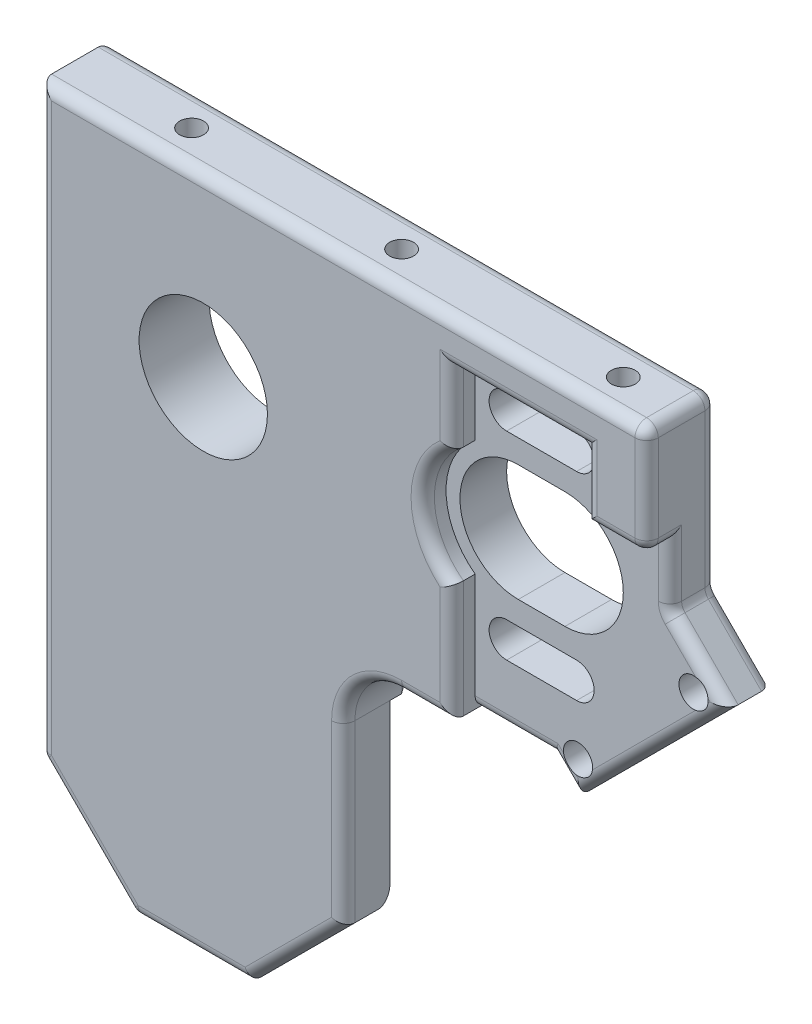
ISO-10303-21;
HEADER;
FILE_DESCRIPTION(('STEP AP214'),'2;1');
FILE_NAME('part.step','',(''),(''),'','','');
FILE_SCHEMA(('AUTOMOTIVE_DESIGN { 1 0 10303 214 1 1 1 1 }'));
ENDSEC;
DATA;
#1=APPLICATION_CONTEXT('core data for automotive mechanical design processes');
#2=APPLICATION_PROTOCOL_DEFINITION('international standard','automotive_design',2000,#1);
#3=PRODUCT_CONTEXT('',#1,'mechanical');
#4=PRODUCT('Part','Part','',(#3));
#5=PRODUCT_RELATED_PRODUCT_CATEGORY('part','',(#4));
#6=PRODUCT_DEFINITION_FORMATION('','',#4);
#7=PRODUCT_DEFINITION_CONTEXT('part definition',#1,'design');
#8=PRODUCT_DEFINITION('design','',#6,#7);
#9=PRODUCT_DEFINITION_SHAPE('','',#8);
#10=(LENGTH_UNIT() NAMED_UNIT(*) SI_UNIT(.MILLI.,.METRE.));
#11=(NAMED_UNIT(*) PLANE_ANGLE_UNIT() SI_UNIT($,.RADIAN.));
#12=(NAMED_UNIT(*) SI_UNIT($,.STERADIAN.) SOLID_ANGLE_UNIT());
#13=UNCERTAINTY_MEASURE_WITH_UNIT(LENGTH_MEASURE(1.E-05),#10,'distance_accuracy_value','');
#14=(GEOMETRIC_REPRESENTATION_CONTEXT(3) GLOBAL_UNCERTAINTY_ASSIGNED_CONTEXT((#13)) GLOBAL_UNIT_ASSIGNED_CONTEXT((#10,
#11,#12)) REPRESENTATION_CONTEXT('',''));
#15=CARTESIAN_POINT('',(0.,0.,0.));
#16=DIRECTION('',(0.,0.,1.));
#17=DIRECTION('',(1.,0.,0.));
#18=AXIS2_PLACEMENT_3D('',#15,#16,#17);
#19=CARTESIAN_POINT('',(0.,0.,0.));
#20=DIRECTION('',(0.,0.,1.));
#21=DIRECTION('',(1.,0.,0.));
#22=AXIS2_PLACEMENT_3D('',#19,#20,#21);
#23=PLANE('',#22);
#24=CARTESIAN_POINT('',(38.,-6.5,0.));
#25=DIRECTION('',(0.,0.,1.));
#26=DIRECTION('',(1.,0.,0.));
#27=AXIS2_PLACEMENT_3D('',#24,#25,#26);
#28=CIRCLE('',#27,1.5);
#29=CARTESIAN_POINT('',(38.,-5.,0.));
#30=VERTEX_POINT('',#29);
#31=CARTESIAN_POINT('',(38.,-8.,0.));
#32=VERTEX_POINT('',#31);
#33=EDGE_CURVE('E618',#30,#32,#28,.T.);
#34=ORIENTED_EDGE('',*,*,#33,.T.);
#35=DIRECTION('',(1.,0.,0.));
#36=VECTOR('',#35,1.);
#37=CARTESIAN_POINT('',(38.,-8.,0.));
#38=LINE('',#37,#36);
#39=CARTESIAN_POINT('',(44.,-8.,0.));
#40=VERTEX_POINT('',#39);
#41=EDGE_CURVE('E620',#32,#40,#38,.T.);
#42=ORIENTED_EDGE('',*,*,#41,.T.);
#43=CARTESIAN_POINT('',(44.,-6.5,0.));
#44=DIRECTION('',(0.,0.,1.));
#45=DIRECTION('',(1.,0.,0.));
#46=AXIS2_PLACEMENT_3D('',#43,#44,#45);
#47=CIRCLE('',#46,1.5);
#48=CARTESIAN_POINT('',(44.,-5.,0.));
#49=VERTEX_POINT('',#48);
#50=EDGE_CURVE('E625',#40,#49,#47,.T.);
#51=ORIENTED_EDGE('',*,*,#50,.T.);
#52=DIRECTION('',(-1.,0.,0.));
#53=VECTOR('',#52,1.);
#54=CARTESIAN_POINT('',(38.,-5.,0.));
#55=LINE('',#54,#53);
#56=EDGE_CURVE('E622',#49,#30,#55,.T.);
#57=ORIENTED_EDGE('',*,*,#56,.T.);
#58=EDGE_LOOP('',(#34,#42,#51,#57));
#59=FACE_BOUND('',#58,.T.);
#60=CARTESIAN_POINT('',(39.,-15.,0.));
#61=DIRECTION('',(0.,0.,1.));
#62=DIRECTION('',(1.,0.,0.));
#63=AXIS2_PLACEMENT_3D('',#60,#61,#62);
#64=CIRCLE('',#63,5.);
#65=CARTESIAN_POINT('',(39.,-10.,0.));
#66=VERTEX_POINT('',#65);
#67=CARTESIAN_POINT('',(39.,-20.,0.));
#68=VERTEX_POINT('',#67);
#69=EDGE_CURVE('E636',#66,#68,#64,.T.);
#70=ORIENTED_EDGE('',*,*,#69,.T.);
#71=DIRECTION('',(1.,0.,0.));
#72=VECTOR('',#71,1.);
#73=CARTESIAN_POINT('',(39.,-20.,0.));
#74=LINE('',#73,#72);
#75=CARTESIAN_POINT('',(43.,-20.,0.));
#76=VERTEX_POINT('',#75);
#77=EDGE_CURVE('E638',#68,#76,#74,.T.);
#78=ORIENTED_EDGE('',*,*,#77,.T.);
#79=CARTESIAN_POINT('',(43.,-15.,0.));
#80=DIRECTION('',(0.,0.,1.));
#81=DIRECTION('',(1.,0.,0.));
#82=AXIS2_PLACEMENT_3D('',#79,#80,#81);
#83=CIRCLE('',#82,5.);
#84=CARTESIAN_POINT('',(43.,-10.,0.));
#85=VERTEX_POINT('',#84);
#86=EDGE_CURVE('E645',#76,#85,#83,.T.);
#87=ORIENTED_EDGE('',*,*,#86,.T.);
#88=DIRECTION('',(-1.,0.,0.));
#89=VECTOR('',#88,1.);
#90=CARTESIAN_POINT('',(39.,-10.,0.));
#91=LINE('',#90,#89);
#92=EDGE_CURVE('E643',#85,#66,#91,.T.);
#93=ORIENTED_EDGE('',*,*,#92,.T.);
#94=EDGE_LOOP('',(#70,#78,#87,#93));
#95=FACE_BOUND('',#94,.T.);
#96=CARTESIAN_POINT('',(38.,-23.5,0.));
#97=DIRECTION('',(0.,0.,1.));
#98=DIRECTION('',(-1.,0.,0.));
#99=AXIS2_PLACEMENT_3D('',#96,#97,#98);
#100=CIRCLE('',#99,1.5);
#101=CARTESIAN_POINT('',(38.,-22.,0.));
#102=VERTEX_POINT('',#101);
#103=CARTESIAN_POINT('',(38.,-25.,0.));
#104=VERTEX_POINT('',#103);
#105=EDGE_CURVE('E597',#102,#104,#100,.T.);
#106=ORIENTED_EDGE('',*,*,#105,.T.);
#107=DIRECTION('',(1.,0.,0.));
#108=VECTOR('',#107,1.);
#109=CARTESIAN_POINT('',(38.,-25.,0.));
#110=LINE('',#109,#108);
#111=CARTESIAN_POINT('',(44.,-25.,0.));
#112=VERTEX_POINT('',#111);
#113=EDGE_CURVE('E599',#104,#112,#110,.T.);
#114=ORIENTED_EDGE('',*,*,#113,.T.);
#115=CARTESIAN_POINT('',(44.,-23.5,0.));
#116=DIRECTION('',(0.,0.,1.));
#117=DIRECTION('',(-1.,0.,0.));
#118=AXIS2_PLACEMENT_3D('',#115,#116,#117);
#119=CIRCLE('',#118,1.5);
#120=CARTESIAN_POINT('',(44.,-22.,0.));
#121=VERTEX_POINT('',#120);
#122=EDGE_CURVE('E605',#112,#121,#119,.T.);
#123=ORIENTED_EDGE('',*,*,#122,.T.);
#124=DIRECTION('',(-1.,0.,0.));
#125=VECTOR('',#124,1.);
#126=CARTESIAN_POINT('',(38.,-22.,0.));
#127=LINE('',#126,#125);
#128=EDGE_CURVE('E604',#121,#102,#127,.T.);
#129=ORIENTED_EDGE('',*,*,#128,.T.);
#130=EDGE_LOOP('',(#106,#114,#123,#129));
#131=FACE_BOUND('',#130,.T.);
#132=CARTESIAN_POINT('',(14.,-15.,0.));
#133=DIRECTION('',(0.,0.,1.));
#134=DIRECTION('',(1.,0.,0.));
#135=AXIS2_PLACEMENT_3D('',#132,#133,#134);
#136=CIRCLE('',#135,5.5);
#137=CARTESIAN_POINT('',(19.5,-15.,0.));
#138=VERTEX_POINT('',#137);
#139=EDGE_CURVE('E585',#138,#138,#136,.T.);
#140=ORIENTED_EDGE('',*,*,#139,.T.);
#141=EDGE_LOOP('',(#140));
#142=FACE_BOUND('',#141,.T.);
#143=CARTESIAN_POINT('',(54.0208152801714,-19.3933982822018,0.));
#144=DIRECTION('',(0.,0.,1.));
#145=DIRECTION('',(1.,0.,0.));
#146=AXIS2_PLACEMENT_3D('',#143,#144,#145);
#147=CIRCLE('',#146,1.24999999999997);
#148=CARTESIAN_POINT('',(54.1975919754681,-18.1559614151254,0.));
#149=VERTEX_POINT('',#148);
#150=CARTESIAN_POINT('',(54.1975919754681,-20.6308351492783,0.));
#151=VERTEX_POINT('',#150);
#152=EDGE_CURVE('E592',#149,#151,#147,.T.);
#153=ORIENTED_EDGE('',*,*,#152,.T.);
#154=DIRECTION('',(0.707106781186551,0.707106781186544,0.));
#155=VECTOR('',#154,1.);
#156=CARTESIAN_POINT('',(37.4142135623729,-37.4142135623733,0.));
#157=LINE('',#156,#155);
#158=CARTESIAN_POINT('',(45.3587572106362,-29.4696699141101,0.));
#159=VERTEX_POINT('',#158);
#160=EDGE_CURVE('E832',#151,#159,#157,.F.);
#161=ORIENTED_EDGE('',*,*,#160,.T.);
#162=CARTESIAN_POINT('',(44.1213203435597,-29.2928932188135,0.));
#163=DIRECTION('',(0.,0.,1.));
#164=DIRECTION('',(1.,0.,0.));
#165=AXIS2_PLACEMENT_3D('',#162,#163,#164);
#166=CIRCLE('',#165,1.25);
#167=CARTESIAN_POINT('',(42.8838834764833,-29.4696699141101,0.));
#168=VERTEX_POINT('',#167);
#169=EDGE_CURVE('E595',#159,#168,#166,.T.);
#170=ORIENTED_EDGE('',*,*,#169,.T.);
#171=DIRECTION('',(0.707106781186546,-0.707106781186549,0.));
#172=VECTOR('',#171,1.);
#173=CARTESIAN_POINT('',(6.70710678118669,6.70710678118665,0.));
#174=LINE('',#173,#172);
#175=CARTESIAN_POINT('',(42.4142135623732,-29.,0.));
#176=VERTEX_POINT('',#175);
#177=EDGE_CURVE('E823',#168,#176,#174,.F.);
#178=ORIENTED_EDGE('',*,*,#177,.T.);
#179=DIRECTION('',(1.,0.,0.));
#180=VECTOR('',#179,1.);
#181=CARTESIAN_POINT('',(0.,-29.,0.));
#182=LINE('',#181,#180);
#183=CARTESIAN_POINT('',(31.0000000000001,-29.,0.));
#184=VERTEX_POINT('',#183);
#185=EDGE_CURVE('E821',#176,#184,#182,.F.);
#186=ORIENTED_EDGE('',*,*,#185,.T.);
#187=CARTESIAN_POINT('',(31.0000000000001,-35.,0.));
#188=DIRECTION('',(0.,0.,1.));
#189=DIRECTION('',(1.,0.,0.));
#190=AXIS2_PLACEMENT_3D('',#187,#188,#189);
#191=CIRCLE('',#190,6.);
#192=CARTESIAN_POINT('',(27.0000000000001,-30.5278640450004,0.));
#193=VERTEX_POINT('',#192);
#194=EDGE_CURVE('E816',#184,#193,#191,.T.);
#195=ORIENTED_EDGE('',*,*,#194,.T.);
#196=DIRECTION('',(0.,1.,0.));
#197=VECTOR('',#196,1.);
#198=CARTESIAN_POINT('',(27.0000000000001,-30.,0.));
#199=LINE('',#198,#197);
#200=CARTESIAN_POINT('',(27.0000000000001,-29.,0.));
#201=VERTEX_POINT('',#200);
#202=EDGE_CURVE('E818',#193,#201,#199,.T.);
#203=ORIENTED_EDGE('',*,*,#202,.T.);
#204=DIRECTION('',(-1.,0.,0.));
#205=VECTOR('',#204,1.);
#206=CARTESIAN_POINT('',(0.,-29.,0.));
#207=LINE('',#206,#205);
#208=CARTESIAN_POINT('',(1.,-29.,0.));
#209=VERTEX_POINT('',#208);
#210=EDGE_CURVE('E815',#201,#209,#207,.T.);
#211=ORIENTED_EDGE('',*,*,#210,.T.);
#212=DIRECTION('',(0.,-1.,0.));
#213=VECTOR('',#212,1.);
#214=CARTESIAN_POINT('',(1.,0.,0.));
#215=LINE('',#214,#213);
#216=CARTESIAN_POINT('',(1.,-1.,0.));
#217=VERTEX_POINT('',#216);
#218=EDGE_CURVE('E812',#209,#217,#215,.F.);
#219=ORIENTED_EDGE('',*,*,#218,.T.);
#220=DIRECTION('',(-1.,0.,0.));
#221=VECTOR('',#220,1.);
#222=CARTESIAN_POINT('',(0.,-1.,0.));
#223=LINE('',#222,#221);
#224=CARTESIAN_POINT('',(51.,-1.,0.));
#225=VERTEX_POINT('',#224);
#226=EDGE_CURVE('E808',#217,#225,#223,.F.);
#227=ORIENTED_EDGE('',*,*,#226,.T.);
#228=DIRECTION('',(0.,1.,0.));
#229=VECTOR('',#228,1.);
#230=CARTESIAN_POINT('',(51.,0.,0.));
#231=LINE('',#230,#229);
#232=CARTESIAN_POINT('',(51.,-14.1299423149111,0.));
#233=VERTEX_POINT('',#232);
#234=EDGE_CURVE('E807',#225,#233,#231,.F.);
#235=ORIENTED_EDGE('',*,*,#234,.T.);
#236=CARTESIAN_POINT('',(53.,-14.1299423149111,0.));
#237=DIRECTION('',(0.,0.,1.));
#238=DIRECTION('',(1.,0.,0.));
#239=AXIS2_PLACEMENT_3D('',#236,#237,#238);
#240=CIRCLE('',#239,2.);
#241=CARTESIAN_POINT('',(51.5857864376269,-15.5441558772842,0.));
#242=VERTEX_POINT('',#241);
#243=EDGE_CURVE('E801',#242,#233,#240,.F.);
#244=ORIENTED_EDGE('',*,*,#243,.F.);
#245=DIRECTION('',(-0.707106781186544,0.707106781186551,0.));
#246=VECTOR('',#245,1.);
#247=CARTESIAN_POINT('',(18.0208152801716,18.0208152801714,0.));
#248=LINE('',#247,#246);
#249=EDGE_CURVE('E806',#242,#149,#248,.F.);
#250=ORIENTED_EDGE('',*,*,#249,.T.);
#251=EDGE_LOOP('',(#153,#161,#170,#178,#186,#195,#203,#211,#219,#227,#235,#244,#250));
#252=FACE_BOUND('',#251,.T.);
#253=ADVANCED_FACE('F50',(#59,#95,#131,#142,#252),#23,.F.);
#254=DIRECTION('',(0.707106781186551,0.707106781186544,0.));
#255=VECTOR('',#254,1.);
#256=CARTESIAN_POINT('',(37.4142135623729,-37.4142135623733,0.));
#257=LINE('',#256,#255);
#258=CARTESIAN_POINT('',(44.2980970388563,-30.5303300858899,0.));
#259=VERTEX_POINT('',#258);
#260=CARTESIAN_POINT('',(44.1213203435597,-30.7071067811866,0.));
#261=VERTEX_POINT('',#260);
#262=EDGE_CURVE('E827',#259,#261,#257,.F.);
#263=ORIENTED_EDGE('',*,*,#262,.T.);
#264=DIRECTION('',(0.707106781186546,-0.707106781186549,0.));
#265=VECTOR('',#264,1.);
#266=CARTESIAN_POINT('',(6.70710678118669,6.70710678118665,0.));
#267=LINE('',#266,#265);
#268=CARTESIAN_POINT('',(43.9445436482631,-30.5303300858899,0.));
#269=VERTEX_POINT('',#268);
#270=EDGE_CURVE('E831',#261,#269,#267,.F.);
#271=ORIENTED_EDGE('',*,*,#270,.T.);
#272=EDGE_CURVE('E591',#269,#259,#166,.T.);
#273=ORIENTED_EDGE('',*,*,#272,.T.);
#274=EDGE_LOOP('',(#263,#271,#273));
#275=FACE_BOUND('',#274,.T.);
#276=ADVANCED_FACE('F1184',(#275),#23,.F.);
#277=CARTESIAN_POINT('',(39.,-15.,4.));
#278=DIRECTION('',(0.,0.,-1.));
#279=DIRECTION('',(-1.,0.,0.));
#280=AXIS2_PLACEMENT_3D('',#277,#278,#279);
#281=PLANE('',#280);
#282=CARTESIAN_POINT('',(39.,-15.,4.));
#283=DIRECTION('',(0.,0.,-1.));
#284=DIRECTION('',(-1.,0.,0.));
#285=AXIS2_PLACEMENT_3D('',#282,#283,#284);
#286=CIRCLE('',#285,5.);
#287=CARTESIAN_POINT('',(39.,-20.,4.));
#288=VERTEX_POINT('',#287);
#289=CARTESIAN_POINT('',(39.,-10.,4.));
#290=VERTEX_POINT('',#289);
#291=EDGE_CURVE('E558',#288,#290,#286,.T.);
#292=ORIENTED_EDGE('',*,*,#291,.T.);
#293=DIRECTION('',(1.,0.,0.));
#294=VECTOR('',#293,1.);
#295=CARTESIAN_POINT('',(39.,-10.,4.));
#296=LINE('',#295,#294);
#297=CARTESIAN_POINT('',(43.,-10.,4.));
#298=VERTEX_POINT('',#297);
#299=EDGE_CURVE('E546',#290,#298,#296,.T.);
#300=ORIENTED_EDGE('',*,*,#299,.T.);
#301=CARTESIAN_POINT('',(43.,-15.,4.));
#302=DIRECTION('',(0.,0.,-1.));
#303=DIRECTION('',(-1.,0.,0.));
#304=AXIS2_PLACEMENT_3D('',#301,#302,#303);
#305=CIRCLE('',#304,5.);
#306=CARTESIAN_POINT('',(43.,-20.,4.));
#307=VERTEX_POINT('',#306);
#308=EDGE_CURVE('E552',#298,#307,#305,.T.);
#309=ORIENTED_EDGE('',*,*,#308,.T.);
#310=DIRECTION('',(-1.,0.,0.));
#311=VECTOR('',#310,1.);
#312=CARTESIAN_POINT('',(39.,-20.,4.));
#313=LINE('',#312,#311);
#314=EDGE_CURVE('E555',#307,#288,#313,.T.);
#315=ORIENTED_EDGE('',*,*,#314,.T.);
#316=EDGE_LOOP('',(#292,#300,#309,#315));
#317=FACE_BOUND('',#316,.T.);
#318=CARTESIAN_POINT('',(38.,-6.5,4.));
#319=DIRECTION('',(0.,0.,-1.));
#320=DIRECTION('',(-1.,0.,0.));
#321=AXIS2_PLACEMENT_3D('',#318,#319,#320);
#322=CIRCLE('',#321,1.5);
#323=CARTESIAN_POINT('',(38.,-8.,4.));
#324=VERTEX_POINT('',#323);
#325=CARTESIAN_POINT('',(38.,-5.,4.));
#326=VERTEX_POINT('',#325);
#327=EDGE_CURVE('E548',#324,#326,#322,.T.);
#328=ORIENTED_EDGE('',*,*,#327,.T.);
#329=DIRECTION('',(1.,0.,0.));
#330=VECTOR('',#329,1.);
#331=CARTESIAN_POINT('',(38.,-5.,4.));
#332=LINE('',#331,#330);
#333=CARTESIAN_POINT('',(44.,-5.,4.));
#334=VERTEX_POINT('',#333);
#335=EDGE_CURVE('E545',#326,#334,#332,.T.);
#336=ORIENTED_EDGE('',*,*,#335,.T.);
#337=CARTESIAN_POINT('',(44.,-6.5,4.));
#338=DIRECTION('',(0.,0.,-1.));
#339=DIRECTION('',(-1.,0.,0.));
#340=AXIS2_PLACEMENT_3D('',#337,#338,#339);
#341=CIRCLE('',#340,1.5);
#342=CARTESIAN_POINT('',(44.,-8.,4.));
#343=VERTEX_POINT('',#342);
#344=EDGE_CURVE('E544',#334,#343,#341,.T.);
#345=ORIENTED_EDGE('',*,*,#344,.T.);
#346=DIRECTION('',(-1.,0.,0.));
#347=VECTOR('',#346,1.);
#348=CARTESIAN_POINT('',(38.,-8.,4.));
#349=LINE('',#348,#347);
#350=EDGE_CURVE('E547',#343,#324,#349,.T.);
#351=ORIENTED_EDGE('',*,*,#350,.T.);
#352=EDGE_LOOP('',(#328,#336,#345,#351));
#353=FACE_BOUND('',#352,.T.);
#354=CARTESIAN_POINT('',(38.,-23.5,4.));
#355=DIRECTION('',(0.,0.,-1.));
#356=DIRECTION('',(-1.,0.,0.));
#357=AXIS2_PLACEMENT_3D('',#354,#355,#356);
#358=CIRCLE('',#357,1.5);
#359=CARTESIAN_POINT('',(38.,-25.,4.));
#360=VERTEX_POINT('',#359);
#361=CARTESIAN_POINT('',(38.,-22.,4.));
#362=VERTEX_POINT('',#361);
#363=EDGE_CURVE('E539',#360,#362,#358,.T.);
#364=ORIENTED_EDGE('',*,*,#363,.T.);
#365=DIRECTION('',(1.,0.,0.));
#366=VECTOR('',#365,1.);
#367=CARTESIAN_POINT('',(38.,-22.,4.));
#368=LINE('',#367,#366);
#369=CARTESIAN_POINT('',(44.,-22.,4.));
#370=VERTEX_POINT('',#369);
#371=EDGE_CURVE('E534',#362,#370,#368,.T.);
#372=ORIENTED_EDGE('',*,*,#371,.T.);
#373=CARTESIAN_POINT('',(44.,-23.5,4.));
#374=DIRECTION('',(0.,0.,-1.));
#375=DIRECTION('',(-1.,0.,0.));
#376=AXIS2_PLACEMENT_3D('',#373,#374,#375);
#377=CIRCLE('',#376,1.5);
#378=CARTESIAN_POINT('',(44.,-25.,4.));
#379=VERTEX_POINT('',#378);
#380=EDGE_CURVE('E536',#370,#379,#377,.T.);
#381=ORIENTED_EDGE('',*,*,#380,.T.);
#382=DIRECTION('',(-1.,0.,0.));
#383=VECTOR('',#382,1.);
#384=CARTESIAN_POINT('',(38.,-25.,4.));
#385=LINE('',#384,#383);
#386=EDGE_CURVE('E537',#379,#360,#385,.T.);
#387=ORIENTED_EDGE('',*,*,#386,.T.);
#388=EDGE_LOOP('',(#364,#372,#381,#387));
#389=FACE_BOUND('',#388,.T.);
#390=CARTESIAN_POINT('',(54.0208152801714,-19.3933982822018,4.));
#391=DIRECTION('',(0.,0.,-1.));
#392=DIRECTION('',(-1.,0.,0.));
#393=AXIS2_PLACEMENT_3D('',#390,#391,#392);
#394=CIRCLE('',#393,1.24999999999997);
#395=CARTESIAN_POINT('',(54.1975919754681,-20.6308351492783,4.));
#396=VERTEX_POINT('',#395);
#397=CARTESIAN_POINT('',(54.1975919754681,-18.1559614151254,4.));
#398=VERTEX_POINT('',#397);
#399=EDGE_CURVE('E528',#396,#398,#394,.T.);
#400=ORIENTED_EDGE('',*,*,#399,.T.);
#401=DIRECTION('',(0.707106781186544,-0.707106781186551,0.));
#402=VECTOR('',#401,1.);
#403=CARTESIAN_POINT('',(45.0208152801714,-8.97918471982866,4.));
#404=LINE('',#403,#402);
#405=CARTESIAN_POINT('',(51.5857864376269,-15.5441558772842,4.));
#406=VERTEX_POINT('',#405);
#407=EDGE_CURVE('E710',#398,#406,#404,.F.);
#408=ORIENTED_EDGE('',*,*,#407,.T.);
#409=CARTESIAN_POINT('',(53.,-14.1299423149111,4.));
#410=DIRECTION('',(0.,0.,-1.));
#411=DIRECTION('',(-1.,0.,0.));
#412=AXIS2_PLACEMENT_3D('',#409,#410,#411);
#413=CIRCLE('',#412,2.);
#414=CARTESIAN_POINT('',(51.,-14.1299423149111,4.));
#415=VERTEX_POINT('',#414);
#416=EDGE_CURVE('E703',#415,#406,#413,.F.);
#417=ORIENTED_EDGE('',*,*,#416,.F.);
#418=DIRECTION('',(0.,-1.,0.));
#419=VECTOR('',#418,1.);
#420=CARTESIAN_POINT('',(51.,-15.,4.));
#421=LINE('',#420,#419);
#422=CARTESIAN_POINT('',(51.,-9.44276941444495,4.));
#423=VERTEX_POINT('',#422);
#424=EDGE_CURVE('E705',#415,#423,#421,.F.);
#425=ORIENTED_EDGE('',*,*,#424,.T.);
#426=DIRECTION('',(1.,0.,0.));
#427=VECTOR('',#426,1.);
#428=CARTESIAN_POINT('',(52.,-9.44276941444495,4.));
#429=LINE('',#428,#427);
#430=CARTESIAN_POINT('',(46.7381966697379,-9.44276941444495,4.));
#431=VERTEX_POINT('',#430);
#432=EDGE_CURVE('E501',#431,#423,#429,.T.);
#433=ORIENTED_EDGE('',*,*,#432,.F.);
#434=DIRECTION('',(0.,-1.,0.));
#435=VECTOR('',#434,1.);
#436=CARTESIAN_POINT('',(46.7381966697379,-9.44276941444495,4.));
#437=LINE('',#436,#435);
#438=CARTESIAN_POINT('',(46.7381966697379,-3.77327314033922,4.));
#439=VERTEX_POINT('',#438);
#440=EDGE_CURVE('E497',#439,#431,#437,.T.);
#441=ORIENTED_EDGE('',*,*,#440,.F.);
#442=DIRECTION('',(1.,0.,0.));
#443=VECTOR('',#442,1.);
#444=CARTESIAN_POINT('',(46.7381966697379,-3.77327314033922,4.));
#445=LINE('',#444,#443);
#446=CARTESIAN_POINT('',(35.2997392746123,-3.77327314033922,4.));
#447=VERTEX_POINT('',#446);
#448=EDGE_CURVE('E486',#447,#439,#445,.T.);
#449=ORIENTED_EDGE('',*,*,#448,.F.);
#450=DIRECTION('',(0.,1.,0.));
#451=VECTOR('',#450,1.);
#452=CARTESIAN_POINT('',(35.2997392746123,-3.77327314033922,4.));
#453=LINE('',#452,#451);
#454=CARTESIAN_POINT('',(35.2997392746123,-10.0362202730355,4.));
#455=VERTEX_POINT('',#454);
#456=EDGE_CURVE('E507',#455,#447,#453,.T.);
#457=ORIENTED_EDGE('',*,*,#456,.F.);
#458=CARTESIAN_POINT('',(39.,-15.,4.));
#459=DIRECTION('',(0.,0.,-1.));
#460=DIRECTION('',(-1.,0.,0.));
#461=AXIS2_PLACEMENT_3D('',#458,#459,#460);
#462=CIRCLE('',#461,6.19120655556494);
#463=CARTESIAN_POINT('',(35.2997392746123,-19.9637797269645,4.));
#464=VERTEX_POINT('',#463);
#465=EDGE_CURVE('E506',#464,#455,#462,.T.);
#466=ORIENTED_EDGE('',*,*,#465,.F.);
#467=DIRECTION('',(0.,1.,0.));
#468=VECTOR('',#467,1.);
#469=CARTESIAN_POINT('',(35.2997392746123,-19.9637797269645,4.));
#470=LINE('',#469,#468);
#471=CARTESIAN_POINT('',(35.2997392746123,-29.,4.));
#472=VERTEX_POINT('',#471);
#473=EDGE_CURVE('E502',#472,#464,#470,.T.);
#474=ORIENTED_EDGE('',*,*,#473,.F.);
#475=DIRECTION('',(-1.,0.,0.));
#476=VECTOR('',#475,1.);
#477=CARTESIAN_POINT('',(39.,-29.,4.));
#478=LINE('',#477,#476);
#479=CARTESIAN_POINT('',(42.4142135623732,-29.,4.));
#480=VERTEX_POINT('',#479);
#481=EDGE_CURVE('E698',#472,#480,#478,.F.);
#482=ORIENTED_EDGE('',*,*,#481,.T.);
#483=DIRECTION('',(-0.707106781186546,0.707106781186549,0.));
#484=VECTOR('',#483,1.);
#485=CARTESIAN_POINT('',(33.7071067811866,-20.2928932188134,4.));
#486=LINE('',#485,#484);
#487=CARTESIAN_POINT('',(42.8838834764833,-29.4696699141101,4.));
#488=VERTEX_POINT('',#487);
#489=EDGE_CURVE('E699',#480,#488,#486,.F.);
#490=ORIENTED_EDGE('',*,*,#489,.T.);
#491=CARTESIAN_POINT('',(44.1213203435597,-29.2928932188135,4.));
#492=DIRECTION('',(0.,0.,-1.));
#493=DIRECTION('',(-1.,0.,0.));
#494=AXIS2_PLACEMENT_3D('',#491,#492,#493);
#495=CIRCLE('',#494,1.25);
#496=CARTESIAN_POINT('',(45.3587572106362,-29.4696699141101,4.));
#497=VERTEX_POINT('',#496);
#498=EDGE_CURVE('E529',#488,#497,#495,.T.);
#499=ORIENTED_EDGE('',*,*,#498,.T.);
#500=DIRECTION('',(-0.707106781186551,-0.707106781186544,0.));
#501=VECTOR('',#500,1.);
#502=CARTESIAN_POINT('',(49.4142135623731,-25.4142135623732,4.));
#503=LINE('',#502,#501);
#504=EDGE_CURVE('E695',#497,#396,#503,.F.);
#505=ORIENTED_EDGE('',*,*,#504,.T.);
#506=EDGE_LOOP('',(#400,#408,#417,#425,#433,#441,#449,#457,#466,#474,#482,#490,#499,#505));
#507=FACE_BOUND('',#506,.T.);
#508=ADVANCED_FACE('F1195',(#317,#353,#389,#507),#281,.F.);
#509=CARTESIAN_POINT('',(44.2980970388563,-30.5303300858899,4.));
#510=VERTEX_POINT('',#509);
#511=CARTESIAN_POINT('',(43.9445436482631,-30.5303300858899,4.));
#512=VERTEX_POINT('',#511);
#513=EDGE_CURVE('E535',#510,#512,#495,.T.);
#514=ORIENTED_EDGE('',*,*,#513,.T.);
#515=DIRECTION('',(-0.707106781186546,0.707106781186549,0.));
#516=VECTOR('',#515,1.);
#517=CARTESIAN_POINT('',(33.7071067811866,-20.2928932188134,4.));
#518=LINE('',#517,#516);
#519=CARTESIAN_POINT('',(44.1213203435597,-30.7071067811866,4.));
#520=VERTEX_POINT('',#519);
#521=EDGE_CURVE('E696',#512,#520,#518,.F.);
#522=ORIENTED_EDGE('',*,*,#521,.T.);
#523=DIRECTION('',(-0.707106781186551,-0.707106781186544,0.));
#524=VECTOR('',#523,1.);
#525=CARTESIAN_POINT('',(49.4142135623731,-25.4142135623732,4.));
#526=LINE('',#525,#524);
#527=EDGE_CURVE('E692',#520,#510,#526,.F.);
#528=ORIENTED_EDGE('',*,*,#527,.T.);
#529=EDGE_LOOP('',(#514,#522,#528));
#530=FACE_BOUND('',#529,.T.);
#531=ADVANCED_FACE('F1562',(#530),#281,.F.);
#532=CARTESIAN_POINT('',(0.,0.,6.));
#533=DIRECTION('',(0.,0.,1.));
#534=DIRECTION('',(1.,0.,0.));
#535=AXIS2_PLACEMENT_3D('',#532,#533,#534);
#536=PLANE('',#535);
#537=DIRECTION('',(1.,0.,0.));
#538=VECTOR('',#537,1.);
#539=CARTESIAN_POINT('',(0.,-8.44276941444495,6.));
#540=LINE('',#539,#538);
#541=CARTESIAN_POINT('',(47.7381966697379,-8.44276941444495,6.));
#542=VERTEX_POINT('',#541);
#543=CARTESIAN_POINT('',(51.,-8.44276941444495,6.));
#544=VERTEX_POINT('',#543);
#545=EDGE_CURVE('E925',#542,#544,#540,.T.);
#546=ORIENTED_EDGE('',*,*,#545,.T.);
#547=DIRECTION('',(0.,1.,0.));
#548=VECTOR('',#547,1.);
#549=CARTESIAN_POINT('',(51.,0.,6.));
#550=LINE('',#549,#548);
#551=CARTESIAN_POINT('',(51.,-1.,6.));
#552=VERTEX_POINT('',#551);
#553=EDGE_CURVE('E926',#544,#552,#550,.T.);
#554=ORIENTED_EDGE('',*,*,#553,.T.);
#555=DIRECTION('',(-1.,0.,0.));
#556=VECTOR('',#555,1.);
#557=CARTESIAN_POINT('',(0.,-1.,6.));
#558=LINE('',#557,#556);
#559=CARTESIAN_POINT('',(1.,-1.,6.));
#560=VERTEX_POINT('',#559);
#561=EDGE_CURVE('E924',#552,#560,#558,.T.);
#562=ORIENTED_EDGE('',*,*,#561,.T.);
#563=DIRECTION('',(0.,-1.,0.));
#564=VECTOR('',#563,1.);
#565=CARTESIAN_POINT('',(1.00000000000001,-50.,6.));
#566=LINE('',#565,#564);
#567=CARTESIAN_POINT('',(1.00000000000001,-49.5857864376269,6.));
#568=VERTEX_POINT('',#567);
#569=EDGE_CURVE('E898',#560,#568,#566,.T.);
#570=ORIENTED_EDGE('',*,*,#569,.T.);
#571=DIRECTION('',(0.707106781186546,-0.707106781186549,0.));
#572=VECTOR('',#571,1.);
#573=CARTESIAN_POINT('',(8.70710678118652,-57.2928932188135,6.));
#574=LINE('',#573,#572);
#575=CARTESIAN_POINT('',(8.41421356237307,-57.,6.));
#576=VERTEX_POINT('',#575);
#577=EDGE_CURVE('E900',#568,#576,#574,.T.);
#578=ORIENTED_EDGE('',*,*,#577,.T.);
#579=DIRECTION('',(1.,0.,0.));
#580=VECTOR('',#579,1.);
#581=CARTESIAN_POINT('',(18.,-57.,6.));
#582=LINE('',#581,#580);
#583=CARTESIAN_POINT('',(17.5857864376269,-57.,6.));
#584=VERTEX_POINT('',#583);
#585=EDGE_CURVE('E902',#576,#584,#582,.T.);
#586=ORIENTED_EDGE('',*,*,#585,.T.);
#587=DIRECTION('',(0.707106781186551,0.707106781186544,0.));
#588=VECTOR('',#587,1.);
#589=CARTESIAN_POINT('',(25.2928932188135,-49.2928932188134,6.));
#590=LINE('',#589,#588);
#591=CARTESIAN_POINT('',(25.0000000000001,-49.5857864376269,6.));
#592=VERTEX_POINT('',#591);
#593=EDGE_CURVE('E904',#584,#592,#590,.T.);
#594=ORIENTED_EDGE('',*,*,#593,.T.);
#595=DIRECTION('',(0.,1.,0.));
#596=VECTOR('',#595,1.);
#597=CARTESIAN_POINT('',(25.0000000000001,-35.,6.));
#598=LINE('',#597,#596);
#599=CARTESIAN_POINT('',(25.0000000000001,-35.,6.));
#600=VERTEX_POINT('',#599);
#601=EDGE_CURVE('E903',#592,#600,#598,.T.);
#602=ORIENTED_EDGE('',*,*,#601,.T.);
#603=CARTESIAN_POINT('',(31.0000000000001,-35.,6.));
#604=DIRECTION('',(0.,0.,1.));
#605=DIRECTION('',(1.,0.,0.));
#606=AXIS2_PLACEMENT_3D('',#603,#604,#605);
#607=CIRCLE('',#606,6.);
#608=CARTESIAN_POINT('',(31.0000000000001,-29.,6.));
#609=VERTEX_POINT('',#608);
#610=EDGE_CURVE('E910',#600,#609,#607,.F.);
#611=ORIENTED_EDGE('',*,*,#610,.T.);
#612=DIRECTION('',(1.,0.,0.));
#613=VECTOR('',#612,1.);
#614=CARTESIAN_POINT('',(35.2997392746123,-29.,6.));
#615=LINE('',#614,#613);
#616=CARTESIAN_POINT('',(34.2997392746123,-29.,6.));
#617=VERTEX_POINT('',#616);
#618=EDGE_CURVE('E909',#609,#617,#615,.T.);
#619=ORIENTED_EDGE('',*,*,#618,.T.);
#620=DIRECTION('',(0.,1.,0.));
#621=VECTOR('',#620,1.);
#622=CARTESIAN_POINT('',(34.2997392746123,0.,6.));
#623=LINE('',#622,#621);
#624=CARTESIAN_POINT('',(34.2997392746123,-20.4425178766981,6.));
#625=VERTEX_POINT('',#624);
#626=EDGE_CURVE('E915',#617,#625,#623,.T.);
#627=ORIENTED_EDGE('',*,*,#626,.T.);
#628=CARTESIAN_POINT('',(39.,-15.,6.));
#629=DIRECTION('',(0.,0.,1.));
#630=DIRECTION('',(1.,0.,0.));
#631=AXIS2_PLACEMENT_3D('',#628,#629,#630);
#632=CIRCLE('',#631,7.19120655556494);
#633=CARTESIAN_POINT('',(34.2997392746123,-9.55748212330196,6.));
#634=VERTEX_POINT('',#633);
#635=EDGE_CURVE('E914',#625,#634,#632,.F.);
#636=ORIENTED_EDGE('',*,*,#635,.T.);
#637=DIRECTION('',(0.,1.,0.));
#638=VECTOR('',#637,1.);
#639=CARTESIAN_POINT('',(34.2997392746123,0.,6.));
#640=LINE('',#639,#638);
#641=CARTESIAN_POINT('',(34.2997392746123,-2.77327314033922,6.));
#642=VERTEX_POINT('',#641);
#643=EDGE_CURVE('E917',#634,#642,#640,.T.);
#644=ORIENTED_EDGE('',*,*,#643,.T.);
#645=DIRECTION('',(1.,0.,0.));
#646=VECTOR('',#645,1.);
#647=CARTESIAN_POINT('',(0.,-2.77327314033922,6.));
#648=LINE('',#647,#646);
#649=CARTESIAN_POINT('',(47.7381966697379,-2.77327314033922,6.));
#650=VERTEX_POINT('',#649);
#651=EDGE_CURVE('E918',#642,#650,#648,.T.);
#652=ORIENTED_EDGE('',*,*,#651,.T.);
#653=DIRECTION('',(0.,-1.,0.));
#654=VECTOR('',#653,1.);
#655=CARTESIAN_POINT('',(47.7381966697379,0.,6.));
#656=LINE('',#655,#654);
#657=EDGE_CURVE('E916',#650,#542,#656,.T.);
#658=ORIENTED_EDGE('',*,*,#657,.T.);
#659=EDGE_LOOP('',(#546,#554,#562,#570,#578,#586,#594,#602,#611,#619,#627,#636,#644,#652,#658));
#660=FACE_BOUND('',#659,.T.);
#661=CARTESIAN_POINT('',(14.,-15.,6.));
#662=DIRECTION('',(0.,0.,1.));
#663=DIRECTION('',(1.,0.,0.));
#664=AXIS2_PLACEMENT_3D('',#661,#662,#663);
#665=CIRCLE('',#664,5.5);
#666=CARTESIAN_POINT('',(19.5,-15.,6.));
#667=VERTEX_POINT('',#666);
#668=EDGE_CURVE('E582',#667,#667,#665,.T.);
#669=ORIENTED_EDGE('',*,*,#668,.F.);
#670=EDGE_LOOP('',(#669));
#671=FACE_BOUND('',#670,.T.);
#672=ADVANCED_FACE('F1206',(#660,#671),#536,.T.);
#673=CARTESIAN_POINT('',(52.,-14.5441558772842,6.));
#674=DIRECTION('',(-1.,0.,0.));
#675=DIRECTION('',(0.,-1.,0.));
#676=AXIS2_PLACEMENT_3D('',#673,#674,#675);
#677=PLANE('',#676);
#678=DIRECTION('',(0.,0.,-1.));
#679=VECTOR('',#678,1.);
#680=CARTESIAN_POINT('',(52.,-0.999999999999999,6.));
#681=LINE('',#680,#679);
#682=CARTESIAN_POINT('',(52.,-1.,1.));
#683=VERTEX_POINT('',#682);
#684=CARTESIAN_POINT('',(52.,-1.,5.));
#685=VERTEX_POINT('',#684);
#686=EDGE_CURVE('E963',#683,#685,#681,.F.);
#687=ORIENTED_EDGE('',*,*,#686,.T.);
#688=DIRECTION('',(0.,1.,0.));
#689=VECTOR('',#688,1.);
#690=CARTESIAN_POINT('',(52.,-9.44276941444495,5.));
#691=LINE('',#690,#689);
#692=CARTESIAN_POINT('',(52.,-8.44276941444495,5.));
#693=VERTEX_POINT('',#692);
#694=EDGE_CURVE('E967',#685,#693,#691,.F.);
#695=ORIENTED_EDGE('',*,*,#694,.T.);
#696=DIRECTION('',(0.,0.,1.));
#697=VECTOR('',#696,1.);
#698=CARTESIAN_POINT('',(52.,-8.44276941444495,4.));
#699=LINE('',#698,#697);
#700=CARTESIAN_POINT('',(52.,-8.44276941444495,3.));
#701=VERTEX_POINT('',#700);
#702=EDGE_CURVE('E956',#693,#701,#699,.F.);
#703=ORIENTED_EDGE('',*,*,#702,.T.);
#704=DIRECTION('',(0.,-1.,0.));
#705=VECTOR('',#704,1.);
#706=CARTESIAN_POINT('',(52.,-14.5441558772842,3.));
#707=LINE('',#706,#705);
#708=CARTESIAN_POINT('',(52.,-14.1299423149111,3.));
#709=VERTEX_POINT('',#708);
#710=EDGE_CURVE('E958',#701,#709,#707,.T.);
#711=ORIENTED_EDGE('',*,*,#710,.T.);
#712=DIRECTION('',(0.,0.,-1.));
#713=VECTOR('',#712,1.);
#714=CARTESIAN_POINT('',(52.,-14.1299423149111,0.));
#715=LINE('',#714,#713);
#716=CARTESIAN_POINT('',(52.,-14.1299423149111,1.));
#717=VERTEX_POINT('',#716);
#718=EDGE_CURVE('E959',#709,#717,#715,.T.);
#719=ORIENTED_EDGE('',*,*,#718,.T.);
#720=DIRECTION('',(0.,1.,0.));
#721=VECTOR('',#720,1.);
#722=CARTESIAN_POINT('',(52.,-14.5441558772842,1.));
#723=LINE('',#722,#721);
#724=EDGE_CURVE('E965',#717,#683,#723,.T.);
#725=ORIENTED_EDGE('',*,*,#724,.T.);
#726=EDGE_LOOP('',(#687,#695,#703,#711,#719,#725));
#727=FACE_BOUND('',#726,.T.);
#728=ADVANCED_FACE('F1199',(#727),#677,.F.);
#729=DIRECTION('',(-0.707106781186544,0.707106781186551,0.));
#730=VECTOR('',#729,1.);
#731=CARTESIAN_POINT('',(18.0208152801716,18.0208152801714,0.));
#732=LINE('',#731,#730);
#733=CARTESIAN_POINT('',(55.2582521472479,-19.2166215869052,0.));
#734=VERTEX_POINT('',#733);
#735=CARTESIAN_POINT('',(55.4350288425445,-19.3933982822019,0.));
#736=VERTEX_POINT('',#735);
#737=EDGE_CURVE('E824',#734,#736,#732,.F.);
#738=ORIENTED_EDGE('',*,*,#737,.T.);
#739=DIRECTION('',(0.707106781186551,0.707106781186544,0.));
#740=VECTOR('',#739,1.);
#741=CARTESIAN_POINT('',(37.4142135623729,-37.4142135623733,0.));
#742=LINE('',#741,#740);
#743=CARTESIAN_POINT('',(55.2582521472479,-19.5701749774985,0.));
#744=VERTEX_POINT('',#743);
#745=EDGE_CURVE('E830',#736,#744,#742,.F.);
#746=ORIENTED_EDGE('',*,*,#745,.T.);
#747=EDGE_CURVE('E588',#744,#734,#147,.T.);
#748=ORIENTED_EDGE('',*,*,#747,.T.);
#749=EDGE_LOOP('',(#738,#746,#748));
#750=FACE_BOUND('',#749,.T.);
#751=ADVANCED_FACE('F1190',(#750),#23,.F.);
#752=CARTESIAN_POINT('',(52.,0.,6.));
#753=DIRECTION('',(0.,-1.,0.));
#754=DIRECTION('',(0.,0.,-1.));
#755=AXIS2_PLACEMENT_3D('',#752,#753,#754);
#756=PLANE('',#755);
#757=CARTESIAN_POINT('',(10.,0.,3.));
#758=DIRECTION('',(0.,1.,0.));
#759=DIRECTION('',(0.,0.,1.));
#760=AXIS2_PLACEMENT_3D('',#757,#758,#759);
#761=CIRCLE('',#760,1.02499999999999);
#762=CARTESIAN_POINT('',(10.,0.,4.02499999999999));
#763=VERTEX_POINT('',#762);
#764=EDGE_CURVE('E562',#763,#763,#761,.T.);
#765=ORIENTED_EDGE('',*,*,#764,.F.);
#766=EDGE_LOOP('',(#765));
#767=FACE_BOUND('',#766,.T.);
#768=CARTESIAN_POINT('',(28.,0.,3.));
#769=DIRECTION('',(0.,1.,0.));
#770=DIRECTION('',(0.,0.,1.));
#771=AXIS2_PLACEMENT_3D('',#768,#769,#770);
#772=CIRCLE('',#771,1.02499999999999);
#773=CARTESIAN_POINT('',(28.,0.,4.02499999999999));
#774=VERTEX_POINT('',#773);
#775=EDGE_CURVE('E569',#774,#774,#772,.T.);
#776=ORIENTED_EDGE('',*,*,#775,.F.);
#777=EDGE_LOOP('',(#776));
#778=FACE_BOUND('',#777,.T.);
#779=CARTESIAN_POINT('',(47.,0.,3.));
#780=DIRECTION('',(0.,1.,0.));
#781=DIRECTION('',(0.,0.,1.));
#782=AXIS2_PLACEMENT_3D('',#779,#780,#781);
#783=CIRCLE('',#782,1.02499999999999);
#784=CARTESIAN_POINT('',(47.,0.,4.02499999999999));
#785=VERTEX_POINT('',#784);
#786=EDGE_CURVE('E577',#785,#785,#783,.T.);
#787=ORIENTED_EDGE('',*,*,#786,.F.);
#788=EDGE_LOOP('',(#787));
#789=FACE_BOUND('',#788,.T.);
#790=DIRECTION('',(0.,0.,-1.));
#791=VECTOR('',#790,1.);
#792=CARTESIAN_POINT('',(51.,0.,6.));
#793=LINE('',#792,#791);
#794=CARTESIAN_POINT('',(51.,0.,5.));
#795=VERTEX_POINT('',#794);
#796=CARTESIAN_POINT('',(51.,0.,1.));
#797=VERTEX_POINT('',#796);
#798=EDGE_CURVE('E876',#795,#797,#793,.T.);
#799=ORIENTED_EDGE('',*,*,#798,.T.);
#800=DIRECTION('',(-1.,0.,0.));
#801=VECTOR('',#800,1.);
#802=CARTESIAN_POINT('',(52.,0.,1.));
#803=LINE('',#802,#801);
#804=CARTESIAN_POINT('',(0.,0.,1.));
#805=VERTEX_POINT('',#804);
#806=EDGE_CURVE('E884',#797,#805,#803,.T.);
#807=ORIENTED_EDGE('',*,*,#806,.T.);
#808=DIRECTION('',(0.,0.,-1.));
#809=VECTOR('',#808,1.);
#810=CARTESIAN_POINT('',(0.,0.,6.));
#811=LINE('',#810,#809);
#812=CARTESIAN_POINT('',(0.,0.,5.));
#813=VERTEX_POINT('',#812);
#814=EDGE_CURVE('E673',#813,#805,#811,.T.);
#815=ORIENTED_EDGE('',*,*,#814,.F.);
#816=DIRECTION('',(-1.,0.,0.));
#817=VECTOR('',#816,1.);
#818=CARTESIAN_POINT('',(52.,0.,5.));
#819=LINE('',#818,#817);
#820=EDGE_CURVE('E879',#813,#795,#819,.F.);
#821=ORIENTED_EDGE('',*,*,#820,.T.);
#822=EDGE_LOOP('',(#799,#807,#815,#821));
#823=FACE_BOUND('',#822,.T.);
#824=ADVANCED_FACE('F1198',(#767,#778,#789,#823),#756,.F.);
#825=CARTESIAN_POINT('',(0.,0.,6.));
#826=DIRECTION('',(1.,0.,0.));
#827=DIRECTION('',(0.,1.,0.));
#828=AXIS2_PLACEMENT_3D('',#825,#826,#827);
#829=PLANE('',#828);
#830=CARTESIAN_POINT('',(0.,-20.,3.));
#831=DIRECTION('',(-1.,0.,0.));
#832=DIRECTION('',(0.,0.,1.));
#833=AXIS2_PLACEMENT_3D('',#830,#831,#832);
#834=CIRCLE('',#833,1.02499999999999);
#835=CARTESIAN_POINT('',(0.,-20.,4.02499999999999));
#836=VERTEX_POINT('',#835);
#837=EDGE_CURVE('E556',#836,#836,#834,.T.);
#838=ORIENTED_EDGE('',*,*,#837,.F.);
#839=EDGE_LOOP('',(#838));
#840=FACE_BOUND('',#839,.T.);
#841=ORIENTED_EDGE('',*,*,#814,.T.);
#842=DIRECTION('',(0.,-1.,0.));
#843=VECTOR('',#842,1.);
#844=CARTESIAN_POINT('',(0.,0.,1.));
#845=LINE('',#844,#843);
#846=CARTESIAN_POINT('',(0.,-30.,1.));
#847=VERTEX_POINT('',#846);
#848=EDGE_CURVE('E895',#805,#847,#845,.T.);
#849=ORIENTED_EDGE('',*,*,#848,.T.);
#850=DIRECTION('',(0.,0.,-1.));
#851=VECTOR('',#850,1.);
#852=CARTESIAN_POINT('',(0.,-30.,2.));
#853=LINE('',#852,#851);
#854=CARTESIAN_POINT('',(0.,-30.,3.));
#855=VERTEX_POINT('',#854);
#856=EDGE_CURVE('E490',#855,#847,#853,.T.);
#857=ORIENTED_EDGE('',*,*,#856,.F.);
#858=DIRECTION('',(0.,-1.,0.));
#859=VECTOR('',#858,1.);
#860=CARTESIAN_POINT('',(0.,-50.,3.));
#861=LINE('',#860,#859);
#862=CARTESIAN_POINT('',(0.,-49.5857864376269,3.));
#863=VERTEX_POINT('',#862);
#864=EDGE_CURVE('E886',#855,#863,#861,.T.);
#865=ORIENTED_EDGE('',*,*,#864,.T.);
#866=DIRECTION('',(0.,0.,-1.));
#867=VECTOR('',#866,1.);
#868=CARTESIAN_POINT('',(0.,-49.5857864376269,6.));
#869=LINE('',#868,#867);
#870=CARTESIAN_POINT('',(0.,-49.5857864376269,5.));
#871=VERTEX_POINT('',#870);
#872=EDGE_CURVE('E888',#863,#871,#869,.F.);
#873=ORIENTED_EDGE('',*,*,#872,.T.);
#874=DIRECTION('',(0.,-1.,0.));
#875=VECTOR('',#874,1.);
#876=CARTESIAN_POINT('',(0.,0.,5.));
#877=LINE('',#876,#875);
#878=EDGE_CURVE('E889',#871,#813,#877,.F.);
#879=ORIENTED_EDGE('',*,*,#878,.T.);
#880=EDGE_LOOP('',(#841,#849,#857,#865,#873,#879));
#881=FACE_BOUND('',#880,.T.);
#882=ADVANCED_FACE('F1204',(#840,#881),#829,.F.);
#883=CARTESIAN_POINT('',(0.,-50.,6.));
#884=DIRECTION('',(0.707106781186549,0.707106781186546,0.));
#885=DIRECTION('',(-0.707106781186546,0.707106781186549,0.));
#886=AXIS2_PLACEMENT_3D('',#883,#884,#885);
#887=PLANE('',#886);
#888=DIRECTION('',(0.,0.,-1.));
#889=VECTOR('',#888,1.);
#890=CARTESIAN_POINT('',(7.70710678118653,-57.7071067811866,6.));
#891=LINE('',#890,#889);
#892=CARTESIAN_POINT('',(7.70710678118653,-57.7071067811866,3.));
#893=VERTEX_POINT('',#892);
#894=CARTESIAN_POINT('',(7.70710678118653,-57.7071067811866,5.));
#895=VERTEX_POINT('',#894);
#896=EDGE_CURVE('E972',#893,#895,#891,.F.);
#897=ORIENTED_EDGE('',*,*,#896,.T.);
#898=DIRECTION('',(0.707106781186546,-0.707106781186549,0.));
#899=VECTOR('',#898,1.);
#900=CARTESIAN_POINT('',(0.,-50.,5.));
#901=LINE('',#900,#899);
#902=CARTESIAN_POINT('',(0.292893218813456,-50.2928932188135,5.));
#903=VERTEX_POINT('',#902);
#904=EDGE_CURVE('E974',#895,#903,#901,.F.);
#905=ORIENTED_EDGE('',*,*,#904,.T.);
#906=DIRECTION('',(0.,0.,-1.));
#907=VECTOR('',#906,1.);
#908=CARTESIAN_POINT('',(0.292893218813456,-50.2928932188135,6.));
#909=LINE('',#908,#907);
#910=CARTESIAN_POINT('',(0.292893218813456,-50.2928932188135,3.));
#911=VERTEX_POINT('',#910);
#912=EDGE_CURVE('E966',#903,#911,#909,.T.);
#913=ORIENTED_EDGE('',*,*,#912,.T.);
#914=DIRECTION('',(0.707106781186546,-0.707106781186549,0.));
#915=VECTOR('',#914,1.);
#916=CARTESIAN_POINT('',(7.99999999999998,-58.,3.));
#917=LINE('',#916,#915);
#918=EDGE_CURVE('E971',#911,#893,#917,.T.);
#919=ORIENTED_EDGE('',*,*,#918,.T.);
#920=EDGE_LOOP('',(#897,#905,#913,#919));
#921=FACE_BOUND('',#920,.T.);
#922=ADVANCED_FACE('F1497',(#921),#887,.F.);
#923=CARTESIAN_POINT('',(7.99999999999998,-58.,6.));
#924=DIRECTION('',(0.,1.,0.));
#925=DIRECTION('',(-1.,0.,0.));
#926=AXIS2_PLACEMENT_3D('',#923,#924,#925);
#927=PLANE('',#926);
#928=DIRECTION('',(0.,0.,-1.));
#929=VECTOR('',#928,1.);
#930=CARTESIAN_POINT('',(18.,-58.,6.));
#931=LINE('',#930,#929);
#932=CARTESIAN_POINT('',(18.,-58.,5.));
#933=VERTEX_POINT('',#932);
#934=CARTESIAN_POINT('',(18.,-58.,3.));
#935=VERTEX_POINT('',#934);
#936=EDGE_CURVE('E667',#933,#935,#931,.T.);
#937=ORIENTED_EDGE('',*,*,#936,.F.);
#938=DIRECTION('',(1.,0.,0.));
#939=VECTOR('',#938,1.);
#940=CARTESIAN_POINT('',(7.99999999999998,-58.,5.));
#941=LINE('',#940,#939);
#942=CARTESIAN_POINT('',(8.41421356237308,-58.,5.));
#943=VERTEX_POINT('',#942);
#944=EDGE_CURVE('E936',#933,#943,#941,.F.);
#945=ORIENTED_EDGE('',*,*,#944,.T.);
#946=DIRECTION('',(0.,0.,-1.));
#947=VECTOR('',#946,1.);
#948=CARTESIAN_POINT('',(8.41421356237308,-58.,6.));
#949=LINE('',#948,#947);
#950=CARTESIAN_POINT('',(8.41421356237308,-58.,3.));
#951=VERTEX_POINT('',#950);
#952=EDGE_CURVE('E938',#943,#951,#949,.T.);
#953=ORIENTED_EDGE('',*,*,#952,.T.);
#954=DIRECTION('',(1.,0.,0.));
#955=VECTOR('',#954,1.);
#956=CARTESIAN_POINT('',(18.,-58.,3.));
#957=LINE('',#956,#955);
#958=EDGE_CURVE('E937',#951,#935,#957,.T.);
#959=ORIENTED_EDGE('',*,*,#958,.T.);
#960=EDGE_LOOP('',(#937,#945,#953,#959));
#961=FACE_BOUND('',#960,.T.);
#962=ADVANCED_FACE('F1375',(#961),#927,.F.);
#963=CARTESIAN_POINT('',(26.0000000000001,-50.,6.));
#964=DIRECTION('',(-0.707106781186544,0.707106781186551,0.));
#965=DIRECTION('',(-0.707106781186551,-0.707106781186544,0.));
#966=AXIS2_PLACEMENT_3D('',#963,#964,#965);
#967=PLANE('',#966);
#968=DIRECTION('',(0.,0.,-1.));
#969=VECTOR('',#968,1.);
#970=CARTESIAN_POINT('',(26.0000000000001,-50.,6.));
#971=LINE('',#970,#969);
#972=CARTESIAN_POINT('',(26.0000000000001,-50.,5.));
#973=VERTEX_POINT('',#972);
#974=CARTESIAN_POINT('',(26.0000000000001,-50.,3.));
#975=VERTEX_POINT('',#974);
#976=EDGE_CURVE('E663',#973,#975,#971,.T.);
#977=ORIENTED_EDGE('',*,*,#976,.F.);
#978=DIRECTION('',(0.707106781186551,0.707106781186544,0.));
#979=VECTOR('',#978,1.);
#980=CARTESIAN_POINT('',(18.,-58.,5.));
#981=LINE('',#980,#979);
#982=EDGE_CURVE('E934',#973,#933,#981,.F.);
#983=ORIENTED_EDGE('',*,*,#982,.T.);
#984=ORIENTED_EDGE('',*,*,#936,.T.);
#985=DIRECTION('',(0.707106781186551,0.707106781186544,0.));
#986=VECTOR('',#985,1.);
#987=CARTESIAN_POINT('',(26.0000000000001,-50.,3.));
#988=LINE('',#987,#986);
#989=EDGE_CURVE('E935',#935,#975,#988,.T.);
#990=ORIENTED_EDGE('',*,*,#989,.T.);
#991=EDGE_LOOP('',(#977,#983,#984,#990));
#992=FACE_BOUND('',#991,.T.);
#993=ADVANCED_FACE('F1366',(#992),#967,.F.);
#994=CARTESIAN_POINT('',(26.0000000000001,-50.,6.));
#995=DIRECTION('',(-1.,0.,0.));
#996=DIRECTION('',(0.,-1.,0.));
#997=AXIS2_PLACEMENT_3D('',#994,#995,#996);
#998=PLANE('',#997);
#999=DIRECTION('',(0.,0.,-1.));
#1000=VECTOR('',#999,1.);
#1001=CARTESIAN_POINT('',(26.0000000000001,-35.,6.));
#1002=LINE('',#1001,#1000);
#1003=CARTESIAN_POINT('',(26.0000000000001,-35.,2.));
#1004=VERTEX_POINT('',#1003);
#1005=CARTESIAN_POINT('',(26.0000000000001,-35.,5.));
#1006=VERTEX_POINT('',#1005);
#1007=EDGE_CURVE('E680',#1004,#1006,#1002,.F.);
#1008=ORIENTED_EDGE('',*,*,#1007,.T.);
#1009=DIRECTION('',(0.,1.,0.));
#1010=VECTOR('',#1009,1.);
#1011=CARTESIAN_POINT('',(26.0000000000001,-50.,5.));
#1012=LINE('',#1011,#1010);
#1013=EDGE_CURVE('E929',#1006,#973,#1012,.F.);
#1014=ORIENTED_EDGE('',*,*,#1013,.T.);
#1015=ORIENTED_EDGE('',*,*,#976,.T.);
#1016=CARTESIAN_POINT('',(26.0000000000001,-48.5857864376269,3.));
#1017=DIRECTION('',(-1.,0.,0.));
#1018=DIRECTION('',(0.,-1.,0.));
#1019=AXIS2_PLACEMENT_3D('',#1016,#1017,#1018);
#1020=ELLIPSE('',#1019,1.41421356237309,1.);
#1021=CARTESIAN_POINT('',(26.0000000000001,-48.5857864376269,2.));
#1022=VERTEX_POINT('',#1021);
#1023=EDGE_CURVE('E927',#975,#1022,#1020,.F.);
#1024=ORIENTED_EDGE('',*,*,#1023,.T.);
#1025=DIRECTION('',(0.,1.,0.));
#1026=VECTOR('',#1025,1.);
#1027=CARTESIAN_POINT('',(26.0000000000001,0.,2.));
#1028=LINE('',#1027,#1026);
#1029=EDGE_CURVE('E476',#1022,#1004,#1028,.T.);
#1030=ORIENTED_EDGE('',*,*,#1029,.T.);
#1031=EDGE_LOOP('',(#1008,#1014,#1015,#1024,#1030));
#1032=FACE_BOUND('',#1031,.T.);
#1033=ADVANCED_FACE('F1341',(#1032),#998,.F.);
#1034=CARTESIAN_POINT('',(26.0000000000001,-30.,6.));
#1035=DIRECTION('',(0.,1.,0.));
#1036=DIRECTION('',(-1.,0.,0.));
#1037=AXIS2_PLACEMENT_3D('',#1034,#1035,#1036);
#1038=PLANE('',#1037);
#1039=DIRECTION('',(0.,0.,-1.));
#1040=VECTOR('',#1039,1.);
#1041=CARTESIAN_POINT('',(31.0000000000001,-30.,0.));
#1042=LINE('',#1041,#1040);
#1043=CARTESIAN_POINT('',(31.0000000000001,-30.,5.));
#1044=VERTEX_POINT('',#1043);
#1045=CARTESIAN_POINT('',(31.0000000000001,-30.,1.));
#1046=VERTEX_POINT('',#1045);
#1047=EDGE_CURVE('E674',#1044,#1046,#1042,.T.);
#1048=ORIENTED_EDGE('',*,*,#1047,.T.);
#1049=DIRECTION('',(1.,0.,0.));
#1050=VECTOR('',#1049,1.);
#1051=CARTESIAN_POINT('',(26.0000000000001,-30.,1.));
#1052=LINE('',#1051,#1050);
#1053=CARTESIAN_POINT('',(42.0000000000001,-30.,1.));
#1054=VERTEX_POINT('',#1053);
#1055=EDGE_CURVE('E843',#1046,#1054,#1052,.T.);
#1056=ORIENTED_EDGE('',*,*,#1055,.T.);
#1057=DIRECTION('',(0.,0.,-1.));
#1058=VECTOR('',#1057,1.);
#1059=CARTESIAN_POINT('',(42.0000000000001,-30.,6.));
#1060=LINE('',#1059,#1058);
#1061=CARTESIAN_POINT('',(42.0000000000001,-30.,3.));
#1062=VERTEX_POINT('',#1061);
#1063=EDGE_CURVE('E665',#1062,#1054,#1060,.T.);
#1064=ORIENTED_EDGE('',*,*,#1063,.F.);
#1065=DIRECTION('',(-1.,0.,0.));
#1066=VECTOR('',#1065,1.);
#1067=CARTESIAN_POINT('',(26.0000000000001,-30.,3.));
#1068=LINE('',#1067,#1066);
#1069=CARTESIAN_POINT('',(35.2997392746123,-30.,3.));
#1070=VERTEX_POINT('',#1069);
#1071=EDGE_CURVE('E836',#1062,#1070,#1068,.T.);
#1072=ORIENTED_EDGE('',*,*,#1071,.T.);
#1073=DIRECTION('',(0.,0.,1.));
#1074=VECTOR('',#1073,1.);
#1075=CARTESIAN_POINT('',(35.2997392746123,-30.,4.));
#1076=LINE('',#1075,#1074);
#1077=CARTESIAN_POINT('',(35.2997392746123,-30.,5.));
#1078=VERTEX_POINT('',#1077);
#1079=EDGE_CURVE('E518',#1070,#1078,#1076,.T.);
#1080=ORIENTED_EDGE('',*,*,#1079,.T.);
#1081=DIRECTION('',(1.,0.,0.));
#1082=VECTOR('',#1081,1.);
#1083=CARTESIAN_POINT('',(31.0000000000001,-30.,5.));
#1084=LINE('',#1083,#1082);
#1085=EDGE_CURVE('E845',#1078,#1044,#1084,.F.);
#1086=ORIENTED_EDGE('',*,*,#1085,.T.);
#1087=EDGE_LOOP('',(#1048,#1056,#1064,#1072,#1080,#1086));
#1088=FACE_BOUND('',#1087,.T.);
#1089=ADVANCED_FACE('F1247',(#1088),#1038,.F.);
#1090=CARTESIAN_POINT('',(42.0000000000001,-30.,6.));
#1091=DIRECTION('',(0.707106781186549,0.707106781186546,0.));
#1092=DIRECTION('',(-0.707106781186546,0.707106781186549,0.));
#1093=AXIS2_PLACEMENT_3D('',#1090,#1091,#1092);
#1094=PLANE('',#1093);
#1095=ORIENTED_EDGE('',*,*,#1063,.T.);
#1096=DIRECTION('',(0.707106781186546,-0.707106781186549,0.));
#1097=VECTOR('',#1096,1.);
#1098=CARTESIAN_POINT('',(42.0000000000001,-30.,1.));
#1099=LINE('',#1098,#1097);
#1100=CARTESIAN_POINT('',(44.1213203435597,-32.1213203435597,1.));
#1101=VERTEX_POINT('',#1100);
#1102=EDGE_CURVE('E750',#1054,#1101,#1099,.T.);
#1103=ORIENTED_EDGE('',*,*,#1102,.T.);
#1104=DIRECTION('',(0.,0.,-1.));
#1105=VECTOR('',#1104,1.);
#1106=CARTESIAN_POINT('',(44.1213203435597,-32.1213203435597,6.));
#1107=LINE('',#1106,#1105);
#1108=CARTESIAN_POINT('',(44.1213203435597,-32.1213203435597,3.));
#1109=VERTEX_POINT('',#1108);
#1110=EDGE_CURVE('E659',#1109,#1101,#1107,.T.);
#1111=ORIENTED_EDGE('',*,*,#1110,.F.);
#1112=DIRECTION('',(-0.707106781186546,0.707106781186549,0.));
#1113=VECTOR('',#1112,1.);
#1114=CARTESIAN_POINT('',(42.0000000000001,-30.,3.));
#1115=LINE('',#1114,#1113);
#1116=EDGE_CURVE('E844',#1109,#1062,#1115,.T.);
#1117=ORIENTED_EDGE('',*,*,#1116,.T.);
#1118=EDGE_LOOP('',(#1095,#1103,#1111,#1117));
#1119=FACE_BOUND('',#1118,.T.);
#1120=ADVANCED_FACE('F852',(#1119),#1094,.F.);
#1121=CARTESIAN_POINT('',(44.1213203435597,-32.1213203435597,6.));
#1122=DIRECTION('',(-0.707106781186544,0.707106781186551,0.));
#1123=DIRECTION('',(-0.707106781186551,-0.707106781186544,0.));
#1124=AXIS2_PLACEMENT_3D('',#1121,#1122,#1123);
#1125=PLANE('',#1124);
#1126=ORIENTED_EDGE('',*,*,#1110,.T.);
#1127=DIRECTION('',(0.707106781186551,0.707106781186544,0.));
#1128=VECTOR('',#1127,1.);
#1129=CARTESIAN_POINT('',(44.1213203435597,-32.1213203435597,1.));
#1130=LINE('',#1129,#1128);
#1131=CARTESIAN_POINT('',(56.8492424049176,-19.3933982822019,1.));
#1132=VERTEX_POINT('',#1131);
#1133=EDGE_CURVE('E858',#1101,#1132,#1130,.T.);
#1134=ORIENTED_EDGE('',*,*,#1133,.T.);
#1135=DIRECTION('',(0.,0.,-1.));
#1136=VECTOR('',#1135,1.);
#1137=CARTESIAN_POINT('',(56.8492424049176,-19.3933982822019,6.));
#1138=LINE('',#1137,#1136);
#1139=CARTESIAN_POINT('',(56.8492424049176,-19.3933982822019,3.));
#1140=VERTEX_POINT('',#1139);
#1141=EDGE_CURVE('E657',#1140,#1132,#1138,.T.);
#1142=ORIENTED_EDGE('',*,*,#1141,.F.);
#1143=DIRECTION('',(-0.707106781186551,-0.707106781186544,0.));
#1144=VECTOR('',#1143,1.);
#1145=CARTESIAN_POINT('',(44.1213203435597,-32.1213203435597,3.));
#1146=LINE('',#1145,#1144);
#1147=EDGE_CURVE('E865',#1140,#1109,#1146,.T.);
#1148=ORIENTED_EDGE('',*,*,#1147,.T.);
#1149=EDGE_LOOP('',(#1126,#1134,#1142,#1148));
#1150=FACE_BOUND('',#1149,.T.);
#1151=ADVANCED_FACE('F860',(#1150),#1125,.F.);
#1152=CARTESIAN_POINT('',(56.8492424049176,-19.3933982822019,6.));
#1153=DIRECTION('',(-0.707106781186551,-0.707106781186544,0.));
#1154=DIRECTION('',(0.707106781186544,-0.707106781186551,0.));
#1155=AXIS2_PLACEMENT_3D('',#1152,#1153,#1154);
#1156=PLANE('',#1155);
#1157=DIRECTION('',(0.,0.,-1.));
#1158=VECTOR('',#1157,1.);
#1159=CARTESIAN_POINT('',(52.2928932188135,-14.8370490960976,4.));
#1160=LINE('',#1159,#1158);
#1161=CARTESIAN_POINT('',(52.2928932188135,-14.8370490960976,1.));
#1162=VERTEX_POINT('',#1161);
#1163=CARTESIAN_POINT('',(52.2928932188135,-14.8370490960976,3.));
#1164=VERTEX_POINT('',#1163);
#1165=EDGE_CURVE('E679',#1162,#1164,#1160,.F.);
#1166=ORIENTED_EDGE('',*,*,#1165,.T.);
#1167=DIRECTION('',(0.707106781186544,-0.707106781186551,0.));
#1168=VECTOR('',#1167,1.);
#1169=CARTESIAN_POINT('',(56.8492424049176,-19.3933982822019,3.));
#1170=LINE('',#1169,#1168);
#1171=EDGE_CURVE('E684',#1164,#1140,#1170,.T.);
#1172=ORIENTED_EDGE('',*,*,#1171,.T.);
#1173=ORIENTED_EDGE('',*,*,#1141,.T.);
#1174=DIRECTION('',(-0.707106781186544,0.707106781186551,0.));
#1175=VECTOR('',#1174,1.);
#1176=CARTESIAN_POINT('',(56.8492424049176,-19.3933982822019,1.));
#1177=LINE('',#1176,#1175);
#1178=EDGE_CURVE('E681',#1132,#1162,#1177,.T.);
#1179=ORIENTED_EDGE('',*,*,#1178,.T.);
#1180=EDGE_LOOP('',(#1166,#1172,#1173,#1179));
#1181=FACE_BOUND('',#1180,.T.);
#1182=ADVANCED_FACE('F1219',(#1181),#1156,.F.);
#1183=CARTESIAN_POINT('',(39.,-15.,6.));
#1184=DIRECTION('',(0.,0.,-1.));
#1185=DIRECTION('',(-1.,0.,0.));
#1186=AXIS2_PLACEMENT_3D('',#1183,#1184,#1185);
#1187=CYLINDRICAL_SURFACE('',#1186,5.);
#1188=ORIENTED_EDGE('',*,*,#291,.F.);
#1189=DIRECTION('',(0.,0.,-1.));
#1190=VECTOR('',#1189,1.);
#1191=CARTESIAN_POINT('',(39.,-20.,6.));
#1192=LINE('',#1191,#1190);
#1193=EDGE_CURVE('E654',#288,#68,#1192,.T.);
#1194=ORIENTED_EDGE('',*,*,#1193,.T.);
#1195=ORIENTED_EDGE('',*,*,#69,.F.);
#1196=DIRECTION('',(0.,0.,-1.));
#1197=VECTOR('',#1196,1.);
#1198=CARTESIAN_POINT('',(39.,-10.,6.));
#1199=LINE('',#1198,#1197);
#1200=EDGE_CURVE('E647',#290,#66,#1199,.T.);
#1201=ORIENTED_EDGE('',*,*,#1200,.F.);
#1202=EDGE_LOOP('',(#1188,#1194,#1195,#1201));
#1203=FACE_BOUND('',#1202,.T.);
#1204=ADVANCED_FACE('F1571',(#1203),#1187,.F.);
#1205=CARTESIAN_POINT('',(39.,-20.,6.));
#1206=DIRECTION('',(0.,1.,0.));
#1207=DIRECTION('',(0.,0.,1.));
#1208=AXIS2_PLACEMENT_3D('',#1205,#1206,#1207);
#1209=PLANE('',#1208);
#1210=ORIENTED_EDGE('',*,*,#314,.F.);
#1211=DIRECTION('',(0.,0.,-1.));
#1212=VECTOR('',#1211,1.);
#1213=CARTESIAN_POINT('',(43.,-20.,6.));
#1214=LINE('',#1213,#1212);
#1215=EDGE_CURVE('E655',#307,#76,#1214,.T.);
#1216=ORIENTED_EDGE('',*,*,#1215,.T.);
#1217=ORIENTED_EDGE('',*,*,#77,.F.);
#1218=ORIENTED_EDGE('',*,*,#1193,.F.);
#1219=EDGE_LOOP('',(#1210,#1216,#1217,#1218));
#1220=FACE_BOUND('',#1219,.T.);
#1221=ADVANCED_FACE('F1576',(#1220),#1209,.T.);
#1222=CARTESIAN_POINT('',(43.,-15.,6.));
#1223=DIRECTION('',(0.,0.,-1.));
#1224=DIRECTION('',(-1.,0.,0.));
#1225=AXIS2_PLACEMENT_3D('',#1222,#1223,#1224);
#1226=CYLINDRICAL_SURFACE('',#1225,5.);
#1227=ORIENTED_EDGE('',*,*,#308,.F.);
#1228=DIRECTION('',(0.,0.,-1.));
#1229=VECTOR('',#1228,1.);
#1230=CARTESIAN_POINT('',(43.,-10.,6.));
#1231=LINE('',#1230,#1229);
#1232=EDGE_CURVE('E649',#298,#85,#1231,.T.);
#1233=ORIENTED_EDGE('',*,*,#1232,.T.);
#1234=ORIENTED_EDGE('',*,*,#86,.F.);
#1235=ORIENTED_EDGE('',*,*,#1215,.F.);
#1236=EDGE_LOOP('',(#1227,#1233,#1234,#1235));
#1237=FACE_BOUND('',#1236,.T.);
#1238=ADVANCED_FACE('F1579',(#1237),#1226,.F.);
#1239=CARTESIAN_POINT('',(39.,-10.,6.));
#1240=DIRECTION('',(0.,-1.,0.));
#1241=DIRECTION('',(0.,0.,-1.));
#1242=AXIS2_PLACEMENT_3D('',#1239,#1240,#1241);
#1243=PLANE('',#1242);
#1244=ORIENTED_EDGE('',*,*,#299,.F.);
#1245=ORIENTED_EDGE('',*,*,#1200,.T.);
#1246=ORIENTED_EDGE('',*,*,#92,.F.);
#1247=ORIENTED_EDGE('',*,*,#1232,.F.);
#1248=EDGE_LOOP('',(#1244,#1245,#1246,#1247));
#1249=FACE_BOUND('',#1248,.T.);
#1250=ADVANCED_FACE('F1584',(#1249),#1243,.T.);
#1251=CARTESIAN_POINT('',(38.,-6.5,6.));
#1252=DIRECTION('',(0.,0.,-1.));
#1253=DIRECTION('',(-1.,0.,0.));
#1254=AXIS2_PLACEMENT_3D('',#1251,#1252,#1253);
#1255=CYLINDRICAL_SURFACE('',#1254,1.5);
#1256=ORIENTED_EDGE('',*,*,#327,.F.);
#1257=DIRECTION('',(0.,0.,-1.));
#1258=VECTOR('',#1257,1.);
#1259=CARTESIAN_POINT('',(38.,-8.,6.));
#1260=LINE('',#1259,#1258);
#1261=EDGE_CURVE('E632',#324,#32,#1260,.T.);
#1262=ORIENTED_EDGE('',*,*,#1261,.T.);
#1263=ORIENTED_EDGE('',*,*,#33,.F.);
#1264=DIRECTION('',(0.,0.,-1.));
#1265=VECTOR('',#1264,1.);
#1266=CARTESIAN_POINT('',(38.,-5.,6.));
#1267=LINE('',#1266,#1265);
#1268=EDGE_CURVE('E628',#326,#30,#1267,.T.);
#1269=ORIENTED_EDGE('',*,*,#1268,.F.);
#1270=EDGE_LOOP('',(#1256,#1262,#1263,#1269));
#1271=FACE_BOUND('',#1270,.T.);
#1272=ADVANCED_FACE('F1588',(#1271),#1255,.F.);
#1273=CARTESIAN_POINT('',(38.,-8.,6.));
#1274=DIRECTION('',(0.,1.,0.));
#1275=DIRECTION('',(0.,0.,1.));
#1276=AXIS2_PLACEMENT_3D('',#1273,#1274,#1275);
#1277=PLANE('',#1276);
#1278=ORIENTED_EDGE('',*,*,#350,.F.);
#1279=DIRECTION('',(0.,0.,-1.));
#1280=VECTOR('',#1279,1.);
#1281=CARTESIAN_POINT('',(44.,-8.,6.));
#1282=LINE('',#1281,#1280);
#1283=EDGE_CURVE('E635',#343,#40,#1282,.T.);
#1284=ORIENTED_EDGE('',*,*,#1283,.T.);
#1285=ORIENTED_EDGE('',*,*,#41,.F.);
#1286=ORIENTED_EDGE('',*,*,#1261,.F.);
#1287=EDGE_LOOP('',(#1278,#1284,#1285,#1286));
#1288=FACE_BOUND('',#1287,.T.);
#1289=ADVANCED_FACE('F1592',(#1288),#1277,.T.);
#1290=CARTESIAN_POINT('',(44.,-6.5,6.));
#1291=DIRECTION('',(0.,0.,-1.));
#1292=DIRECTION('',(-1.,0.,0.));
#1293=AXIS2_PLACEMENT_3D('',#1290,#1291,#1292);
#1294=CYLINDRICAL_SURFACE('',#1293,1.5);
#1295=ORIENTED_EDGE('',*,*,#344,.F.);
#1296=DIRECTION('',(0.,0.,-1.));
#1297=VECTOR('',#1296,1.);
#1298=CARTESIAN_POINT('',(44.,-5.,6.));
#1299=LINE('',#1298,#1297);
#1300=EDGE_CURVE('E629',#334,#49,#1299,.T.);
#1301=ORIENTED_EDGE('',*,*,#1300,.T.);
#1302=ORIENTED_EDGE('',*,*,#50,.F.);
#1303=ORIENTED_EDGE('',*,*,#1283,.F.);
#1304=EDGE_LOOP('',(#1295,#1301,#1302,#1303));
#1305=FACE_BOUND('',#1304,.T.);
#1306=ADVANCED_FACE('F1598',(#1305),#1294,.F.);
#1307=CARTESIAN_POINT('',(38.,-5.,6.));
#1308=DIRECTION('',(0.,-1.,0.));
#1309=DIRECTION('',(1.,0.,0.));
#1310=AXIS2_PLACEMENT_3D('',#1307,#1308,#1309);
#1311=PLANE('',#1310);
#1312=ORIENTED_EDGE('',*,*,#335,.F.);
#1313=ORIENTED_EDGE('',*,*,#1268,.T.);
#1314=ORIENTED_EDGE('',*,*,#56,.F.);
#1315=ORIENTED_EDGE('',*,*,#1300,.F.);
#1316=EDGE_LOOP('',(#1312,#1313,#1314,#1315));
#1317=FACE_BOUND('',#1316,.T.);
#1318=ADVANCED_FACE('F1597',(#1317),#1311,.T.);
#1319=CARTESIAN_POINT('',(38.,-23.5,6.));
#1320=DIRECTION('',(0.,0.,-1.));
#1321=DIRECTION('',(-1.,0.,0.));
#1322=AXIS2_PLACEMENT_3D('',#1319,#1320,#1321);
#1323=CYLINDRICAL_SURFACE('',#1322,1.5);
#1324=ORIENTED_EDGE('',*,*,#363,.F.);
#1325=DIRECTION('',(0.,0.,-1.));
#1326=VECTOR('',#1325,1.);
#1327=CARTESIAN_POINT('',(38.,-25.,6.));
#1328=LINE('',#1327,#1326);
#1329=EDGE_CURVE('E614',#360,#104,#1328,.T.);
#1330=ORIENTED_EDGE('',*,*,#1329,.T.);
#1331=ORIENTED_EDGE('',*,*,#105,.F.);
#1332=DIRECTION('',(0.,0.,-1.));
#1333=VECTOR('',#1332,1.);
#1334=CARTESIAN_POINT('',(38.,-22.,6.));
#1335=LINE('',#1334,#1333);
#1336=EDGE_CURVE('E606',#362,#102,#1335,.T.);
#1337=ORIENTED_EDGE('',*,*,#1336,.F.);
#1338=EDGE_LOOP('',(#1324,#1330,#1331,#1337));
#1339=FACE_BOUND('',#1338,.T.);
#1340=ADVANCED_FACE('F1602',(#1339),#1323,.F.);
#1341=CARTESIAN_POINT('',(38.,-25.,6.));
#1342=DIRECTION('',(0.,1.,0.));
#1343=DIRECTION('',(0.,0.,1.));
#1344=AXIS2_PLACEMENT_3D('',#1341,#1342,#1343);
#1345=PLANE('',#1344);
#1346=ORIENTED_EDGE('',*,*,#386,.F.);
#1347=DIRECTION('',(0.,0.,-1.));
#1348=VECTOR('',#1347,1.);
#1349=CARTESIAN_POINT('',(44.,-25.,6.));
#1350=LINE('',#1349,#1348);
#1351=EDGE_CURVE('E615',#379,#112,#1350,.T.);
#1352=ORIENTED_EDGE('',*,*,#1351,.T.);
#1353=ORIENTED_EDGE('',*,*,#113,.F.);
#1354=ORIENTED_EDGE('',*,*,#1329,.F.);
#1355=EDGE_LOOP('',(#1346,#1352,#1353,#1354));
#1356=FACE_BOUND('',#1355,.T.);
#1357=ADVANCED_FACE('F1608',(#1356),#1345,.T.);
#1358=CARTESIAN_POINT('',(44.,-23.5,6.));
#1359=DIRECTION('',(0.,0.,-1.));
#1360=DIRECTION('',(-1.,0.,0.));
#1361=AXIS2_PLACEMENT_3D('',#1358,#1359,#1360);
#1362=CYLINDRICAL_SURFACE('',#1361,1.5);
#1363=ORIENTED_EDGE('',*,*,#380,.F.);
#1364=DIRECTION('',(0.,0.,-1.));
#1365=VECTOR('',#1364,1.);
#1366=CARTESIAN_POINT('',(44.,-22.,6.));
#1367=LINE('',#1366,#1365);
#1368=EDGE_CURVE('E607',#370,#121,#1367,.T.);
#1369=ORIENTED_EDGE('',*,*,#1368,.T.);
#1370=ORIENTED_EDGE('',*,*,#122,.F.);
#1371=ORIENTED_EDGE('',*,*,#1351,.F.);
#1372=EDGE_LOOP('',(#1363,#1369,#1370,#1371));
#1373=FACE_BOUND('',#1372,.T.);
#1374=ADVANCED_FACE('F1611',(#1373),#1362,.F.);
#1375=CARTESIAN_POINT('',(38.,-22.,6.));
#1376=DIRECTION('',(0.,-1.,0.));
#1377=DIRECTION('',(0.,0.,-1.));
#1378=AXIS2_PLACEMENT_3D('',#1375,#1376,#1377);
#1379=PLANE('',#1378);
#1380=ORIENTED_EDGE('',*,*,#371,.F.);
#1381=ORIENTED_EDGE('',*,*,#1336,.T.);
#1382=ORIENTED_EDGE('',*,*,#128,.F.);
#1383=ORIENTED_EDGE('',*,*,#1368,.F.);
#1384=EDGE_LOOP('',(#1380,#1381,#1382,#1383));
#1385=FACE_BOUND('',#1384,.T.);
#1386=ADVANCED_FACE('F759',(#1385),#1379,.T.);
#1387=CARTESIAN_POINT('',(44.1213203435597,-29.2928932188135,6.));
#1388=DIRECTION('',(0.,0.,-1.));
#1389=DIRECTION('',(-1.,0.,0.));
#1390=AXIS2_PLACEMENT_3D('',#1387,#1388,#1389);
#1391=CYLINDRICAL_SURFACE('',#1390,1.25);
#1392=ORIENTED_EDGE('',*,*,#498,.F.);
#1393=CARTESIAN_POINT('',(42.8838834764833,-29.4696699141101,4.));
#1394=CARTESIAN_POINT('',(42.8888033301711,-29.5041120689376,3.99999586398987));
#1395=CARTESIAN_POINT('',(42.8951585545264,-29.5383201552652,3.99934713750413));
#1396=CARTESIAN_POINT('',(42.9106838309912,-29.6060484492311,3.99716564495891));
#1397=CARTESIAN_POINT('',(42.919852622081,-29.6395689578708,3.99563327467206));
#1398=CARTESIAN_POINT('',(42.9515033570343,-29.7388134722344,3.99031685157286));
#1399=CARTESIAN_POINT('',(42.978130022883,-29.8032229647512,3.98581342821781));
#1400=CARTESIAN_POINT('',(43.0417006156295,-29.9267293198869,3.97759753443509));
#1401=CARTESIAN_POINT('',(43.0786414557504,-29.9858277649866,3.97388482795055));
#1402=CARTESIAN_POINT('',(43.1618478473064,-30.0970858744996,3.96904572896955));
#1403=CARTESIAN_POINT('',(43.2081013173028,-30.1492543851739,3.96791600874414));
#1404=CARTESIAN_POINT('',(43.3082831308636,-30.2448571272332,3.96874946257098));
#1405=CARTESIAN_POINT('',(43.3621597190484,-30.2883458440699,3.97069261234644));
#1406=CARTESIAN_POINT('',(43.4763009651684,-30.3658405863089,3.97675020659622));
#1407=CARTESIAN_POINT('',(43.5365720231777,-30.3998369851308,3.98086684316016));
#1408=CARTESIAN_POINT('',(43.6539315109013,-30.4537862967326,3.98870213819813));
#1409=CARTESIAN_POINT('',(43.7104548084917,-30.4749731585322,3.99240509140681));
#1410=CARTESIAN_POINT('',(43.7970717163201,-30.500481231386,3.99663963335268));
#1411=CARTESIAN_POINT('',(43.8262357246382,-30.5079365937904,3.99783092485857));
#1412=CARTESIAN_POINT('',(43.8850572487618,-30.5207312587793,3.99951002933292));
#1413=CARTESIAN_POINT('',(43.9147149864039,-30.5260695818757,3.99999751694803));
#1414=CARTESIAN_POINT('',(43.9445436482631,-30.5303300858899,4.));
#1415=B_SPLINE_CURVE_WITH_KNOTS('',3,(#1393,#1394,#1395,#1396,#1397,#1398,#1399,#1400,#1401,
#1402,#1403,#1404,#1405,#1406,#1407,#1408,#1409,#1410,#1411,#1412,#1413,#1414),.UNSPECIFIED.,
.F.,.F.,(4,2,2,2,2,2,2,2,2,2,4),(0.,0.104289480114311,0.208532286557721,0.417010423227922,
0.625426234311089,0.833573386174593,1.04036973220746,1.24737504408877,1.42813829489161,
1.51843817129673,1.60877977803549),.UNSPECIFIED.);
#1416=EDGE_CURVE('E746',#488,#512,#1415,.T.);
#1417=ORIENTED_EDGE('',*,*,#1416,.T.);
#1418=ORIENTED_EDGE('',*,*,#513,.F.);
#1419=CARTESIAN_POINT('',(44.2980970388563,-30.5303300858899,4.));
#1420=CARTESIAN_POINT('',(44.3325391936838,-30.5254102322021,3.99999586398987));
#1421=CARTESIAN_POINT('',(44.3667472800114,-30.5190550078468,3.99934713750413));
#1422=CARTESIAN_POINT('',(44.4344755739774,-30.503529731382,3.99716564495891));
#1423=CARTESIAN_POINT('',(44.4679960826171,-30.4943609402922,3.99563327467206));
#1424=CARTESIAN_POINT('',(44.5672405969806,-30.4627102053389,3.99031685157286));
#1425=CARTESIAN_POINT('',(44.6316500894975,-30.4360835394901,3.98581342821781));
#1426=CARTESIAN_POINT('',(44.7551564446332,-30.3725129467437,3.97759753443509));
#1427=CARTESIAN_POINT('',(44.8142548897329,-30.3355721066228,3.97388482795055));
#1428=CARTESIAN_POINT('',(44.9255129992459,-30.2523657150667,3.96904572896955));
#1429=CARTESIAN_POINT('',(44.9776815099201,-30.2061122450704,3.96791600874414));
#1430=CARTESIAN_POINT('',(45.0732842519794,-30.1059304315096,3.96874946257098));
#1431=CARTESIAN_POINT('',(45.1167729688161,-30.0520538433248,3.97069261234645));
#1432=CARTESIAN_POINT('',(45.1942677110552,-29.9379125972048,3.97675020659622));
#1433=CARTESIAN_POINT('',(45.228264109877,-29.8776415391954,3.98086684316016));
#1434=CARTESIAN_POINT('',(45.2822134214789,-29.7602820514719,3.98870213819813));
#1435=CARTESIAN_POINT('',(45.3034002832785,-29.7037587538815,3.99240509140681));
#1436=CARTESIAN_POINT('',(45.3289083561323,-29.6171418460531,3.99663963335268));
#1437=CARTESIAN_POINT('',(45.3363637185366,-29.587977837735,3.99783092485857));
#1438=CARTESIAN_POINT('',(45.3491583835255,-29.5291563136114,3.99951002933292));
#1439=CARTESIAN_POINT('',(45.354496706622,-29.4994985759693,3.99999751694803));
#1440=CARTESIAN_POINT('',(45.3587572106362,-29.4696699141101,4.));
#1441=B_SPLINE_CURVE_WITH_KNOTS('',3,(#1419,#1420,#1421,#1422,#1423,#1424,#1425,#1426,#1427,
#1428,#1429,#1430,#1431,#1432,#1433,#1434,#1435,#1436,#1437,#1438,#1439,#1440),.UNSPECIFIED.,
.F.,.F.,(4,2,2,2,2,2,2,2,2,2,4),(0.,0.104289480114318,0.208532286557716,0.417010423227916,
0.625426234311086,0.833573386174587,1.04036973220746,1.24737504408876,1.42813829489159,
1.51843817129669,1.60877977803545),.UNSPECIFIED.);
#1442=EDGE_CURVE('E742',#510,#497,#1441,.T.);
#1443=ORIENTED_EDGE('',*,*,#1442,.T.);
#1444=EDGE_LOOP('',(#1392,#1417,#1418,#1443));
#1445=FACE_BOUND('',#1444,.T.);
#1446=ORIENTED_EDGE('',*,*,#272,.F.);
#1447=CARTESIAN_POINT('',(43.9445436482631,-30.5303300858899,0.));
#1448=CARTESIAN_POINT('',(43.9101014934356,-30.5254102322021,4.13601013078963E-06));
#1449=CARTESIAN_POINT('',(43.875893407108,-30.5190550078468,0.000652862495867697));
#1450=CARTESIAN_POINT('',(43.8081651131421,-30.503529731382,0.00283435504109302));
#1451=CARTESIAN_POINT('',(43.7746446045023,-30.4943609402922,0.00436672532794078));
#1452=CARTESIAN_POINT('',(43.6754000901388,-30.4627102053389,0.00968314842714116));
#1453=CARTESIAN_POINT('',(43.610990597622,-30.4360835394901,0.0141865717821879));
#1454=CARTESIAN_POINT('',(43.4874842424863,-30.3725129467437,0.0224024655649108));
#1455=CARTESIAN_POINT('',(43.4283857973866,-30.3355721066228,0.0261151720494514));
#1456=CARTESIAN_POINT('',(43.3171276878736,-30.2523657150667,0.0309542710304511));
#1457=CARTESIAN_POINT('',(43.2649591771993,-30.2061122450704,0.0320839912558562));
#1458=CARTESIAN_POINT('',(43.16935643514,-30.1059304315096,0.0312505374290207));
#1459=CARTESIAN_POINT('',(43.1258677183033,-30.0520538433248,0.0293073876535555));
#1460=CARTESIAN_POINT('',(43.0483729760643,-29.9379125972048,0.0232497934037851));
#1461=CARTESIAN_POINT('',(43.0143765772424,-29.8776415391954,0.0191331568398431));
#1462=CARTESIAN_POINT('',(42.9604272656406,-29.7602820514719,0.0112978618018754));
#1463=CARTESIAN_POINT('',(42.939240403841,-29.7037587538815,0.00759490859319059));
#1464=CARTESIAN_POINT('',(42.9137323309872,-29.6171418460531,0.0033603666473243));
#1465=CARTESIAN_POINT('',(42.9062769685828,-29.587977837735,0.00216907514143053));
#1466=CARTESIAN_POINT('',(42.8934823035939,-29.5291563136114,0.000489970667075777));
#1467=CARTESIAN_POINT('',(42.8881439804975,-29.4994985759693,2.48305197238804E-06));
#1468=CARTESIAN_POINT('',(42.8838834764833,-29.4696699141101,0.));
#1469=B_SPLINE_CURVE_WITH_KNOTS('',3,(#1447,#1448,#1449,#1450,#1451,#1452,#1453,#1454,#1455,
#1456,#1457,#1458,#1459,#1460,#1461,#1462,#1463,#1464,#1465,#1466,#1467,#1468),.UNSPECIFIED.,
.F.,.F.,(4,2,2,2,2,2,2,2,2,2,4),(0.,0.104289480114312,0.208532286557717,0.417010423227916,
0.625426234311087,0.833573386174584,1.04036973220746,1.24737504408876,1.42813829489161,
1.51843817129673,1.6087797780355),.UNSPECIFIED.);
#1470=EDGE_CURVE('E774',#269,#168,#1469,.T.);
#1471=ORIENTED_EDGE('',*,*,#1470,.T.);
#1472=ORIENTED_EDGE('',*,*,#169,.F.);
#1473=CARTESIAN_POINT('',(45.3587572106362,-29.4696699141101,0.));
#1474=CARTESIAN_POINT('',(45.3538373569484,-29.5041120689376,4.13601013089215E-06));
#1475=CARTESIAN_POINT('',(45.3474821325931,-29.5383201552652,0.000652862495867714));
#1476=CARTESIAN_POINT('',(45.3319568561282,-29.6060484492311,0.00283435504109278));
#1477=CARTESIAN_POINT('',(45.3227880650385,-29.6395689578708,0.00436672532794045));
#1478=CARTESIAN_POINT('',(45.2911373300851,-29.7388134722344,0.00968314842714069));
#1479=CARTESIAN_POINT('',(45.2645106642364,-29.8032229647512,0.0141865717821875));
#1480=CARTESIAN_POINT('',(45.20094007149,-29.9267293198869,0.0224024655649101));
#1481=CARTESIAN_POINT('',(45.1639992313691,-29.9858277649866,0.0261151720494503));
#1482=CARTESIAN_POINT('',(45.080792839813,-30.0970858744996,0.0309542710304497));
#1483=CARTESIAN_POINT('',(45.0345393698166,-30.1492543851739,0.0320839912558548));
#1484=CARTESIAN_POINT('',(44.9343575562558,-30.2448571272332,0.031250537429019));
#1485=CARTESIAN_POINT('',(44.880480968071,-30.2883458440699,0.0293073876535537));
#1486=CARTESIAN_POINT('',(44.766339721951,-30.3658405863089,0.0232497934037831));
#1487=CARTESIAN_POINT('',(44.7060686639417,-30.3998369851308,0.0191331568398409));
#1488=CARTESIAN_POINT('',(44.5887091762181,-30.4537862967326,0.0112978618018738));
#1489=CARTESIAN_POINT('',(44.5321858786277,-30.4749731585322,0.00759490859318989));
#1490=CARTESIAN_POINT('',(44.4455689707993,-30.500481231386,0.00336036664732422));
#1491=CARTESIAN_POINT('',(44.4164049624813,-30.5079365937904,0.00216907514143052));
#1492=CARTESIAN_POINT('',(44.3575834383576,-30.5207312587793,0.000489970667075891));
#1493=CARTESIAN_POINT('',(44.3279257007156,-30.5260695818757,2.48305197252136E-06));
#1494=CARTESIAN_POINT('',(44.2980970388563,-30.5303300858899,0.));
#1495=B_SPLINE_CURVE_WITH_KNOTS('',3,(#1473,#1474,#1475,#1476,#1477,#1478,#1479,#1480,#1481,
#1482,#1483,#1484,#1485,#1486,#1487,#1488,#1489,#1490,#1491,#1492,#1493,#1494),.UNSPECIFIED.,
.F.,.F.,(4,2,2,2,2,2,2,2,2,2,4),(0.,0.104289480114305,0.208532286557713,0.417010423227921,
0.625426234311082,0.833573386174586,1.04036973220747,1.24737504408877,1.42813829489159,
1.51843817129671,1.60877977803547),.UNSPECIFIED.);
#1496=EDGE_CURVE('E770',#159,#259,#1495,.T.);
#1497=ORIENTED_EDGE('',*,*,#1496,.T.);
#1498=EDGE_LOOP('',(#1446,#1471,#1472,#1497));
#1499=FACE_BOUND('',#1498,.T.);
#1500=ADVANCED_FACE('F756',(#1445,#1499),#1391,.F.);
#1501=CARTESIAN_POINT('',(54.0208152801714,-19.3933982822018,6.));
#1502=DIRECTION('',(0.,0.,-1.));
#1503=DIRECTION('',(-1.,0.,0.));
#1504=AXIS2_PLACEMENT_3D('',#1501,#1502,#1503);
#1505=CYLINDRICAL_SURFACE('',#1504,1.24999999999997);
#1506=CARTESIAN_POINT('',(55.2582521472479,-19.2166215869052,4.));
#1507=VERTEX_POINT('',#1506);
#1508=CARTESIAN_POINT('',(55.2582521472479,-19.5701749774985,4.));
#1509=VERTEX_POINT('',#1508);
#1510=EDGE_CURVE('E531',#1507,#1509,#394,.T.);
#1511=ORIENTED_EDGE('',*,*,#1510,.F.);
#1512=CARTESIAN_POINT('',(55.2582521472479,-19.2166215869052,4.));
#1513=CARTESIAN_POINT('',(55.2533322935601,-19.1821794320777,3.99999586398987));
#1514=CARTESIAN_POINT('',(55.2469770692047,-19.1479713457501,3.99934713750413));
#1515=CARTESIAN_POINT('',(55.2314517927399,-19.0802430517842,3.99716564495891));
#1516=CARTESIAN_POINT('',(55.2222830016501,-19.0467225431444,3.99563327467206));
#1517=CARTESIAN_POINT('',(55.1906322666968,-18.9474780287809,3.99031685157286));
#1518=CARTESIAN_POINT('',(55.1640056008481,-18.8830685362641,3.98581342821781));
#1519=CARTESIAN_POINT('',(55.1004350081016,-18.7595621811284,3.97759753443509));
#1520=CARTESIAN_POINT('',(55.0634941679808,-18.7004637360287,3.97388482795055));
#1521=CARTESIAN_POINT('',(54.9802877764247,-18.5892056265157,3.96904572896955));
#1522=CARTESIAN_POINT('',(54.9340343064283,-18.5370371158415,3.96791600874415));
#1523=CARTESIAN_POINT('',(54.8338524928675,-18.4414343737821,3.96874946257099));
#1524=CARTESIAN_POINT('',(54.7799759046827,-18.3979456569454,3.97069261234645));
#1525=CARTESIAN_POINT('',(54.6658346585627,-18.3204509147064,3.97675020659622));
#1526=CARTESIAN_POINT('',(54.6055636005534,-18.2864545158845,3.98086684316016));
#1527=CARTESIAN_POINT('',(54.4882041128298,-18.2325052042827,3.98870213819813));
#1528=CARTESIAN_POINT('',(54.4316808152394,-18.2113183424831,3.99240509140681));
#1529=CARTESIAN_POINT('',(54.3450639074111,-18.1858102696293,3.99663963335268));
#1530=CARTESIAN_POINT('',(54.315899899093,-18.178354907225,3.99783092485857));
#1531=CARTESIAN_POINT('',(54.2570783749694,-18.165560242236,3.99951002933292));
#1532=CARTESIAN_POINT('',(54.2274206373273,-18.1602219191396,3.99999751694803));
#1533=CARTESIAN_POINT('',(54.1975919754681,-18.1559614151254,4.));
#1534=B_SPLINE_CURVE_WITH_KNOTS('',3,(#1512,#1513,#1514,#1515,#1516,#1517,#1518,#1519,#1520,
#1521,#1522,#1523,#1524,#1525,#1526,#1527,#1528,#1529,#1530,#1531,#1532,#1533),.UNSPECIFIED.,
.F.,.F.,(4,2,2,2,2,2,2,2,2,2,4),(0.,0.104289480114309,0.208532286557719,0.417010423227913,
0.625426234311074,0.833573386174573,1.04036973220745,1.24737504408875,1.42813829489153,
1.51843817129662,1.60877977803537),.UNSPECIFIED.);
#1535=EDGE_CURVE('E800',#1507,#398,#1534,.T.);
#1536=ORIENTED_EDGE('',*,*,#1535,.T.);
#1537=ORIENTED_EDGE('',*,*,#399,.F.);
#1538=CARTESIAN_POINT('',(54.1975919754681,-20.6308351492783,4.));
#1539=CARTESIAN_POINT('',(54.2320341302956,-20.6259152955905,3.99999586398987));
#1540=CARTESIAN_POINT('',(54.2662422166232,-20.6195600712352,3.99934713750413));
#1541=CARTESIAN_POINT('',(54.3339705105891,-20.6040347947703,3.99716564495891));
#1542=CARTESIAN_POINT('',(54.3674910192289,-20.5948660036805,3.99563327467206));
#1543=CARTESIAN_POINT('',(54.4667355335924,-20.5632152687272,3.99031685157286));
#1544=CARTESIAN_POINT('',(54.5311450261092,-20.5365886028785,3.98581342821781));
#1545=CARTESIAN_POINT('',(54.6546513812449,-20.473018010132,3.97759753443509));
#1546=CARTESIAN_POINT('',(54.7137498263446,-20.4360771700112,3.97388482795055));
#1547=CARTESIAN_POINT('',(54.8250079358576,-20.3528707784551,3.96904572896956));
#1548=CARTESIAN_POINT('',(54.8771764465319,-20.3066173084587,3.96791600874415));
#1549=CARTESIAN_POINT('',(54.9727791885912,-20.2064354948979,3.96874946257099));
#1550=CARTESIAN_POINT('',(55.0162679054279,-20.1525589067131,3.97069261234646));
#1551=CARTESIAN_POINT('',(55.0937626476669,-20.0384176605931,3.97675020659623));
#1552=CARTESIAN_POINT('',(55.1277590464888,-19.9781466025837,3.98086684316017));
#1553=CARTESIAN_POINT('',(55.1817083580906,-19.8607871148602,3.98870213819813));
#1554=CARTESIAN_POINT('',(55.2028952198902,-19.8042638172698,3.99240509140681));
#1555=CARTESIAN_POINT('',(55.2284032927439,-19.7176469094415,3.99663963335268));
#1556=CARTESIAN_POINT('',(55.2358586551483,-19.6884829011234,3.99783092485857));
#1557=CARTESIAN_POINT('',(55.2486533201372,-19.6296613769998,3.99951002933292));
#1558=CARTESIAN_POINT('',(55.2539916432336,-19.6000036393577,3.99999751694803));
#1559=CARTESIAN_POINT('',(55.2582521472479,-19.5701749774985,4.));
#1560=B_SPLINE_CURVE_WITH_KNOTS('',3,(#1538,#1539,#1540,#1541,#1542,#1543,#1544,#1545,#1546,
#1547,#1548,#1549,#1550,#1551,#1552,#1553,#1554,#1555,#1556,#1557,#1558,#1559),.UNSPECIFIED.,
.F.,.F.,(4,2,2,2,2,2,2,2,2,2,4),(0.,0.104289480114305,0.20853228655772,0.417010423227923,
0.625426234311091,0.833573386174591,1.04036973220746,1.24737504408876,1.42813829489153,
1.51843817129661,1.60877977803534),.UNSPECIFIED.);
#1561=EDGE_CURVE('E706',#396,#1509,#1560,.T.);
#1562=ORIENTED_EDGE('',*,*,#1561,.T.);
#1563=EDGE_LOOP('',(#1511,#1536,#1537,#1562));
#1564=FACE_BOUND('',#1563,.T.);
#1565=ORIENTED_EDGE('',*,*,#747,.F.);
#1566=CARTESIAN_POINT('',(55.2582521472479,-19.5701749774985,0.));
#1567=CARTESIAN_POINT('',(55.2533322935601,-19.604617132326,4.13601013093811E-06));
#1568=CARTESIAN_POINT('',(55.2469770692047,-19.6388252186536,0.000652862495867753));
#1569=CARTESIAN_POINT('',(55.2314517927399,-19.7065535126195,0.00283435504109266));
#1570=CARTESIAN_POINT('',(55.2222830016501,-19.7400740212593,0.00436672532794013));
#1571=CARTESIAN_POINT('',(55.1906322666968,-19.8393185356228,0.00968314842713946));
#1572=CARTESIAN_POINT('',(55.1640056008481,-19.9037280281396,0.0141865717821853));
#1573=CARTESIAN_POINT('',(55.1004350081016,-20.0272343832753,0.022402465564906));
#1574=CARTESIAN_POINT('',(55.0634941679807,-20.086332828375,0.0261151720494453));
#1575=CARTESIAN_POINT('',(54.9802877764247,-20.197590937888,0.0309542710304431));
#1576=CARTESIAN_POINT('',(54.9340343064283,-20.2497594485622,0.0320839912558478));
#1577=CARTESIAN_POINT('',(54.8338524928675,-20.3453621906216,0.0312505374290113));
#1578=CARTESIAN_POINT('',(54.7799759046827,-20.3888509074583,0.0293073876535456));
#1579=CARTESIAN_POINT('',(54.6658346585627,-20.4663456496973,0.0232497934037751));
#1580=CARTESIAN_POINT('',(54.6055636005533,-20.5003420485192,0.0191331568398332));
#1581=CARTESIAN_POINT('',(54.4882041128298,-20.554291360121,0.0112978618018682));
#1582=CARTESIAN_POINT('',(54.4316808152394,-20.5754782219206,0.00759490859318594));
#1583=CARTESIAN_POINT('',(54.3450639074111,-20.6009862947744,0.00336036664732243));
#1584=CARTESIAN_POINT('',(54.315899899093,-20.6084416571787,0.00216907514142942));
#1585=CARTESIAN_POINT('',(54.2570783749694,-20.6212363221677,0.00048997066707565));
#1586=CARTESIAN_POINT('',(54.2274206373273,-20.6265746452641,2.48305197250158E-06));
#1587=CARTESIAN_POINT('',(54.1975919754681,-20.6308351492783,0.));
#1588=B_SPLINE_CURVE_WITH_KNOTS('',3,(#1566,#1567,#1568,#1569,#1570,#1571,#1572,#1573,#1574,
#1575,#1576,#1577,#1578,#1579,#1580,#1581,#1582,#1583,#1584,#1585,#1586,#1587),.UNSPECIFIED.,
.F.,.F.,(4,2,2,2,2,2,2,2,2,2,4),(0.,0.104289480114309,0.208532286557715,0.41701042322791,
0.625426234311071,0.83357338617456,1.04036973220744,1.24737504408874,1.42813829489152,
1.51843817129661,1.60877977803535),.UNSPECIFIED.);
#1589=EDGE_CURVE('E792',#744,#151,#1588,.T.);
#1590=ORIENTED_EDGE('',*,*,#1589,.T.);
#1591=ORIENTED_EDGE('',*,*,#152,.F.);
#1592=CARTESIAN_POINT('',(54.1975919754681,-18.1559614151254,0.));
#1593=CARTESIAN_POINT('',(54.2320341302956,-18.1608812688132,4.13601013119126E-06));
#1594=CARTESIAN_POINT('',(54.2662422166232,-18.1672364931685,0.000652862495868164));
#1595=CARTESIAN_POINT('',(54.3339705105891,-18.1827617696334,0.00283435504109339));
#1596=CARTESIAN_POINT('',(54.3674910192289,-18.1919305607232,0.00436672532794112));
#1597=CARTESIAN_POINT('',(54.4667355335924,-18.2235812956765,0.00968314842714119));
#1598=CARTESIAN_POINT('',(54.5311450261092,-18.2502079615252,0.0141865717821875));
#1599=CARTESIAN_POINT('',(54.6546513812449,-18.3137785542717,0.0224024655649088));
#1600=CARTESIAN_POINT('',(54.7137498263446,-18.3507193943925,0.0261151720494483));
#1601=CARTESIAN_POINT('',(54.8250079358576,-18.4339257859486,0.030954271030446));
#1602=CARTESIAN_POINT('',(54.8771764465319,-18.480179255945,0.0320839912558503));
#1603=CARTESIAN_POINT('',(54.9727791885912,-18.5803610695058,0.0312505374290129));
#1604=CARTESIAN_POINT('',(55.0162679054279,-18.6342376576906,0.0293073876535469));
#1605=CARTESIAN_POINT('',(55.0937626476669,-18.7483789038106,0.0232497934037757));
#1606=CARTESIAN_POINT('',(55.1277590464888,-18.80864996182,0.0191331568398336));
#1607=CARTESIAN_POINT('',(55.1817083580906,-18.9260094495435,0.0112978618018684));
#1608=CARTESIAN_POINT('',(55.2028952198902,-18.9825327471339,0.00759490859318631));
#1609=CARTESIAN_POINT('',(55.2284032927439,-19.0691496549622,0.00336036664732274));
#1610=CARTESIAN_POINT('',(55.2358586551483,-19.0983136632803,0.00216907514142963));
#1611=CARTESIAN_POINT('',(55.2486533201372,-19.1571351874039,0.000489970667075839));
#1612=CARTESIAN_POINT('',(55.2539916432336,-19.186792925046,2.48305197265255E-06));
#1613=CARTESIAN_POINT('',(55.2582521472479,-19.2166215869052,0.));
#1614=B_SPLINE_CURVE_WITH_KNOTS('',3,(#1592,#1593,#1594,#1595,#1596,#1597,#1598,#1599,#1600,
#1601,#1602,#1603,#1604,#1605,#1606,#1607,#1608,#1609,#1610,#1611,#1612,#1613),.UNSPECIFIED.,
.F.,.F.,(4,2,2,2,2,2,2,2,2,2,4),(0.,0.104289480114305,0.20853228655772,0.417010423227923,
0.625426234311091,0.833573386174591,1.04036973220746,1.24737504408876,1.42813829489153,
1.51843817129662,1.60877977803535),.UNSPECIFIED.);
#1615=EDGE_CURVE('E720',#149,#734,#1614,.T.);
#1616=ORIENTED_EDGE('',*,*,#1615,.T.);
#1617=EDGE_LOOP('',(#1565,#1590,#1591,#1616));
#1618=FACE_BOUND('',#1617,.T.);
#1619=ADVANCED_FACE('F724',(#1564,#1618),#1505,.F.);
#1620=CARTESIAN_POINT('',(14.,-15.,6.));
#1621=DIRECTION('',(0.,0.,-1.));
#1622=DIRECTION('',(-1.,0.,0.));
#1623=AXIS2_PLACEMENT_3D('',#1620,#1621,#1622);
#1624=CYLINDRICAL_SURFACE('',#1623,5.5);
#1625=ORIENTED_EDGE('',*,*,#668,.T.);
#1626=EDGE_LOOP('',(#1625));
#1627=FACE_BOUND('',#1626,.T.);
#1628=ORIENTED_EDGE('',*,*,#139,.F.);
#1629=EDGE_LOOP('',(#1628));
#1630=FACE_BOUND('',#1629,.T.);
#1631=ADVANCED_FACE('F1554',(#1627,#1630),#1624,.F.);
#1632=CARTESIAN_POINT('',(47.,-2.9,3.));
#1633=DIRECTION('',(0.,1.,0.));
#1634=DIRECTION('',(0.,0.,1.));
#1635=AXIS2_PLACEMENT_3D('',#1632,#1633,#1634);
#1636=CONICAL_SURFACE('',#1635,1.025,1.02974425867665);
#1637=CARTESIAN_POINT('',(47.,-3.51588213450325,3.));
#1638=VERTEX_POINT('',#1637);
#1639=VERTEX_LOOP('',#1638);
#1640=FACE_BOUND('',#1639,.T.);
#1641=CARTESIAN_POINT('',(47.,-2.9,3.));
#1642=DIRECTION('',(0.,1.,0.));
#1643=DIRECTION('',(0.,0.,1.));
#1644=AXIS2_PLACEMENT_3D('',#1641,#1642,#1643);
#1645=CIRCLE('',#1644,1.025);
#1646=CARTESIAN_POINT('',(47.,-2.9,4.025));
#1647=VERTEX_POINT('',#1646);
#1648=EDGE_CURVE('E576',#1647,#1647,#1645,.T.);
#1649=ORIENTED_EDGE('',*,*,#1648,.T.);
#1650=EDGE_LOOP('',(#1649));
#1651=FACE_BOUND('',#1650,.T.);
#1652=ADVANCED_FACE('F1549',(#1640,#1651),#1636,.F.);
#1653=CARTESIAN_POINT('',(47.,0.,3.));
#1654=DIRECTION('',(0.,1.,0.));
#1655=DIRECTION('',(0.,0.,1.));
#1656=AXIS2_PLACEMENT_3D('',#1653,#1654,#1655);
#1657=CYLINDRICAL_SURFACE('',#1656,1.02499999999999);
#1658=ORIENTED_EDGE('',*,*,#1648,.F.);
#1659=EDGE_LOOP('',(#1658));
#1660=FACE_BOUND('',#1659,.T.);
#1661=ORIENTED_EDGE('',*,*,#786,.T.);
#1662=EDGE_LOOP('',(#1661));
#1663=FACE_BOUND('',#1662,.T.);
#1664=ADVANCED_FACE('F1546',(#1660,#1663),#1657,.F.);
#1665=CARTESIAN_POINT('',(28.,-2.9,3.));
#1666=DIRECTION('',(0.,1.,0.));
#1667=DIRECTION('',(0.,0.,1.));
#1668=AXIS2_PLACEMENT_3D('',#1665,#1666,#1667);
#1669=CONICAL_SURFACE('',#1668,1.025,1.02974425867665);
#1670=CARTESIAN_POINT('',(28.,-3.51588213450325,3.));
#1671=VERTEX_POINT('',#1670);
#1672=VERTEX_LOOP('',#1671);
#1673=FACE_BOUND('',#1672,.T.);
#1674=CARTESIAN_POINT('',(28.,-2.9,3.));
#1675=DIRECTION('',(0.,1.,0.));
#1676=DIRECTION('',(0.,0.,1.));
#1677=AXIS2_PLACEMENT_3D('',#1674,#1675,#1676);
#1678=CIRCLE('',#1677,1.025);
#1679=CARTESIAN_POINT('',(28.,-2.9,4.025));
#1680=VERTEX_POINT('',#1679);
#1681=EDGE_CURVE('E572',#1680,#1680,#1678,.T.);
#1682=ORIENTED_EDGE('',*,*,#1681,.T.);
#1683=EDGE_LOOP('',(#1682));
#1684=FACE_BOUND('',#1683,.T.);
#1685=ADVANCED_FACE('F1545',(#1673,#1684),#1669,.F.);
#1686=CARTESIAN_POINT('',(28.,0.,3.));
#1687=DIRECTION('',(0.,1.,0.));
#1688=DIRECTION('',(0.,0.,1.));
#1689=AXIS2_PLACEMENT_3D('',#1686,#1687,#1688);
#1690=CYLINDRICAL_SURFACE('',#1689,1.02499999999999);
#1691=ORIENTED_EDGE('',*,*,#1681,.F.);
#1692=EDGE_LOOP('',(#1691));
#1693=FACE_BOUND('',#1692,.T.);
#1694=ORIENTED_EDGE('',*,*,#775,.T.);
#1695=EDGE_LOOP('',(#1694));
#1696=FACE_BOUND('',#1695,.T.);
#1697=ADVANCED_FACE('F1538',(#1693,#1696),#1690,.F.);
#1698=CARTESIAN_POINT('',(10.,-2.9,3.));
#1699=DIRECTION('',(0.,1.,0.));
#1700=DIRECTION('',(0.,0.,1.));
#1701=AXIS2_PLACEMENT_3D('',#1698,#1699,#1700);
#1702=CONICAL_SURFACE('',#1701,1.025,1.02974425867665);
#1703=CARTESIAN_POINT('',(10.,-3.51588213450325,3.));
#1704=VERTEX_POINT('',#1703);
#1705=VERTEX_LOOP('',#1704);
#1706=FACE_BOUND('',#1705,.T.);
#1707=CARTESIAN_POINT('',(10.,-2.9,3.));
#1708=DIRECTION('',(0.,1.,0.));
#1709=DIRECTION('',(0.,0.,1.));
#1710=AXIS2_PLACEMENT_3D('',#1707,#1708,#1709);
#1711=CIRCLE('',#1710,1.025);
#1712=CARTESIAN_POINT('',(10.,-2.9,4.025));
#1713=VERTEX_POINT('',#1712);
#1714=EDGE_CURVE('E570',#1713,#1713,#1711,.T.);
#1715=ORIENTED_EDGE('',*,*,#1714,.T.);
#1716=EDGE_LOOP('',(#1715));
#1717=FACE_BOUND('',#1716,.T.);
#1718=ADVANCED_FACE('F1534',(#1706,#1717),#1702,.F.);
#1719=CARTESIAN_POINT('',(10.,0.,3.));
#1720=DIRECTION('',(0.,1.,0.));
#1721=DIRECTION('',(0.,0.,1.));
#1722=AXIS2_PLACEMENT_3D('',#1719,#1720,#1721);
#1723=CYLINDRICAL_SURFACE('',#1722,1.02499999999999);
#1724=ORIENTED_EDGE('',*,*,#1714,.F.);
#1725=EDGE_LOOP('',(#1724));
#1726=FACE_BOUND('',#1725,.T.);
#1727=ORIENTED_EDGE('',*,*,#764,.T.);
#1728=EDGE_LOOP('',(#1727));
#1729=FACE_BOUND('',#1728,.T.);
#1730=ADVANCED_FACE('F1528',(#1726,#1729),#1723,.F.);
#1731=CARTESIAN_POINT('',(2.9,-20.,3.));
#1732=DIRECTION('',(-1.,0.,0.));
#1733=DIRECTION('',(0.,0.,1.));
#1734=AXIS2_PLACEMENT_3D('',#1731,#1732,#1733);
#1735=CONICAL_SURFACE('',#1734,1.02499999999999,1.02974425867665);
#1736=CARTESIAN_POINT('',(3.51588213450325,-20.,3.));
#1737=VERTEX_POINT('',#1736);
#1738=VERTEX_LOOP('',#1737);
#1739=FACE_BOUND('',#1738,.T.);
#1740=CARTESIAN_POINT('',(2.9,-20.,3.));
#1741=DIRECTION('',(-1.,0.,0.));
#1742=DIRECTION('',(0.,0.,1.));
#1743=AXIS2_PLACEMENT_3D('',#1740,#1741,#1742);
#1744=CIRCLE('',#1743,1.02499999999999);
#1745=CARTESIAN_POINT('',(2.9,-20.,4.02499999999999));
#1746=VERTEX_POINT('',#1745);
#1747=EDGE_CURVE('E561',#1746,#1746,#1744,.T.);
#1748=ORIENTED_EDGE('',*,*,#1747,.T.);
#1749=EDGE_LOOP('',(#1748));
#1750=FACE_BOUND('',#1749,.T.);
#1751=ADVANCED_FACE('F1519',(#1739,#1750),#1735,.F.);
#1752=CARTESIAN_POINT('',(0.,-20.,3.));
#1753=DIRECTION('',(-1.,0.,0.));
#1754=DIRECTION('',(0.,0.,1.));
#1755=AXIS2_PLACEMENT_3D('',#1752,#1753,#1754);
#1756=CYLINDRICAL_SURFACE('',#1755,1.02499999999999);
#1757=ORIENTED_EDGE('',*,*,#1747,.F.);
#1758=EDGE_LOOP('',(#1757));
#1759=FACE_BOUND('',#1758,.T.);
#1760=ORIENTED_EDGE('',*,*,#837,.T.);
#1761=EDGE_LOOP('',(#1760));
#1762=FACE_BOUND('',#1761,.T.);
#1763=ADVANCED_FACE('F1515',(#1759,#1762),#1756,.F.);
#1764=CARTESIAN_POINT('',(31.0000000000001,-35.,6.));
#1765=DIRECTION('',(0.,0.,1.));
#1766=DIRECTION('',(1.,0.,0.));
#1767=AXIS2_PLACEMENT_3D('',#1764,#1765,#1766);
#1768=CYLINDRICAL_SURFACE('',#1767,5.);
#1769=CARTESIAN_POINT('',(26.0000000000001,-35.,1.));
#1770=VERTEX_POINT('',#1769);
#1771=EDGE_CURVE('E474',#1770,#1004,#1002,.F.);
#1772=ORIENTED_EDGE('',*,*,#1771,.F.);
#1773=CARTESIAN_POINT('',(31.0000000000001,-35.,1.));
#1774=DIRECTION('',(0.,0.,1.));
#1775=DIRECTION('',(1.,0.,0.));
#1776=AXIS2_PLACEMENT_3D('',#1773,#1774,#1775);
#1777=CIRCLE('',#1776,5.);
#1778=EDGE_CURVE('E840',#1770,#1046,#1777,.F.);
#1779=ORIENTED_EDGE('',*,*,#1778,.T.);
#1780=ORIENTED_EDGE('',*,*,#1047,.F.);
#1781=CARTESIAN_POINT('',(31.0000000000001,-35.,5.));
#1782=DIRECTION('',(0.,0.,1.));
#1783=DIRECTION('',(1.,0.,0.));
#1784=AXIS2_PLACEMENT_3D('',#1781,#1782,#1783);
#1785=CIRCLE('',#1784,5.);
#1786=EDGE_CURVE('E834',#1044,#1006,#1785,.T.);
#1787=ORIENTED_EDGE('',*,*,#1786,.T.);
#1788=ORIENTED_EDGE('',*,*,#1007,.F.);
#1789=EDGE_LOOP('',(#1772,#1779,#1780,#1787,#1788));
#1790=FACE_BOUND('',#1789,.T.);
#1791=ADVANCED_FACE('F1338',(#1790),#1768,.F.);
#1792=CARTESIAN_POINT('',(46.7381966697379,-3.77327314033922,4.));
#1793=DIRECTION('',(0.,-1.,0.));
#1794=DIRECTION('',(0.,0.,-1.));
#1795=AXIS2_PLACEMENT_3D('',#1792,#1793,#1794);
#1796=PLANE('',#1795);
#1797=DIRECTION('',(0.,0.,1.));
#1798=VECTOR('',#1797,1.);
#1799=CARTESIAN_POINT('',(46.7381966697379,-3.77327314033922,4.));
#1800=LINE('',#1799,#1798);
#1801=CARTESIAN_POINT('',(46.7381966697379,-3.77327314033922,5.));
#1802=VERTEX_POINT('',#1801);
#1803=EDGE_CURVE('E522',#439,#1802,#1800,.T.);
#1804=ORIENTED_EDGE('',*,*,#1803,.T.);
#1805=DIRECTION('',(1.,0.,0.));
#1806=VECTOR('',#1805,1.);
#1807=CARTESIAN_POINT('',(46.7381966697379,-3.77327314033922,5.));
#1808=LINE('',#1807,#1806);
#1809=CARTESIAN_POINT('',(35.2997392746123,-3.77327314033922,5.));
#1810=VERTEX_POINT('',#1809);
#1811=EDGE_CURVE('E946',#1802,#1810,#1808,.F.);
#1812=ORIENTED_EDGE('',*,*,#1811,.T.);
#1813=DIRECTION('',(0.,0.,1.));
#1814=VECTOR('',#1813,1.);
#1815=CARTESIAN_POINT('',(35.2997392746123,-3.77327314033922,4.));
#1816=LINE('',#1815,#1814);
#1817=EDGE_CURVE('E509',#447,#1810,#1816,.T.);
#1818=ORIENTED_EDGE('',*,*,#1817,.F.);
#1819=ORIENTED_EDGE('',*,*,#448,.T.);
#1820=EDGE_LOOP('',(#1804,#1812,#1818,#1819));
#1821=FACE_BOUND('',#1820,.T.);
#1822=ADVANCED_FACE('F1487',(#1821),#1796,.T.);
#1823=CARTESIAN_POINT('',(46.7381966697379,-9.44276941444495,4.));
#1824=DIRECTION('',(-1.,0.,0.));
#1825=DIRECTION('',(0.,0.,1.));
#1826=AXIS2_PLACEMENT_3D('',#1823,#1824,#1825);
#1827=PLANE('',#1826);
#1828=DIRECTION('',(0.,0.,1.));
#1829=VECTOR('',#1828,1.);
#1830=CARTESIAN_POINT('',(46.7381966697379,-9.44276941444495,4.));
#1831=LINE('',#1830,#1829);
#1832=CARTESIAN_POINT('',(46.7381966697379,-9.44276941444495,5.));
#1833=VERTEX_POINT('',#1832);
#1834=EDGE_CURVE('E525',#431,#1833,#1831,.T.);
#1835=ORIENTED_EDGE('',*,*,#1834,.T.);
#1836=DIRECTION('',(0.,-1.,0.));
#1837=VECTOR('',#1836,1.);
#1838=CARTESIAN_POINT('',(46.7381966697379,-9.44276941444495,5.));
#1839=LINE('',#1838,#1837);
#1840=EDGE_CURVE('E948',#1833,#1802,#1839,.F.);
#1841=ORIENTED_EDGE('',*,*,#1840,.T.);
#1842=ORIENTED_EDGE('',*,*,#1803,.F.);
#1843=ORIENTED_EDGE('',*,*,#440,.T.);
#1844=EDGE_LOOP('',(#1835,#1841,#1842,#1843));
#1845=FACE_BOUND('',#1844,.T.);
#1846=ADVANCED_FACE('F1486',(#1845),#1827,.T.);
#1847=CARTESIAN_POINT('',(52.,-9.44276941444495,4.));
#1848=DIRECTION('',(0.,-1.,0.));
#1849=DIRECTION('',(0.,0.,-1.));
#1850=AXIS2_PLACEMENT_3D('',#1847,#1848,#1849);
#1851=PLANE('',#1850);
#1852=DIRECTION('',(0.,0.,1.));
#1853=VECTOR('',#1852,1.);
#1854=CARTESIAN_POINT('',(51.,-9.44276941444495,6.));
#1855=LINE('',#1854,#1853);
#1856=CARTESIAN_POINT('',(51.,-9.44276941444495,5.));
#1857=VERTEX_POINT('',#1856);
#1858=EDGE_CURVE('E942',#423,#1857,#1855,.T.);
#1859=ORIENTED_EDGE('',*,*,#1858,.T.);
#1860=DIRECTION('',(1.,0.,0.));
#1861=VECTOR('',#1860,1.);
#1862=CARTESIAN_POINT('',(52.,-9.44276941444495,5.));
#1863=LINE('',#1862,#1861);
#1864=EDGE_CURVE('E945',#1857,#1833,#1863,.F.);
#1865=ORIENTED_EDGE('',*,*,#1864,.T.);
#1866=ORIENTED_EDGE('',*,*,#1834,.F.);
#1867=ORIENTED_EDGE('',*,*,#432,.T.);
#1868=EDGE_LOOP('',(#1859,#1865,#1866,#1867));
#1869=FACE_BOUND('',#1868,.T.);
#1870=ADVANCED_FACE('F1286',(#1869),#1851,.T.);
#1871=CARTESIAN_POINT('',(35.2997392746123,-19.9637797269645,4.));
#1872=DIRECTION('',(1.,0.,0.));
#1873=DIRECTION('',(0.,0.,-1.));
#1874=AXIS2_PLACEMENT_3D('',#1871,#1872,#1873);
#1875=PLANE('',#1874);
#1876=DIRECTION('',(0.,0.,1.));
#1877=VECTOR('',#1876,1.);
#1878=CARTESIAN_POINT('',(35.2997392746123,-19.9637797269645,4.));
#1879=LINE('',#1878,#1877);
#1880=CARTESIAN_POINT('',(35.2997392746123,-19.9637797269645,5.));
#1881=VERTEX_POINT('',#1880);
#1882=EDGE_CURVE('E516',#464,#1881,#1879,.T.);
#1883=ORIENTED_EDGE('',*,*,#1882,.T.);
#1884=DIRECTION('',(0.,1.,0.));
#1885=VECTOR('',#1884,1.);
#1886=CARTESIAN_POINT('',(35.2997392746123,-19.9637797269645,5.));
#1887=LINE('',#1886,#1885);
#1888=EDGE_CURVE('E952',#1881,#1078,#1887,.F.);
#1889=ORIENTED_EDGE('',*,*,#1888,.T.);
#1890=ORIENTED_EDGE('',*,*,#1079,.F.);
#1891=CARTESIAN_POINT('',(35.2997392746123,-29.,3.));
#1892=DIRECTION('',(1.,0.,0.));
#1893=DIRECTION('',(0.,0.,-1.));
#1894=AXIS2_PLACEMENT_3D('',#1891,#1892,#1893);
#1895=CIRCLE('',#1894,1.);
#1896=EDGE_CURVE('E57',#1070,#472,#1895,.F.);
#1897=ORIENTED_EDGE('',*,*,#1896,.T.);
#1898=ORIENTED_EDGE('',*,*,#473,.T.);
#1899=EDGE_LOOP('',(#1883,#1889,#1890,#1897,#1898));
#1900=FACE_BOUND('',#1899,.T.);
#1901=ADVANCED_FACE('F1485',(#1900),#1875,.T.);
#1902=CARTESIAN_POINT('',(39.,-15.,4.));
#1903=DIRECTION('',(0.,0.,1.));
#1904=DIRECTION('',(1.,0.,0.));
#1905=AXIS2_PLACEMENT_3D('',#1902,#1903,#1904);
#1906=CYLINDRICAL_SURFACE('',#1905,6.19120655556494);
#1907=DIRECTION('',(0.,0.,1.));
#1908=VECTOR('',#1907,1.);
#1909=CARTESIAN_POINT('',(35.2997392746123,-10.0362202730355,4.));
#1910=LINE('',#1909,#1908);
#1911=CARTESIAN_POINT('',(35.2997392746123,-10.0362202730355,5.));
#1912=VERTEX_POINT('',#1911);
#1913=EDGE_CURVE('E514',#455,#1912,#1910,.T.);
#1914=ORIENTED_EDGE('',*,*,#1913,.T.);
#1915=CARTESIAN_POINT('',(39.,-15.,5.));
#1916=DIRECTION('',(0.,0.,1.));
#1917=DIRECTION('',(1.,0.,0.));
#1918=AXIS2_PLACEMENT_3D('',#1915,#1916,#1917);
#1919=CIRCLE('',#1918,6.19120655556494);
#1920=EDGE_CURVE('E955',#1912,#1881,#1919,.T.);
#1921=ORIENTED_EDGE('',*,*,#1920,.T.);
#1922=ORIENTED_EDGE('',*,*,#1882,.F.);
#1923=ORIENTED_EDGE('',*,*,#465,.T.);
#1924=EDGE_LOOP('',(#1914,#1921,#1922,#1923));
#1925=FACE_BOUND('',#1924,.T.);
#1926=ADVANCED_FACE('F1471',(#1925),#1906,.F.);
#1927=CARTESIAN_POINT('',(35.2997392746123,-3.77327314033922,4.));
#1928=DIRECTION('',(1.,0.,0.));
#1929=DIRECTION('',(0.,0.,-1.));
#1930=AXIS2_PLACEMENT_3D('',#1927,#1928,#1929);
#1931=PLANE('',#1930);
#1932=ORIENTED_EDGE('',*,*,#1817,.T.);
#1933=DIRECTION('',(0.,1.,0.));
#1934=VECTOR('',#1933,1.);
#1935=CARTESIAN_POINT('',(35.2997392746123,-3.77327314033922,5.));
#1936=LINE('',#1935,#1934);
#1937=EDGE_CURVE('E947',#1810,#1912,#1936,.F.);
#1938=ORIENTED_EDGE('',*,*,#1937,.T.);
#1939=ORIENTED_EDGE('',*,*,#1913,.F.);
#1940=ORIENTED_EDGE('',*,*,#456,.T.);
#1941=EDGE_LOOP('',(#1932,#1938,#1939,#1940));
#1942=FACE_BOUND('',#1941,.T.);
#1943=ADVANCED_FACE('F1468',(#1942),#1931,.T.);
#1944=DIRECTION('',(-0.707106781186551,-0.707106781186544,0.));
#1945=VECTOR('',#1944,1.);
#1946=CARTESIAN_POINT('',(49.4142135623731,-25.4142135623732,4.));
#1947=LINE('',#1946,#1945);
#1948=CARTESIAN_POINT('',(55.4350288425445,-19.3933982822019,4.));
#1949=VERTEX_POINT('',#1948);
#1950=EDGE_CURVE('E686',#1509,#1949,#1947,.F.);
#1951=ORIENTED_EDGE('',*,*,#1950,.T.);
#1952=DIRECTION('',(0.707106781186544,-0.707106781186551,0.));
#1953=VECTOR('',#1952,1.);
#1954=CARTESIAN_POINT('',(45.0208152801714,-8.97918471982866,4.));
#1955=LINE('',#1954,#1953);
#1956=EDGE_CURVE('E687',#1949,#1507,#1955,.F.);
#1957=ORIENTED_EDGE('',*,*,#1956,.T.);
#1958=ORIENTED_EDGE('',*,*,#1510,.T.);
#1959=EDGE_LOOP('',(#1951,#1957,#1958));
#1960=FACE_BOUND('',#1959,.T.);
#1961=ADVANCED_FACE('F1572',(#1960),#281,.F.);
#1962=CARTESIAN_POINT('',(26.0000000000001,0.,2.));
#1963=DIRECTION('',(-1.,0.,0.));
#1964=DIRECTION('',(0.,-1.,0.));
#1965=AXIS2_PLACEMENT_3D('',#1962,#1963,#1964);
#1966=PLANE('',#1965);
#1967=DIRECTION('',(0.,0.,-1.));
#1968=VECTOR('',#1967,1.);
#1969=CARTESIAN_POINT('',(26.0000000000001,-30.,2.));
#1970=LINE('',#1969,#1968);
#1971=CARTESIAN_POINT('',(26.0000000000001,-30.,2.));
#1972=VERTEX_POINT('',#1971);
#1973=CARTESIAN_POINT('',(26.0000000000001,-30.,1.));
#1974=VERTEX_POINT('',#1973);
#1975=EDGE_CURVE('E475',#1972,#1974,#1970,.T.);
#1976=ORIENTED_EDGE('',*,*,#1975,.T.);
#1977=DIRECTION('',(0.,1.,0.));
#1978=VECTOR('',#1977,1.);
#1979=CARTESIAN_POINT('',(26.0000000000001,-35.,1.));
#1980=LINE('',#1979,#1978);
#1981=EDGE_CURVE('E894',#1974,#1770,#1980,.F.);
#1982=ORIENTED_EDGE('',*,*,#1981,.T.);
#1983=ORIENTED_EDGE('',*,*,#1771,.T.);
#1984=EDGE_CURVE('E469',#1004,#1972,#1028,.T.);
#1985=ORIENTED_EDGE('',*,*,#1984,.T.);
#1986=EDGE_LOOP('',(#1976,#1982,#1983,#1985));
#1987=FACE_BOUND('',#1986,.T.);
#1988=ADVANCED_FACE('F471',(#1987),#1966,.T.);
#1989=CARTESIAN_POINT('',(0.,-30.,2.));
#1990=DIRECTION('',(0.,-1.,0.));
#1991=DIRECTION('',(0.,0.,-1.));
#1992=AXIS2_PLACEMENT_3D('',#1989,#1990,#1991);
#1993=PLANE('',#1992);
#1994=ORIENTED_EDGE('',*,*,#856,.T.);
#1995=DIRECTION('',(-1.,0.,0.));
#1996=VECTOR('',#1995,1.);
#1997=CARTESIAN_POINT('',(26.0000000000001,-30.,1.));
#1998=LINE('',#1997,#1996);
#1999=EDGE_CURVE('E487',#847,#1974,#1998,.F.);
#2000=ORIENTED_EDGE('',*,*,#1999,.T.);
#2001=ORIENTED_EDGE('',*,*,#1975,.F.);
#2002=DIRECTION('',(-1.,0.,0.));
#2003=VECTOR('',#2002,1.);
#2004=CARTESIAN_POINT('',(0.,-30.,2.));
#2005=LINE('',#2004,#2003);
#2006=CARTESIAN_POINT('',(1.,-30.,2.));
#2007=VERTEX_POINT('',#2006);
#2008=EDGE_CURVE('E484',#1972,#2007,#2005,.T.);
#2009=ORIENTED_EDGE('',*,*,#2008,.T.);
#2010=CARTESIAN_POINT('',(1.,-30.,3.));
#2011=DIRECTION('',(0.,-1.,0.));
#2012=DIRECTION('',(0.,0.,-1.));
#2013=AXIS2_PLACEMENT_3D('',#2010,#2011,#2012);
#2014=CIRCLE('',#2013,1.);
#2015=EDGE_CURVE('E11',#2007,#855,#2014,.F.);
#2016=ORIENTED_EDGE('',*,*,#2015,.T.);
#2017=EDGE_LOOP('',(#1994,#2000,#2001,#2009,#2016));
#2018=FACE_BOUND('',#2017,.T.);
#2019=ADVANCED_FACE('F483',(#2018),#1993,.T.);
#2020=CARTESIAN_POINT('',(0.,0.,2.));
#2021=DIRECTION('',(0.,0.,-1.));
#2022=DIRECTION('',(-1.,0.,0.));
#2023=AXIS2_PLACEMENT_3D('',#2020,#2021,#2022);
#2024=PLANE('',#2023);
#2025=ORIENTED_EDGE('',*,*,#1029,.F.);
#2026=DIRECTION('',(0.707106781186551,0.707106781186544,0.));
#2027=VECTOR('',#2026,1.);
#2028=CARTESIAN_POINT('',(17.2928932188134,-57.2928932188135,2.));
#2029=LINE('',#2028,#2027);
#2030=CARTESIAN_POINT('',(17.5857864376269,-57.,2.));
#2031=VERTEX_POINT('',#2030);
#2032=EDGE_CURVE('E63',#1022,#2031,#2029,.F.);
#2033=ORIENTED_EDGE('',*,*,#2032,.T.);
#2034=DIRECTION('',(1.,0.,0.));
#2035=VECTOR('',#2034,1.);
#2036=CARTESIAN_POINT('',(7.99999999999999,-57.,2.));
#2037=LINE('',#2036,#2035);
#2038=CARTESIAN_POINT('',(8.41421356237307,-57.,2.));
#2039=VERTEX_POINT('',#2038);
#2040=EDGE_CURVE('E69',#2031,#2039,#2037,.F.);
#2041=ORIENTED_EDGE('',*,*,#2040,.T.);
#2042=DIRECTION('',(0.707106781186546,-0.707106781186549,0.));
#2043=VECTOR('',#2042,1.);
#2044=CARTESIAN_POINT('',(0.70710678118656,-49.2928932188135,2.));
#2045=LINE('',#2044,#2043);
#2046=CARTESIAN_POINT('',(1.00000000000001,-49.5857864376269,2.));
#2047=VERTEX_POINT('',#2046);
#2048=EDGE_CURVE('E979',#2039,#2047,#2045,.F.);
#2049=ORIENTED_EDGE('',*,*,#2048,.T.);
#2050=DIRECTION('',(0.,-1.,0.));
#2051=VECTOR('',#2050,1.);
#2052=CARTESIAN_POINT('',(1.,-30.,2.));
#2053=LINE('',#2052,#2051);
#2054=EDGE_CURVE('E491',#2047,#2007,#2053,.F.);
#2055=ORIENTED_EDGE('',*,*,#2054,.T.);
#2056=ORIENTED_EDGE('',*,*,#2008,.F.);
#2057=ORIENTED_EDGE('',*,*,#1984,.F.);
#2058=EDGE_LOOP('',(#2025,#2033,#2041,#2049,#2055,#2056,#2057));
#2059=FACE_BOUND('',#2058,.T.);
#2060=ADVANCED_FACE('F493',(#2059),#2024,.T.);
#2061=CARTESIAN_POINT('',(25.2928932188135,-49.2928932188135,3.));
#2062=DIRECTION('',(-0.707106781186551,-0.707106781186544,0.));
#2063=DIRECTION('',(0.707106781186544,-0.707106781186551,0.));
#2064=AXIS2_PLACEMENT_3D('',#2061,#2062,#2063);
#2065=CYLINDRICAL_SURFACE('',#2064,1.);
#2066=ORIENTED_EDGE('',*,*,#1023,.F.);
#2067=ORIENTED_EDGE('',*,*,#989,.F.);
#2068=CARTESIAN_POINT('',(17.5857864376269,-57.,3.));
#2069=DIRECTION('',(-0.923879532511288,-0.382683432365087,0.));
#2070=DIRECTION('',(0.382683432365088,-0.923879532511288,0.));
#2071=AXIS2_PLACEMENT_3D('',#2068,#2069,#2070);
#2072=ELLIPSE('',#2071,1.08239220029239,1.);
#2073=EDGE_CURVE('E51',#2031,#935,#2072,.T.);
#2074=ORIENTED_EDGE('',*,*,#2073,.F.);
#2075=ORIENTED_EDGE('',*,*,#2032,.F.);
#2076=EDGE_LOOP('',(#2066,#2067,#2074,#2075));
#2077=FACE_BOUND('',#2076,.T.);
#2078=ADVANCED_FACE('F47',(#2077),#2065,.T.);
#2079=CARTESIAN_POINT('',(7.99999999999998,-57.,3.));
#2080=DIRECTION('',(-1.,0.,0.));
#2081=DIRECTION('',(0.,-1.,0.));
#2082=AXIS2_PLACEMENT_3D('',#2079,#2080,#2081);
#2083=CYLINDRICAL_SURFACE('',#2082,1.);
#2084=ORIENTED_EDGE('',*,*,#2073,.T.);
#2085=ORIENTED_EDGE('',*,*,#958,.F.);
#2086=CARTESIAN_POINT('',(8.41421356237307,-57.,3.));
#2087=DIRECTION('',(-1.,0.,0.));
#2088=DIRECTION('',(0.,-1.,0.));
#2089=AXIS2_PLACEMENT_3D('',#2086,#2087,#2088);
#2090=CIRCLE('',#2089,1.);
#2091=EDGE_CURVE('E1353',#2039,#951,#2090,.T.);
#2092=ORIENTED_EDGE('',*,*,#2091,.F.);
#2093=ORIENTED_EDGE('',*,*,#2040,.F.);
#2094=EDGE_LOOP('',(#2084,#2085,#2092,#2093));
#2095=FACE_BOUND('',#2094,.T.);
#2096=ADVANCED_FACE('F1174',(#2095),#2083,.T.);
#2097=CARTESIAN_POINT('',(25.0000000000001,0.,5.));
#2098=DIRECTION('',(0.,-1.,0.));
#2099=DIRECTION('',(1.,0.,0.));
#2100=AXIS2_PLACEMENT_3D('',#2097,#2098,#2099);
#2101=CYLINDRICAL_SURFACE('',#2100,1.);
#2102=CARTESIAN_POINT('',(25.0000000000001,-35.,5.));
#2103=DIRECTION('',(0.,1.,0.));
#2104=DIRECTION('',(0.,0.,1.));
#2105=AXIS2_PLACEMENT_3D('',#2102,#2103,#2104);
#2106=CIRCLE('',#2105,1.);
#2107=EDGE_CURVE('E1350',#600,#1006,#2106,.T.);
#2108=ORIENTED_EDGE('',*,*,#2107,.F.);
#2109=ORIENTED_EDGE('',*,*,#601,.F.);
#2110=CARTESIAN_POINT('',(25.0000000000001,-49.5857864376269,5.));
#2111=DIRECTION('',(-0.382683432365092,-0.923879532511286,0.));
#2112=DIRECTION('',(-0.923879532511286,0.382683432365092,0.));
#2113=AXIS2_PLACEMENT_3D('',#2110,#2111,#2112);
#2114=ELLIPSE('',#2113,1.0823922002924,1.);
#2115=EDGE_CURVE('E1349',#973,#592,#2114,.T.);
#2116=ORIENTED_EDGE('',*,*,#2115,.F.);
#2117=ORIENTED_EDGE('',*,*,#1013,.F.);
#2118=EDGE_LOOP('',(#2108,#2109,#2116,#2117));
#2119=FACE_BOUND('',#2118,.T.);
#2120=ADVANCED_FACE('F1173',(#2119),#2101,.T.);
#2121=CARTESIAN_POINT('',(37.2928932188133,-37.2928932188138,5.));
#2122=DIRECTION('',(-0.707106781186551,-0.707106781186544,0.));
#2123=DIRECTION('',(0.707106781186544,-0.707106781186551,0.));
#2124=AXIS2_PLACEMENT_3D('',#2121,#2122,#2123);
#2125=CYLINDRICAL_SURFACE('',#2124,1.);
#2126=ORIENTED_EDGE('',*,*,#2115,.T.);
#2127=ORIENTED_EDGE('',*,*,#593,.F.);
#2128=CARTESIAN_POINT('',(17.5857864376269,-57.,5.));
#2129=DIRECTION('',(-0.923879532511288,-0.382683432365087,0.));
#2130=DIRECTION('',(-0.382683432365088,0.923879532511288,0.));
#2131=AXIS2_PLACEMENT_3D('',#2128,#2129,#2130);
#2132=ELLIPSE('',#2131,1.08239220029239,1.);
#2133=EDGE_CURVE('E1354',#933,#584,#2132,.T.);
#2134=ORIENTED_EDGE('',*,*,#2133,.F.);
#2135=ORIENTED_EDGE('',*,*,#982,.F.);
#2136=EDGE_LOOP('',(#2126,#2127,#2134,#2135));
#2137=FACE_BOUND('',#2136,.T.);
#2138=ADVANCED_FACE('F1170',(#2137),#2125,.T.);
#2139=CARTESIAN_POINT('',(8.41421356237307,-57.,3.));
#2140=DIRECTION('',(0.,0.,-1.));
#2141=DIRECTION('',(-1.,0.,0.));
#2142=AXIS2_PLACEMENT_3D('',#2139,#2140,#2141);
#2143=SPHERICAL_SURFACE('',#2142,1.);
#2144=CARTESIAN_POINT('',(8.41421356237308,-57.,3.));
#2145=DIRECTION('',(0.707106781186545,-0.70710678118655,0.));
#2146=DIRECTION('',(0.70710678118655,0.707106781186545,0.));
#2147=AXIS2_PLACEMENT_3D('',#2144,#2145,#2146);
#2148=CIRCLE('',#2147,1.);
#2149=EDGE_CURVE('E1397',#2039,#893,#2148,.F.);
#2150=ORIENTED_EDGE('',*,*,#2149,.F.);
#2151=ORIENTED_EDGE('',*,*,#2091,.T.);
#2152=CARTESIAN_POINT('',(8.41421356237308,-57.,3.));
#2153=DIRECTION('',(0.,0.,-1.));
#2154=DIRECTION('',(-1.,0.,0.));
#2155=AXIS2_PLACEMENT_3D('',#2152,#2153,#2154);
#2156=CIRCLE('',#2155,1.);
#2157=EDGE_CURVE('E1358',#893,#951,#2156,.F.);
#2158=ORIENTED_EDGE('',*,*,#2157,.F.);
#2159=EDGE_LOOP('',(#2150,#2151,#2158));
#2160=FACE_BOUND('',#2159,.T.);
#2161=ADVANCED_FACE('F1164',(#2160),#2143,.T.);
#2162=CARTESIAN_POINT('',(31.0000000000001,-35.,5.));
#2163=DIRECTION('',(0.,0.,1.));
#2164=DIRECTION('',(1.,0.,0.));
#2165=AXIS2_PLACEMENT_3D('',#2162,#2163,#2164);
#2166=TOROIDAL_SURFACE('',#2165,6.,1.);
#2167=ORIENTED_EDGE('',*,*,#2107,.T.);
#2168=ORIENTED_EDGE('',*,*,#1786,.F.);
#2169=CARTESIAN_POINT('',(31.0000000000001,-29.,5.));
#2170=DIRECTION('',(1.,0.,0.));
#2171=DIRECTION('',(0.,0.,-1.));
#2172=AXIS2_PLACEMENT_3D('',#2169,#2170,#2171);
#2173=CIRCLE('',#2172,1.);
#2174=EDGE_CURVE('E1385',#609,#1044,#2173,.T.);
#2175=ORIENTED_EDGE('',*,*,#2174,.F.);
#2176=ORIENTED_EDGE('',*,*,#610,.F.);
#2177=EDGE_LOOP('',(#2167,#2168,#2175,#2176));
#2178=FACE_BOUND('',#2177,.T.);
#2179=ADVANCED_FACE('F1158',(#2178),#2166,.T.);
#2180=CARTESIAN_POINT('',(0.,-57.,5.));
#2181=DIRECTION('',(-1.,0.,0.));
#2182=DIRECTION('',(0.,-1.,0.));
#2183=AXIS2_PLACEMENT_3D('',#2180,#2181,#2182);
#2184=CYLINDRICAL_SURFACE('',#2183,1.);
#2185=ORIENTED_EDGE('',*,*,#2133,.T.);
#2186=ORIENTED_EDGE('',*,*,#585,.F.);
#2187=CARTESIAN_POINT('',(8.41421356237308,-57.,5.));
#2188=DIRECTION('',(-1.,0.,0.));
#2189=DIRECTION('',(0.,0.,1.));
#2190=AXIS2_PLACEMENT_3D('',#2187,#2188,#2189);
#2191=CIRCLE('',#2190,1.);
#2192=EDGE_CURVE('E1376',#943,#576,#2191,.T.);
#2193=ORIENTED_EDGE('',*,*,#2192,.F.);
#2194=ORIENTED_EDGE('',*,*,#944,.F.);
#2195=EDGE_LOOP('',(#2185,#2186,#2193,#2194));
#2196=FACE_BOUND('',#2195,.T.);
#2197=ADVANCED_FACE('F1154',(#2196),#2184,.T.);
#2198=CARTESIAN_POINT('',(8.41421356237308,-57.,6.));
#2199=DIRECTION('',(0.,0.,-1.));
#2200=DIRECTION('',(-1.,0.,0.));
#2201=AXIS2_PLACEMENT_3D('',#2198,#2199,#2200);
#2202=CYLINDRICAL_SURFACE('',#2201,1.);
#2203=ORIENTED_EDGE('',*,*,#2157,.T.);
#2204=ORIENTED_EDGE('',*,*,#952,.F.);
#2205=CARTESIAN_POINT('',(8.41421356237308,-57.,5.));
#2206=DIRECTION('',(0.,0.,1.));
#2207=DIRECTION('',(1.,0.,0.));
#2208=AXIS2_PLACEMENT_3D('',#2205,#2206,#2207);
#2209=CIRCLE('',#2208,1.);
#2210=EDGE_CURVE('E1382',#895,#943,#2209,.T.);
#2211=ORIENTED_EDGE('',*,*,#2210,.F.);
#2212=ORIENTED_EDGE('',*,*,#896,.F.);
#2213=EDGE_LOOP('',(#2203,#2204,#2211,#2212));
#2214=FACE_BOUND('',#2213,.T.);
#2215=ADVANCED_FACE('F1151',(#2214),#2202,.T.);
#2216=CARTESIAN_POINT('',(0.707106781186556,-49.2928932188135,3.));
#2217=DIRECTION('',(-0.707106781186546,0.707106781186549,0.));
#2218=DIRECTION('',(-0.707106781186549,-0.707106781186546,0.));
#2219=AXIS2_PLACEMENT_3D('',#2216,#2217,#2218);
#2220=CYLINDRICAL_SURFACE('',#2219,1.);
#2221=ORIENTED_EDGE('',*,*,#2149,.T.);
#2222=ORIENTED_EDGE('',*,*,#918,.F.);
#2223=CARTESIAN_POINT('',(1.00000000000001,-49.5857864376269,3.));
#2224=DIRECTION('',(-0.70710678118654,0.707106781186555,0.));
#2225=DIRECTION('',(-0.707106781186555,-0.70710678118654,0.));
#2226=AXIS2_PLACEMENT_3D('',#2223,#2224,#2225);
#2227=CIRCLE('',#2226,1.);
#2228=EDGE_CURVE('E1389',#2047,#911,#2227,.T.);
#2229=ORIENTED_EDGE('',*,*,#2228,.F.);
#2230=ORIENTED_EDGE('',*,*,#2048,.F.);
#2231=EDGE_LOOP('',(#2221,#2222,#2229,#2230));
#2232=FACE_BOUND('',#2231,.T.);
#2233=ADVANCED_FACE('F1150',(#2232),#2220,.T.);
#2234=CARTESIAN_POINT('',(1.,0.,3.));
#2235=DIRECTION('',(0.,1.,0.));
#2236=DIRECTION('',(-1.,0.,0.));
#2237=AXIS2_PLACEMENT_3D('',#2234,#2235,#2236);
#2238=CYLINDRICAL_SURFACE('',#2237,1.);
#2239=ORIENTED_EDGE('',*,*,#2015,.F.);
#2240=ORIENTED_EDGE('',*,*,#2054,.F.);
#2241=CARTESIAN_POINT('',(1.00000000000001,-49.5857864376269,3.));
#2242=DIRECTION('',(0.,-1.,0.));
#2243=DIRECTION('',(0.,0.,-1.));
#2244=AXIS2_PLACEMENT_3D('',#2241,#2242,#2243);
#2245=CIRCLE('',#2244,1.);
#2246=EDGE_CURVE('E1395',#863,#2047,#2245,.T.);
#2247=ORIENTED_EDGE('',*,*,#2246,.F.);
#2248=ORIENTED_EDGE('',*,*,#864,.F.);
#2249=EDGE_LOOP('',(#2239,#2240,#2247,#2248));
#2250=FACE_BOUND('',#2249,.T.);
#2251=ADVANCED_FACE('F1141',(#2250),#2238,.T.);
#2252=CARTESIAN_POINT('',(0.,-29.,5.));
#2253=DIRECTION('',(-1.,0.,0.));
#2254=DIRECTION('',(0.,-1.,0.));
#2255=AXIS2_PLACEMENT_3D('',#2252,#2253,#2254);
#2256=CYLINDRICAL_SURFACE('',#2255,1.);
#2257=ORIENTED_EDGE('',*,*,#2174,.T.);
#2258=ORIENTED_EDGE('',*,*,#1085,.F.);
#2259=CARTESIAN_POINT('',(34.2997392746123,-29.,5.));
#2260=DIRECTION('',(-0.707106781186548,-0.707106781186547,0.));
#2261=DIRECTION('',(-0.707106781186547,0.707106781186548,0.));
#2262=AXIS2_PLACEMENT_3D('',#2259,#2260,#2261);
#2263=ELLIPSE('',#2262,1.4142135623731,1.);
#2264=EDGE_CURVE('E1479',#617,#1078,#2263,.F.);
#2265=ORIENTED_EDGE('',*,*,#2264,.F.);
#2266=ORIENTED_EDGE('',*,*,#618,.F.);
#2267=EDGE_LOOP('',(#2257,#2258,#2265,#2266));
#2268=FACE_BOUND('',#2267,.T.);
#2269=ADVANCED_FACE('F1140',(#2268),#2256,.T.);
#2270=CARTESIAN_POINT('',(8.41421356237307,-57.,5.));
#2271=DIRECTION('',(0.,0.,1.));
#2272=DIRECTION('',(1.,0.,0.));
#2273=AXIS2_PLACEMENT_3D('',#2270,#2271,#2272);
#2274=SPHERICAL_SURFACE('',#2273,1.);
#2275=ORIENTED_EDGE('',*,*,#2210,.T.);
#2276=ORIENTED_EDGE('',*,*,#2192,.T.);
#2277=CARTESIAN_POINT('',(8.41421356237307,-57.,5.));
#2278=DIRECTION('',(0.707106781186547,-0.707106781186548,0.));
#2279=DIRECTION('',(0.707106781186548,0.707106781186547,0.));
#2280=AXIS2_PLACEMENT_3D('',#2277,#2278,#2279);
#2281=CIRCLE('',#2280,1.);
#2282=EDGE_CURVE('E1388',#895,#576,#2281,.F.);
#2283=ORIENTED_EDGE('',*,*,#2282,.F.);
#2284=EDGE_LOOP('',(#2275,#2276,#2283));
#2285=FACE_BOUND('',#2284,.T.);
#2286=ADVANCED_FACE('F1131',(#2285),#2274,.T.);
#2287=CARTESIAN_POINT('',(1.00000000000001,-49.5857864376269,3.));
#2288=DIRECTION('',(0.,0.,-1.));
#2289=DIRECTION('',(0.,1.,0.));
#2290=AXIS2_PLACEMENT_3D('',#2287,#2288,#2289);
#2291=SPHERICAL_SURFACE('',#2290,1.);
#2292=ORIENTED_EDGE('',*,*,#2246,.T.);
#2293=ORIENTED_EDGE('',*,*,#2228,.T.);
#2294=CARTESIAN_POINT('',(1.,-49.5857864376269,3.));
#2295=DIRECTION('',(0.,0.,-1.));
#2296=DIRECTION('',(-1.,0.,0.));
#2297=AXIS2_PLACEMENT_3D('',#2294,#2295,#2296);
#2298=CIRCLE('',#2297,1.);
#2299=EDGE_CURVE('E1120',#863,#911,#2298,.F.);
#2300=ORIENTED_EDGE('',*,*,#2299,.F.);
#2301=EDGE_LOOP('',(#2292,#2293,#2300));
#2302=FACE_BOUND('',#2301,.T.);
#2303=ADVANCED_FACE('F1124',(#2302),#2291,.T.);
#2304=CARTESIAN_POINT('',(34.2997392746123,0.,5.));
#2305=DIRECTION('',(0.,1.,0.));
#2306=DIRECTION('',(0.,0.,1.));
#2307=AXIS2_PLACEMENT_3D('',#2304,#2305,#2306);
#2308=CYLINDRICAL_SURFACE('',#2307,1.);
#2309=ORIENTED_EDGE('',*,*,#2264,.T.);
#2310=ORIENTED_EDGE('',*,*,#1888,.F.);
#2311=CARTESIAN_POINT('',(35.2997392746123,-19.9637797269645,5.));
#2312=CARTESIAN_POINT('',(35.2997405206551,-19.9637788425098,5.02604317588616));
#2313=CARTESIAN_POINT('',(35.2987211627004,-19.9642906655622,5.0520729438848));
#2314=CARTESIAN_POINT('',(35.2946640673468,-19.9663260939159,5.10392753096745));
#2315=CARTESIAN_POINT('',(35.2916269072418,-19.9678494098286,5.1297524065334));
#2316=CARTESIAN_POINT('',(35.2795586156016,-19.9738982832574,5.20644276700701));
#2317=CARTESIAN_POINT('',(35.2675701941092,-19.9799030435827,5.25676291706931));
#2318=CARTESIAN_POINT('',(35.2362467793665,-19.9955462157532,5.35437958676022));
#2319=CARTESIAN_POINT('',(35.2169166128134,-20.0051822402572,5.40167806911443));
#2320=CARTESIAN_POINT('',(35.1716806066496,-20.0276445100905,5.49222035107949));
#2321=CARTESIAN_POINT('',(35.1457703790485,-20.0404728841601,5.53546141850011));
#2322=CARTESIAN_POINT('',(35.0869998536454,-20.06943509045,5.61881900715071));
#2323=CARTESIAN_POINT('',(35.0538811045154,-20.0856908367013,5.65871013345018));
#2324=CARTESIAN_POINT('',(34.9825212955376,-20.1205232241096,5.73242244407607));
#2325=CARTESIAN_POINT('',(34.9442786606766,-20.1391005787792,5.76624175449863));
#2326=CARTESIAN_POINT('',(34.8596605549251,-20.1799605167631,5.8304110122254));
#2327=CARTESIAN_POINT('',(34.8128541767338,-20.2024278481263,5.86007476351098));
#2328=CARTESIAN_POINT('',(34.7155554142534,-20.2488082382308,5.91110764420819));
#2329=CARTESIAN_POINT('',(34.6650607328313,-20.2727221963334,5.93247155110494));
#2330=CARTESIAN_POINT('',(34.5636864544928,-20.3203938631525,5.96595553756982));
#2331=CARTESIAN_POINT('',(34.5129004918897,-20.3441205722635,5.97840680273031));
#2332=CARTESIAN_POINT('',(34.4101950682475,-20.3917796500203,5.99523755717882));
#2333=CARTESIAN_POINT('',(34.3582783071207,-20.4157114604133,5.99963450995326));
#2334=CARTESIAN_POINT('',(34.3041460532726,-20.4405006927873,5.99999273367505));
#2335=CARTESIAN_POINT('',(34.3019426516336,-20.4415094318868,6.00000001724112));
#2336=CARTESIAN_POINT('',(34.2997392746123,-20.4425178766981,6.));
#2337=B_SPLINE_CURVE_WITH_KNOTS('',3,(#2311,#2312,#2313,#2314,#2315,#2316,#2317,#2318,#2319,
#2320,#2321,#2322,#2323,#2324,#2325,#2326,#2327,#2328,#2329,#2330,#2331,#2332,#2333,#2334,#2335,
#2336),.UNSPECIFIED.,.F.,.F.,(4,2,2,2,2,2,2,2,2,2,2,2,4),(0.,0.0780784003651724,
0.156134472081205,0.311539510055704,0.466842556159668,0.62224944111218,0.784588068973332,
0.946976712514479,1.12562114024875,1.30437779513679,1.47608805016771,1.64742555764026,
1.65469553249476),.UNSPECIFIED.);
#2338=EDGE_CURVE('E1106',#625,#1881,#2337,.F.);
#2339=ORIENTED_EDGE('',*,*,#2338,.F.);
#2340=ORIENTED_EDGE('',*,*,#626,.F.);
#2341=EDGE_LOOP('',(#2309,#2310,#2339,#2340));
#2342=FACE_BOUND('',#2341,.T.);
#2343=ADVANCED_FACE('F1118',(#2342),#2308,.T.);
#2344=CARTESIAN_POINT('',(-24.2928932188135,-24.2928932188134,5.));
#2345=DIRECTION('',(-0.707106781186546,0.707106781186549,0.));
#2346=DIRECTION('',(-0.707106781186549,-0.707106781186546,0.));
#2347=AXIS2_PLACEMENT_3D('',#2344,#2345,#2346);
#2348=CYLINDRICAL_SURFACE('',#2347,1.);
#2349=ORIENTED_EDGE('',*,*,#2282,.T.);
#2350=ORIENTED_EDGE('',*,*,#577,.F.);
#2351=CARTESIAN_POINT('',(1.,-49.5857864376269,5.));
#2352=DIRECTION('',(-0.707106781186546,0.707106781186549,0.));
#2353=DIRECTION('',(-0.707106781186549,-0.707106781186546,0.));
#2354=AXIS2_PLACEMENT_3D('',#2351,#2352,#2353);
#2355=CIRCLE('',#2354,1.);
#2356=EDGE_CURVE('E1116',#903,#568,#2355,.T.);
#2357=ORIENTED_EDGE('',*,*,#2356,.F.);
#2358=ORIENTED_EDGE('',*,*,#904,.F.);
#2359=EDGE_LOOP('',(#2349,#2350,#2357,#2358));
#2360=FACE_BOUND('',#2359,.T.);
#2361=ADVANCED_FACE('F1123',(#2360),#2348,.T.);
#2362=CARTESIAN_POINT('',(1.00000000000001,-49.5857864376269,6.));
#2363=DIRECTION('',(0.,0.,-1.));
#2364=DIRECTION('',(-1.,0.,0.));
#2365=AXIS2_PLACEMENT_3D('',#2362,#2363,#2364);
#2366=CYLINDRICAL_SURFACE('',#2365,1.);
#2367=ORIENTED_EDGE('',*,*,#2299,.T.);
#2368=ORIENTED_EDGE('',*,*,#912,.F.);
#2369=CARTESIAN_POINT('',(1.00000000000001,-49.5857864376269,5.));
#2370=DIRECTION('',(0.,0.,1.));
#2371=DIRECTION('',(1.,0.,0.));
#2372=AXIS2_PLACEMENT_3D('',#2369,#2370,#2371);
#2373=CIRCLE('',#2372,1.);
#2374=EDGE_CURVE('E1327',#871,#903,#2373,.T.);
#2375=ORIENTED_EDGE('',*,*,#2374,.F.);
#2376=ORIENTED_EDGE('',*,*,#872,.F.);
#2377=EDGE_LOOP('',(#2367,#2368,#2375,#2376));
#2378=FACE_BOUND('',#2377,.T.);
#2379=ADVANCED_FACE('F1094',(#2378),#2366,.T.);
#2380=CARTESIAN_POINT('',(39.,-15.,5.));
#2381=DIRECTION('',(0.,0.,1.));
#2382=DIRECTION('',(1.,0.,0.));
#2383=AXIS2_PLACEMENT_3D('',#2380,#2381,#2382);
#2384=TOROIDAL_SURFACE('',#2383,7.19120655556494,1.);
#2385=ORIENTED_EDGE('',*,*,#2338,.T.);
#2386=ORIENTED_EDGE('',*,*,#1920,.F.);
#2387=CARTESIAN_POINT('',(35.2997392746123,-10.0362202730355,5.));
#2388=CARTESIAN_POINT('',(35.2997405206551,-10.0362211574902,5.02604317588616));
#2389=CARTESIAN_POINT('',(35.2987211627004,-10.0357093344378,5.0520729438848));
#2390=CARTESIAN_POINT('',(35.2946640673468,-10.0336739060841,5.10392753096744));
#2391=CARTESIAN_POINT('',(35.2916269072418,-10.0321505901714,5.12975240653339));
#2392=CARTESIAN_POINT('',(35.2795586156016,-10.0261017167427,5.206442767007));
#2393=CARTESIAN_POINT('',(35.2675701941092,-10.0200969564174,5.25676291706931));
#2394=CARTESIAN_POINT('',(35.2362467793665,-10.0044537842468,5.35437958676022));
#2395=CARTESIAN_POINT('',(35.2169166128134,-9.9948177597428,5.40167806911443));
#2396=CARTESIAN_POINT('',(35.1716806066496,-9.97235548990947,5.49222035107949));
#2397=CARTESIAN_POINT('',(35.1457703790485,-9.95952711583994,5.53546141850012));
#2398=CARTESIAN_POINT('',(35.0869998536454,-9.93056490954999,5.6188190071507));
#2399=CARTESIAN_POINT('',(35.0538811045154,-9.91430916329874,5.65871013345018));
#2400=CARTESIAN_POINT('',(34.9825212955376,-9.87947677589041,5.73242244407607));
#2401=CARTESIAN_POINT('',(34.9442786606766,-9.86089942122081,5.76624175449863));
#2402=CARTESIAN_POINT('',(34.8596605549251,-9.82003948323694,5.8304110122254));
#2403=CARTESIAN_POINT('',(34.8128541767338,-9.79757215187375,5.86007476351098));
#2404=CARTESIAN_POINT('',(34.7155554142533,-9.75119176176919,5.91110764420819));
#2405=CARTESIAN_POINT('',(34.6650607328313,-9.72727780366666,5.93247155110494));
#2406=CARTESIAN_POINT('',(34.5636864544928,-9.67960613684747,5.96595553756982));
#2407=CARTESIAN_POINT('',(34.5129004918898,-9.65587942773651,5.97840680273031));
#2408=CARTESIAN_POINT('',(34.4101950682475,-9.60822034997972,5.99523755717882));
#2409=CARTESIAN_POINT('',(34.3582783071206,-9.58428853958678,5.99963450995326));
#2410=CARTESIAN_POINT('',(34.3041460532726,-9.55949930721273,5.99999273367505));
#2411=CARTESIAN_POINT('',(34.3019426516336,-9.5584905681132,6.00000001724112));
#2412=CARTESIAN_POINT('',(34.2997392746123,-9.55748212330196,6.));
#2413=B_SPLINE_CURVE_WITH_KNOTS('',3,(#2387,#2388,#2389,#2390,#2391,#2392,#2393,#2394,#2395,
#2396,#2397,#2398,#2399,#2400,#2401,#2402,#2403,#2404,#2405,#2406,#2407,#2408,#2409,#2410,#2411,
#2412),.UNSPECIFIED.,.F.,.F.,(4,2,2,2,2,2,2,2,2,2,2,2,4),(0.,0.0780784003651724,
0.156134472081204,0.311539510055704,0.466842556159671,0.622249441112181,0.78458806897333,
0.946976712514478,1.12562114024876,1.30437779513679,1.47608805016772,1.64742555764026,
1.65469553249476),.UNSPECIFIED.);
#2414=EDGE_CURVE('E1101',#634,#1912,#2413,.F.);
#2415=ORIENTED_EDGE('',*,*,#2414,.F.);
#2416=ORIENTED_EDGE('',*,*,#635,.F.);
#2417=EDGE_LOOP('',(#2385,#2386,#2415,#2416));
#2418=FACE_BOUND('',#2417,.T.);
#2419=ADVANCED_FACE('F1089',(#2418),#2384,.T.);
#2420=CARTESIAN_POINT('',(1.00000000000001,-49.5857864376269,5.));
#2421=DIRECTION('',(0.,0.,1.));
#2422=DIRECTION('',(0.,-1.,0.));
#2423=AXIS2_PLACEMENT_3D('',#2420,#2421,#2422);
#2424=SPHERICAL_SURFACE('',#2423,1.);
#2425=ORIENTED_EDGE('',*,*,#2374,.T.);
#2426=ORIENTED_EDGE('',*,*,#2356,.T.);
#2427=CARTESIAN_POINT('',(1.00000000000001,-49.5857864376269,5.));
#2428=DIRECTION('',(0.,-1.,0.));
#2429=DIRECTION('',(1.,0.,0.));
#2430=AXIS2_PLACEMENT_3D('',#2427,#2428,#2429);
#2431=CIRCLE('',#2430,1.);
#2432=EDGE_CURVE('E1325',#871,#568,#2431,.F.);
#2433=ORIENTED_EDGE('',*,*,#2432,.F.);
#2434=EDGE_LOOP('',(#2425,#2426,#2433));
#2435=FACE_BOUND('',#2434,.T.);
#2436=ADVANCED_FACE('F1093',(#2435),#2424,.T.);
#2437=CARTESIAN_POINT('',(27.0000000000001,0.,1.));
#2438=DIRECTION('',(0.,-1.,0.));
#2439=DIRECTION('',(1.,0.,0.));
#2440=AXIS2_PLACEMENT_3D('',#2437,#2438,#2439);
#2441=CYLINDRICAL_SURFACE('',#2440,1.);
#2442=CARTESIAN_POINT('',(27.0000000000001,-30.5278640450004,0.));
#2443=CARTESIAN_POINT('',(26.999003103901,-30.530093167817,9.70307978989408E-09));
#2444=CARTESIAN_POINT('',(26.998006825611,-30.5323225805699,1.50010723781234E-06));
#2445=CARTESIAN_POINT('',(26.9281790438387,-30.6886964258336,0.000209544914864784));
#2446=CARTESIAN_POINT('',(26.8623051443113,-30.8442182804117,0.00746910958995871));
#2447=CARTESIAN_POINT('',(26.7371799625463,-31.1570690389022,0.0330442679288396));
#2448=CARTESIAN_POINT('',(26.6779352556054,-31.3143995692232,0.0513707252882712));
#2449=CARTESIAN_POINT('',(26.5664178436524,-31.6305225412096,0.0968739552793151));
#2450=CARTESIAN_POINT('',(26.514156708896,-31.7893169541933,0.124065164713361));
#2451=CARTESIAN_POINT('',(26.4170058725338,-32.1076917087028,0.185495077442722));
#2452=CARTESIAN_POINT('',(26.3721124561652,-32.2672716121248,0.219730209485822));
#2453=CARTESIAN_POINT('',(26.3174609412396,-32.4796863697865,0.26892478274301));
#2454=CARTESIAN_POINT('',(26.3043484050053,-32.532261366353,0.28139512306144));
#2455=CARTESIAN_POINT('',(26.2789466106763,-32.637438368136,0.306887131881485));
#2456=CARTESIAN_POINT('',(26.2666568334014,-32.6900403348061,0.319908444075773));
#2457=CARTESIAN_POINT('',(26.183093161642,-33.0602395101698,0.413294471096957));
#2458=CARTESIAN_POINT('',(26.1262956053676,-33.3789702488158,0.502725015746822));
#2459=CARTESIAN_POINT('',(26.0431652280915,-34.0174872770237,0.691591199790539));
#2460=CARTESIAN_POINT('',(26.0168480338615,-34.3372740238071,0.791031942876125));
#2461=CARTESIAN_POINT('',(26.0021136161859,-34.7668887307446,0.926290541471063));
#2462=CARTESIAN_POINT('',(26.0001571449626,-34.8767024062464,0.961010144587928));
#2463=CARTESIAN_POINT('',(26.0000030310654,-34.9910106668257,0.997157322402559));
#2464=CARTESIAN_POINT('',(26.000000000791,-34.9955053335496,0.998578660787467));
#2465=CARTESIAN_POINT('',(26.0000000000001,-35.,1.));
#2466=B_SPLINE_CURVE_WITH_KNOTS('',3,(#2442,#2443,#2444,#2445,#2446,#2447,#2448,#2449,#2450,
#2451,#2452,#2453,#2454,#2455,#2456,#2457,#2458,#2459,#2460,#2461,#2462,#2463,#2464,#2465),
.UNSPECIFIED.,.F.,.F.,(4,2,2,2,2,2,2,2,2,2,2,4),(0.,0.00732568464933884,0.513766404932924,
1.02070507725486,1.52847348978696,2.03598509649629,2.20278465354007,2.36947794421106,
3.37521571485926,4.38146888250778,4.72698927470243,4.7411314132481),.UNSPECIFIED.);
#2467=EDGE_CURVE('E1065',#1770,#193,#2466,.F.);
#2468=ORIENTED_EDGE('',*,*,#2467,.F.);
#2469=ORIENTED_EDGE('',*,*,#1981,.F.);
#2470=CARTESIAN_POINT('',(27.0000000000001,-29.,1.));
#2471=DIRECTION('',(0.707106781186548,-0.707106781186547,0.));
#2472=DIRECTION('',(0.707106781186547,0.707106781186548,0.));
#2473=AXIS2_PLACEMENT_3D('',#2470,#2471,#2472);
#2474=ELLIPSE('',#2473,1.41421356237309,1.);
#2475=EDGE_CURVE('E1066',#201,#1974,#2474,.F.);
#2476=ORIENTED_EDGE('',*,*,#2475,.F.);
#2477=ORIENTED_EDGE('',*,*,#202,.F.);
#2478=EDGE_LOOP('',(#2468,#2469,#2476,#2477));
#2479=FACE_BOUND('',#2478,.T.);
#2480=ADVANCED_FACE('F1072',(#2479),#2441,.T.);
#2481=CARTESIAN_POINT('',(34.2997392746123,0.,5.));
#2482=DIRECTION('',(0.,1.,0.));
#2483=DIRECTION('',(0.,0.,1.));
#2484=AXIS2_PLACEMENT_3D('',#2481,#2482,#2483);
#2485=CYLINDRICAL_SURFACE('',#2484,1.);
#2486=ORIENTED_EDGE('',*,*,#2414,.T.);
#2487=ORIENTED_EDGE('',*,*,#1937,.F.);
#2488=CARTESIAN_POINT('',(34.2997392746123,-2.77327314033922,5.));
#2489=DIRECTION('',(0.707106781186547,0.707106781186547,0.));
#2490=DIRECTION('',(0.707106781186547,-0.707106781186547,0.));
#2491=AXIS2_PLACEMENT_3D('',#2488,#2489,#2490);
#2492=ELLIPSE('',#2491,1.41421356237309,1.);
#2493=EDGE_CURVE('E1058',#642,#1810,#2492,.T.);
#2494=ORIENTED_EDGE('',*,*,#2493,.F.);
#2495=ORIENTED_EDGE('',*,*,#643,.F.);
#2496=EDGE_LOOP('',(#2486,#2487,#2494,#2495));
#2497=FACE_BOUND('',#2496,.T.);
#2498=ADVANCED_FACE('F1088',(#2497),#2485,.T.);
#2499=CARTESIAN_POINT('',(1.,0.,5.));
#2500=DIRECTION('',(0.,1.,0.));
#2501=DIRECTION('',(-1.,0.,0.));
#2502=AXIS2_PLACEMENT_3D('',#2499,#2500,#2501);
#2503=CYLINDRICAL_SURFACE('',#2502,1.);
#2504=ORIENTED_EDGE('',*,*,#2432,.T.);
#2505=ORIENTED_EDGE('',*,*,#569,.F.);
#2506=CARTESIAN_POINT('',(1.,-1.,5.));
#2507=DIRECTION('',(0.707106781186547,0.707106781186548,0.));
#2508=DIRECTION('',(0.707106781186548,-0.707106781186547,0.));
#2509=AXIS2_PLACEMENT_3D('',#2506,#2507,#2508);
#2510=ELLIPSE('',#2509,1.4142135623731,1.);
#2511=EDGE_CURVE('E1056',#813,#560,#2510,.T.);
#2512=ORIENTED_EDGE('',*,*,#2511,.F.);
#2513=ORIENTED_EDGE('',*,*,#878,.F.);
#2514=EDGE_LOOP('',(#2504,#2505,#2512,#2513));
#2515=FACE_BOUND('',#2514,.T.);
#2516=ADVANCED_FACE('F1082',(#2515),#2503,.T.);
#2517=CARTESIAN_POINT('',(0.,-29.,1.));
#2518=DIRECTION('',(1.,0.,0.));
#2519=DIRECTION('',(0.,0.,-1.));
#2520=AXIS2_PLACEMENT_3D('',#2517,#2518,#2519);
#2521=CYLINDRICAL_SURFACE('',#2520,1.);
#2522=ORIENTED_EDGE('',*,*,#2475,.T.);
#2523=ORIENTED_EDGE('',*,*,#1999,.F.);
#2524=CARTESIAN_POINT('',(1.,-29.,1.));
#2525=DIRECTION('',(0.707106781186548,-0.707106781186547,0.));
#2526=DIRECTION('',(0.707106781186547,0.707106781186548,0.));
#2527=AXIS2_PLACEMENT_3D('',#2524,#2525,#2526);
#2528=ELLIPSE('',#2527,1.41421356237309,1.);
#2529=EDGE_CURVE('E1051',#209,#847,#2528,.F.);
#2530=ORIENTED_EDGE('',*,*,#2529,.F.);
#2531=ORIENTED_EDGE('',*,*,#210,.F.);
#2532=EDGE_LOOP('',(#2522,#2523,#2530,#2531));
#2533=FACE_BOUND('',#2532,.T.);
#2534=ADVANCED_FACE('F1077',(#2533),#2521,.T.);
#2535=CARTESIAN_POINT('',(31.0000000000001,-35.,1.));
#2536=DIRECTION('',(0.,0.,1.));
#2537=DIRECTION('',(1.,0.,0.));
#2538=AXIS2_PLACEMENT_3D('',#2535,#2536,#2537);
#2539=TOROIDAL_SURFACE('',#2538,6.,1.);
#2540=ORIENTED_EDGE('',*,*,#2467,.T.);
#2541=ORIENTED_EDGE('',*,*,#194,.F.);
#2542=CARTESIAN_POINT('',(31.0000000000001,-29.,1.));
#2543=DIRECTION('',(1.,0.,0.));
#2544=DIRECTION('',(0.,0.,-1.));
#2545=AXIS2_PLACEMENT_3D('',#2542,#2543,#2544);
#2546=CIRCLE('',#2545,1.);
#2547=EDGE_CURVE('E1046',#1046,#184,#2546,.T.);
#2548=ORIENTED_EDGE('',*,*,#2547,.F.);
#2549=ORIENTED_EDGE('',*,*,#1778,.F.);
#2550=EDGE_LOOP('',(#2540,#2541,#2548,#2549));
#2551=FACE_BOUND('',#2550,.T.);
#2552=ADVANCED_FACE('F1074',(#2551),#2539,.T.);
#2553=CARTESIAN_POINT('',(0.,-2.77327314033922,5.));
#2554=DIRECTION('',(1.,0.,0.));
#2555=DIRECTION('',(0.,0.,-1.));
#2556=AXIS2_PLACEMENT_3D('',#2553,#2554,#2555);
#2557=CYLINDRICAL_SURFACE('',#2556,1.);
#2558=ORIENTED_EDGE('',*,*,#2493,.T.);
#2559=ORIENTED_EDGE('',*,*,#1811,.F.);
#2560=CARTESIAN_POINT('',(47.7381966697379,-2.77327314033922,5.));
#2561=DIRECTION('',(0.707106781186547,-0.707106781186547,0.));
#2562=DIRECTION('',(-0.707106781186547,-0.707106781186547,0.));
#2563=AXIS2_PLACEMENT_3D('',#2560,#2561,#2562);
#2564=ELLIPSE('',#2563,1.41421356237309,1.);
#2565=EDGE_CURVE('E1050',#650,#1802,#2564,.T.);
#2566=ORIENTED_EDGE('',*,*,#2565,.F.);
#2567=ORIENTED_EDGE('',*,*,#651,.F.);
#2568=EDGE_LOOP('',(#2558,#2559,#2566,#2567));
#2569=FACE_BOUND('',#2568,.T.);
#2570=ADVANCED_FACE('F1079',(#2569),#2557,.T.);
#2571=CARTESIAN_POINT('',(0.,-1.,5.));
#2572=DIRECTION('',(1.,0.,0.));
#2573=DIRECTION('',(0.,0.,-1.));
#2574=AXIS2_PLACEMENT_3D('',#2571,#2572,#2573);
#2575=CYLINDRICAL_SURFACE('',#2574,1.);
#2576=ORIENTED_EDGE('',*,*,#2511,.T.);
#2577=ORIENTED_EDGE('',*,*,#561,.F.);
#2578=CARTESIAN_POINT('',(51.,-1.,5.));
#2579=DIRECTION('',(1.,0.,0.));
#2580=DIRECTION('',(0.,0.,-1.));
#2581=AXIS2_PLACEMENT_3D('',#2578,#2579,#2580);
#2582=CIRCLE('',#2581,1.);
#2583=EDGE_CURVE('E1044',#795,#552,#2582,.T.);
#2584=ORIENTED_EDGE('',*,*,#2583,.F.);
#2585=ORIENTED_EDGE('',*,*,#820,.F.);
#2586=EDGE_LOOP('',(#2576,#2577,#2584,#2585));
#2587=FACE_BOUND('',#2586,.T.);
#2588=ADVANCED_FACE('F1311',(#2587),#2575,.T.);
#2589=CARTESIAN_POINT('',(1.,0.,1.));
#2590=DIRECTION('',(0.,-1.,0.));
#2591=DIRECTION('',(1.,0.,0.));
#2592=AXIS2_PLACEMENT_3D('',#2589,#2590,#2591);
#2593=CYLINDRICAL_SURFACE('',#2592,1.);
#2594=ORIENTED_EDGE('',*,*,#2529,.T.);
#2595=ORIENTED_EDGE('',*,*,#848,.F.);
#2596=CARTESIAN_POINT('',(1.,-1.,1.));
#2597=DIRECTION('',(-0.707106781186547,-0.707106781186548,0.));
#2598=DIRECTION('',(0.707106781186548,-0.707106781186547,0.));
#2599=AXIS2_PLACEMENT_3D('',#2596,#2597,#2598);
#2600=ELLIPSE('',#2599,1.4142135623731,1.);
#2601=EDGE_CURVE('E1037',#217,#805,#2600,.F.);
#2602=ORIENTED_EDGE('',*,*,#2601,.F.);
#2603=ORIENTED_EDGE('',*,*,#218,.F.);
#2604=EDGE_LOOP('',(#2594,#2595,#2602,#2603));
#2605=FACE_BOUND('',#2604,.T.);
#2606=ADVANCED_FACE('F1412',(#2605),#2593,.T.);
#2607=CARTESIAN_POINT('',(26.0000000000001,-29.,1.));
#2608=DIRECTION('',(1.,0.,0.));
#2609=DIRECTION('',(0.,1.,0.));
#2610=AXIS2_PLACEMENT_3D('',#2607,#2608,#2609);
#2611=CYLINDRICAL_SURFACE('',#2610,1.);
#2612=ORIENTED_EDGE('',*,*,#2547,.T.);
#2613=ORIENTED_EDGE('',*,*,#185,.F.);
#2614=CARTESIAN_POINT('',(42.4142135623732,-29.,1.));
#2615=DIRECTION('',(0.923879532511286,-0.382683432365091,0.));
#2616=DIRECTION('',(0.382683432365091,0.923879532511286,0.));
#2617=AXIS2_PLACEMENT_3D('',#2614,#2615,#2616);
#2618=ELLIPSE('',#2617,1.08239220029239,1.);
#2619=EDGE_CURVE('E1036',#1054,#176,#2618,.T.);
#2620=ORIENTED_EDGE('',*,*,#2619,.F.);
#2621=ORIENTED_EDGE('',*,*,#1055,.F.);
#2622=EDGE_LOOP('',(#2612,#2613,#2620,#2621));
#2623=FACE_BOUND('',#2622,.T.);
#2624=ADVANCED_FACE('F1255',(#2623),#2611,.T.);
#2625=CARTESIAN_POINT('',(47.7381966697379,0.,5.));
#2626=DIRECTION('',(0.,-1.,0.));
#2627=DIRECTION('',(0.,0.,-1.));
#2628=AXIS2_PLACEMENT_3D('',#2625,#2626,#2627);
#2629=CYLINDRICAL_SURFACE('',#2628,1.);
#2630=ORIENTED_EDGE('',*,*,#2565,.T.);
#2631=ORIENTED_EDGE('',*,*,#1840,.F.);
#2632=CARTESIAN_POINT('',(47.7381966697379,-8.44276941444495,5.));
#2633=DIRECTION('',(0.707106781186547,-0.707106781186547,0.));
#2634=DIRECTION('',(-0.707106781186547,-0.707106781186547,0.));
#2635=AXIS2_PLACEMENT_3D('',#2632,#2633,#2634);
#2636=ELLIPSE('',#2635,1.41421356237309,1.);
#2637=EDGE_CURVE('E1034',#542,#1833,#2636,.T.);
#2638=ORIENTED_EDGE('',*,*,#2637,.F.);
#2639=ORIENTED_EDGE('',*,*,#657,.F.);
#2640=EDGE_LOOP('',(#2630,#2631,#2638,#2639));
#2641=FACE_BOUND('',#2640,.T.);
#2642=ADVANCED_FACE('F1441',(#2641),#2629,.T.);
#2643=CARTESIAN_POINT('',(51.,-1.,5.));
#2644=DIRECTION('',(0.,1.,0.));
#2645=DIRECTION('',(0.,0.,1.));
#2646=AXIS2_PLACEMENT_3D('',#2643,#2644,#2645);
#2647=SPHERICAL_SURFACE('',#2646,1.);
#2648=CARTESIAN_POINT('',(51.,-1.,5.));
#2649=DIRECTION('',(0.,1.,0.));
#2650=DIRECTION('',(-1.,0.,0.));
#2651=AXIS2_PLACEMENT_3D('',#2648,#2649,#2650);
#2652=CIRCLE('',#2651,1.);
#2653=EDGE_CURVE('E1029',#685,#552,#2652,.F.);
#2654=ORIENTED_EDGE('',*,*,#2653,.F.);
#2655=CARTESIAN_POINT('',(51.,-1.,5.));
#2656=DIRECTION('',(0.,0.,1.));
#2657=DIRECTION('',(1.,0.,0.));
#2658=AXIS2_PLACEMENT_3D('',#2655,#2656,#2657);
#2659=CIRCLE('',#2658,1.);
#2660=EDGE_CURVE('E1043',#795,#685,#2659,.F.);
#2661=ORIENTED_EDGE('',*,*,#2660,.F.);
#2662=ORIENTED_EDGE('',*,*,#2583,.T.);
#2663=EDGE_LOOP('',(#2654,#2661,#2662));
#2664=FACE_BOUND('',#2663,.T.);
#2665=ADVANCED_FACE('F1308',(#2664),#2647,.T.);
#2666=CARTESIAN_POINT('',(51.,-1.,6.));
#2667=DIRECTION('',(0.,0.,-1.));
#2668=DIRECTION('',(-1.,0.,0.));
#2669=AXIS2_PLACEMENT_3D('',#2666,#2667,#2668);
#2670=CYLINDRICAL_SURFACE('',#2669,1.);
#2671=ORIENTED_EDGE('',*,*,#2660,.T.);
#2672=ORIENTED_EDGE('',*,*,#686,.F.);
#2673=CARTESIAN_POINT('',(51.,-1.,1.));
#2674=DIRECTION('',(0.,0.,-1.));
#2675=DIRECTION('',(-1.,0.,0.));
#2676=AXIS2_PLACEMENT_3D('',#2673,#2674,#2675);
#2677=CIRCLE('',#2676,1.);
#2678=EDGE_CURVE('E1030',#797,#683,#2677,.T.);
#2679=ORIENTED_EDGE('',*,*,#2678,.F.);
#2680=ORIENTED_EDGE('',*,*,#798,.F.);
#2681=EDGE_LOOP('',(#2671,#2672,#2679,#2680));
#2682=FACE_BOUND('',#2681,.T.);
#2683=ADVANCED_FACE('F1307',(#2682),#2670,.T.);
#2684=CARTESIAN_POINT('',(52.,-1.,1.));
#2685=DIRECTION('',(-1.,0.,0.));
#2686=DIRECTION('',(0.,0.,1.));
#2687=AXIS2_PLACEMENT_3D('',#2684,#2685,#2686);
#2688=CYLINDRICAL_SURFACE('',#2687,1.);
#2689=ORIENTED_EDGE('',*,*,#2601,.T.);
#2690=ORIENTED_EDGE('',*,*,#806,.F.);
#2691=CARTESIAN_POINT('',(51.,-1.,1.));
#2692=DIRECTION('',(1.,0.,0.));
#2693=DIRECTION('',(0.,0.,-1.));
#2694=AXIS2_PLACEMENT_3D('',#2691,#2692,#2693);
#2695=CIRCLE('',#2694,1.);
#2696=EDGE_CURVE('E869',#225,#797,#2695,.T.);
#2697=ORIENTED_EDGE('',*,*,#2696,.F.);
#2698=ORIENTED_EDGE('',*,*,#226,.F.);
#2699=EDGE_LOOP('',(#2689,#2690,#2697,#2698));
#2700=FACE_BOUND('',#2699,.T.);
#2701=ADVANCED_FACE('F1418',(#2700),#2688,.T.);
#2702=CARTESIAN_POINT('',(42.7071067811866,-29.2928932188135,1.));
#2703=DIRECTION('',(0.707106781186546,-0.707106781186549,0.));
#2704=DIRECTION('',(0.707106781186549,0.707106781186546,0.));
#2705=AXIS2_PLACEMENT_3D('',#2702,#2703,#2704);
#2706=CYLINDRICAL_SURFACE('',#2705,1.);
#2707=ORIENTED_EDGE('',*,*,#1470,.F.);
#2708=ORIENTED_EDGE('',*,*,#270,.F.);
#2709=CARTESIAN_POINT('',(44.1213203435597,-30.7071067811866,1.));
#2710=DIRECTION('',(1.,0.,0.));
#2711=DIRECTION('',(0.,1.,0.));
#2712=AXIS2_PLACEMENT_3D('',#2709,#2710,#2711);
#2713=ELLIPSE('',#2712,1.41421356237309,1.);
#2714=EDGE_CURVE('E864',#1101,#261,#2713,.T.);
#2715=ORIENTED_EDGE('',*,*,#2714,.F.);
#2716=ORIENTED_EDGE('',*,*,#1102,.F.);
#2717=ORIENTED_EDGE('',*,*,#2619,.T.);
#2718=ORIENTED_EDGE('',*,*,#177,.F.);
#2719=EDGE_LOOP('',(#2707,#2708,#2715,#2716,#2717,#2718));
#2720=FACE_BOUND('',#2719,.T.);
#2721=ADVANCED_FACE('F870',(#2720),#2706,.T.);
#2722=CARTESIAN_POINT('',(0.,-8.44276941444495,5.));
#2723=DIRECTION('',(1.,0.,0.));
#2724=DIRECTION('',(0.,0.,-1.));
#2725=AXIS2_PLACEMENT_3D('',#2722,#2723,#2724);
#2726=CYLINDRICAL_SURFACE('',#2725,1.);
#2727=ORIENTED_EDGE('',*,*,#2637,.T.);
#2728=ORIENTED_EDGE('',*,*,#1864,.F.);
#2729=CARTESIAN_POINT('',(51.,-8.44276941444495,5.));
#2730=DIRECTION('',(1.,0.,0.));
#2731=DIRECTION('',(0.,0.,-1.));
#2732=AXIS2_PLACEMENT_3D('',#2729,#2730,#2731);
#2733=CIRCLE('',#2732,1.);
#2734=EDGE_CURVE('E867',#544,#1857,#2733,.T.);
#2735=ORIENTED_EDGE('',*,*,#2734,.F.);
#2736=ORIENTED_EDGE('',*,*,#545,.F.);
#2737=EDGE_LOOP('',(#2727,#2728,#2735,#2736));
#2738=FACE_BOUND('',#2737,.T.);
#2739=ADVANCED_FACE('F1289',(#2738),#2726,.T.);
#2740=CARTESIAN_POINT('',(51.,0.,5.));
#2741=DIRECTION('',(0.,-1.,0.));
#2742=DIRECTION('',(1.,0.,0.));
#2743=AXIS2_PLACEMENT_3D('',#2740,#2741,#2742);
#2744=CYLINDRICAL_SURFACE('',#2743,1.);
#2745=ORIENTED_EDGE('',*,*,#2653,.T.);
#2746=ORIENTED_EDGE('',*,*,#553,.F.);
#2747=CARTESIAN_POINT('',(51.,-8.44276941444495,5.));
#2748=DIRECTION('',(0.,-1.,0.));
#2749=DIRECTION('',(0.,0.,-1.));
#2750=AXIS2_PLACEMENT_3D('',#2747,#2748,#2749);
#2751=CIRCLE('',#2750,1.);
#2752=EDGE_CURVE('E1019',#693,#544,#2751,.T.);
#2753=ORIENTED_EDGE('',*,*,#2752,.F.);
#2754=ORIENTED_EDGE('',*,*,#694,.F.);
#2755=EDGE_LOOP('',(#2745,#2746,#2753,#2754));
#2756=FACE_BOUND('',#2755,.T.);
#2757=ADVANCED_FACE('F1297',(#2756),#2744,.T.);
#2758=CARTESIAN_POINT('',(51.,-1.,1.));
#2759=DIRECTION('',(0.,1.,0.));
#2760=DIRECTION('',(0.,0.,1.));
#2761=AXIS2_PLACEMENT_3D('',#2758,#2759,#2760);
#2762=SPHERICAL_SURFACE('',#2761,1.);
#2763=ORIENTED_EDGE('',*,*,#2696,.T.);
#2764=ORIENTED_EDGE('',*,*,#2678,.T.);
#2765=CARTESIAN_POINT('',(51.,-1.,1.));
#2766=DIRECTION('',(0.,1.,0.));
#2767=DIRECTION('',(-1.,0.,0.));
#2768=AXIS2_PLACEMENT_3D('',#2765,#2766,#2767);
#2769=CIRCLE('',#2768,1.);
#2770=EDGE_CURVE('E1020',#225,#683,#2769,.F.);
#2771=ORIENTED_EDGE('',*,*,#2770,.F.);
#2772=EDGE_LOOP('',(#2763,#2764,#2771));
#2773=FACE_BOUND('',#2772,.T.);
#2774=ADVANCED_FACE('F787',(#2773),#2762,.T.);
#2775=CARTESIAN_POINT('',(43.4142135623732,-31.4142135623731,1.));
#2776=DIRECTION('',(0.707106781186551,0.707106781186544,0.));
#2777=DIRECTION('',(-0.707106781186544,0.707106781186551,0.));
#2778=AXIS2_PLACEMENT_3D('',#2775,#2776,#2777);
#2779=CYLINDRICAL_SURFACE('',#2778,1.);
#2780=ORIENTED_EDGE('',*,*,#1589,.F.);
#2781=ORIENTED_EDGE('',*,*,#745,.F.);
#2782=CARTESIAN_POINT('',(55.4350288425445,-19.3933982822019,1.));
#2783=DIRECTION('',(0.,1.,0.));
#2784=DIRECTION('',(-1.,0.,0.));
#2785=AXIS2_PLACEMENT_3D('',#2782,#2783,#2784);
#2786=ELLIPSE('',#2785,1.4142135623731,1.);
#2787=EDGE_CURVE('E878',#1132,#736,#2786,.T.);
#2788=ORIENTED_EDGE('',*,*,#2787,.F.);
#2789=ORIENTED_EDGE('',*,*,#1133,.F.);
#2790=ORIENTED_EDGE('',*,*,#2714,.T.);
#2791=ORIENTED_EDGE('',*,*,#262,.F.);
#2792=ORIENTED_EDGE('',*,*,#1496,.F.);
#2793=ORIENTED_EDGE('',*,*,#160,.F.);
#2794=EDGE_LOOP('',(#2780,#2781,#2788,#2789,#2790,#2791,#2792,#2793));
#2795=FACE_BOUND('',#2794,.T.);
#2796=ADVANCED_FACE('F779',(#2795),#2779,.T.);
#2797=CARTESIAN_POINT('',(51.,-8.44276941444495,5.));
#2798=DIRECTION('',(0.,0.,1.));
#2799=DIRECTION('',(1.,0.,0.));
#2800=AXIS2_PLACEMENT_3D('',#2797,#2798,#2799);
#2801=SPHERICAL_SURFACE('',#2800,1.);
#2802=ORIENTED_EDGE('',*,*,#2752,.T.);
#2803=ORIENTED_EDGE('',*,*,#2734,.T.);
#2804=CARTESIAN_POINT('',(51.,-8.44276941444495,5.));
#2805=DIRECTION('',(0.,0.,1.));
#2806=DIRECTION('',(1.,0.,0.));
#2807=AXIS2_PLACEMENT_3D('',#2804,#2805,#2806);
#2808=CIRCLE('',#2807,1.);
#2809=EDGE_CURVE('E1011',#693,#1857,#2808,.F.);
#2810=ORIENTED_EDGE('',*,*,#2809,.F.);
#2811=EDGE_LOOP('',(#2802,#2803,#2810));
#2812=FACE_BOUND('',#2811,.T.);
#2813=ADVANCED_FACE('F782',(#2812),#2801,.T.);
#2814=CARTESIAN_POINT('',(51.,-14.5441558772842,1.));
#2815=DIRECTION('',(0.,1.,0.));
#2816=DIRECTION('',(-1.,0.,0.));
#2817=AXIS2_PLACEMENT_3D('',#2814,#2815,#2816);
#2818=CYLINDRICAL_SURFACE('',#2817,1.);
#2819=ORIENTED_EDGE('',*,*,#2770,.T.);
#2820=ORIENTED_EDGE('',*,*,#724,.F.);
#2821=CARTESIAN_POINT('',(51.,-14.1299423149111,1.));
#2822=DIRECTION('',(0.,-1.,0.));
#2823=DIRECTION('',(0.,0.,-1.));
#2824=AXIS2_PLACEMENT_3D('',#2821,#2822,#2823);
#2825=CIRCLE('',#2824,1.);
#2826=EDGE_CURVE('E1009',#233,#717,#2825,.T.);
#2827=ORIENTED_EDGE('',*,*,#2826,.F.);
#2828=ORIENTED_EDGE('',*,*,#234,.F.);
#2829=EDGE_LOOP('',(#2819,#2820,#2827,#2828));
#2830=FACE_BOUND('',#2829,.T.);
#2831=ADVANCED_FACE('F1421',(#2830),#2818,.T.);
#2832=CARTESIAN_POINT('',(56.1421356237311,-20.1005050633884,1.));
#2833=DIRECTION('',(-0.707106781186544,0.707106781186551,0.));
#2834=DIRECTION('',(-0.707106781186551,-0.707106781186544,0.));
#2835=AXIS2_PLACEMENT_3D('',#2832,#2833,#2834);
#2836=CYLINDRICAL_SURFACE('',#2835,1.);
#2837=ORIENTED_EDGE('',*,*,#1615,.F.);
#2838=ORIENTED_EDGE('',*,*,#249,.F.);
#2839=CARTESIAN_POINT('',(51.5857864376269,-15.5441558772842,1.));
#2840=DIRECTION('',(-0.707106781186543,0.707106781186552,0.));
#2841=DIRECTION('',(-0.707106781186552,-0.707106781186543,0.));
#2842=AXIS2_PLACEMENT_3D('',#2839,#2840,#2841);
#2843=CIRCLE('',#2842,1.);
#2844=EDGE_CURVE('E1007',#1162,#242,#2843,.T.);
#2845=ORIENTED_EDGE('',*,*,#2844,.F.);
#2846=ORIENTED_EDGE('',*,*,#1178,.F.);
#2847=ORIENTED_EDGE('',*,*,#2787,.T.);
#2848=ORIENTED_EDGE('',*,*,#737,.F.);
#2849=EDGE_LOOP('',(#2837,#2838,#2845,#2846,#2847,#2848));
#2850=FACE_BOUND('',#2849,.T.);
#2851=ADVANCED_FACE('F1214',(#2850),#2836,.T.);
#2852=CARTESIAN_POINT('',(51.,-8.44276941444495,4.));
#2853=DIRECTION('',(0.,0.,-1.));
#2854=DIRECTION('',(-1.,0.,0.));
#2855=AXIS2_PLACEMENT_3D('',#2852,#2853,#2854);
#2856=CYLINDRICAL_SURFACE('',#2855,1.);
#2857=ORIENTED_EDGE('',*,*,#2809,.T.);
#2858=ORIENTED_EDGE('',*,*,#1858,.F.);
#2859=CARTESIAN_POINT('',(51.,-8.44276941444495,3.));
#2860=DIRECTION('',(0.,-0.707106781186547,-0.707106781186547));
#2861=DIRECTION('',(0.,-0.707106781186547,0.707106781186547));
#2862=AXIS2_PLACEMENT_3D('',#2859,#2860,#2861);
#2863=ELLIPSE('',#2862,1.41421356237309,1.);
#2864=EDGE_CURVE('E1004',#701,#423,#2863,.T.);
#2865=ORIENTED_EDGE('',*,*,#2864,.F.);
#2866=ORIENTED_EDGE('',*,*,#702,.F.);
#2867=EDGE_LOOP('',(#2857,#2858,#2865,#2866));
#2868=FACE_BOUND('',#2867,.T.);
#2869=ADVANCED_FACE('F1285',(#2868),#2856,.T.);
#2870=CARTESIAN_POINT('',(53.,-14.1299423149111,1.));
#2871=DIRECTION('',(0.,0.,1.));
#2872=DIRECTION('',(1.,0.,0.));
#2873=AXIS2_PLACEMENT_3D('',#2870,#2871,#2872);
#2874=TOROIDAL_SURFACE('',#2873,2.,1.);
#2875=ORIENTED_EDGE('',*,*,#243,.T.);
#2876=ORIENTED_EDGE('',*,*,#2826,.T.);
#2877=CARTESIAN_POINT('',(53.,-14.1299423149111,1.));
#2878=DIRECTION('',(0.,0.,1.));
#2879=DIRECTION('',(1.,0.,0.));
#2880=AXIS2_PLACEMENT_3D('',#2877,#2878,#2879);
#2881=CIRCLE('',#2880,1.);
#2882=EDGE_CURVE('E1002',#1162,#717,#2881,.F.);
#2883=ORIENTED_EDGE('',*,*,#2882,.F.);
#2884=ORIENTED_EDGE('',*,*,#2844,.T.);
#2885=EDGE_LOOP('',(#2875,#2876,#2883,#2884));
#2886=FACE_BOUND('',#2885,.T.);
#2887=ADVANCED_FACE('F1268',(#2886),#2874,.T.);
#2888=CARTESIAN_POINT('',(26.0000000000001,-29.,3.));
#2889=DIRECTION('',(-1.,0.,0.));
#2890=DIRECTION('',(0.,-1.,0.));
#2891=AXIS2_PLACEMENT_3D('',#2888,#2889,#2890);
#2892=CYLINDRICAL_SURFACE('',#2891,1.);
#2893=ORIENTED_EDGE('',*,*,#1896,.F.);
#2894=ORIENTED_EDGE('',*,*,#1071,.F.);
#2895=CARTESIAN_POINT('',(42.4142135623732,-29.,3.));
#2896=DIRECTION('',(-0.923879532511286,0.382683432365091,0.));
#2897=DIRECTION('',(0.382683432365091,0.923879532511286,0.));
#2898=AXIS2_PLACEMENT_3D('',#2895,#2896,#2897);
#2899=ELLIPSE('',#2898,1.08239220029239,1.);
#2900=EDGE_CURVE('E996',#480,#1062,#2899,.F.);
#2901=ORIENTED_EDGE('',*,*,#2900,.F.);
#2902=ORIENTED_EDGE('',*,*,#481,.F.);
#2903=EDGE_LOOP('',(#2893,#2894,#2901,#2902));
#2904=FACE_BOUND('',#2903,.T.);
#2905=ADVANCED_FACE('F1244',(#2904),#2892,.T.);
#2906=CARTESIAN_POINT('',(51.,-14.5441558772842,3.));
#2907=DIRECTION('',(0.,-1.,0.));
#2908=DIRECTION('',(1.,0.,0.));
#2909=AXIS2_PLACEMENT_3D('',#2906,#2907,#2908);
#2910=CYLINDRICAL_SURFACE('',#2909,1.);
#2911=ORIENTED_EDGE('',*,*,#2864,.T.);
#2912=ORIENTED_EDGE('',*,*,#424,.F.);
#2913=CARTESIAN_POINT('',(51.,-14.1299423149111,3.));
#2914=DIRECTION('',(0.,-1.,0.));
#2915=DIRECTION('',(0.,0.,-1.));
#2916=AXIS2_PLACEMENT_3D('',#2913,#2914,#2915);
#2917=CIRCLE('',#2916,1.);
#2918=EDGE_CURVE('E994',#709,#415,#2917,.T.);
#2919=ORIENTED_EDGE('',*,*,#2918,.F.);
#2920=ORIENTED_EDGE('',*,*,#710,.F.);
#2921=EDGE_LOOP('',(#2911,#2912,#2919,#2920));
#2922=FACE_BOUND('',#2921,.T.);
#2923=ADVANCED_FACE('F1280',(#2922),#2910,.T.);
#2924=CARTESIAN_POINT('',(53.,-14.1299423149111,6.));
#2925=DIRECTION('',(0.,0.,1.));
#2926=DIRECTION('',(1.,0.,0.));
#2927=AXIS2_PLACEMENT_3D('',#2924,#2925,#2926);
#2928=CYLINDRICAL_SURFACE('',#2927,1.);
#2929=ORIENTED_EDGE('',*,*,#2882,.T.);
#2930=ORIENTED_EDGE('',*,*,#718,.F.);
#2931=CARTESIAN_POINT('',(53.,-14.1299423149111,3.));
#2932=DIRECTION('',(0.,0.,-1.));
#2933=DIRECTION('',(-1.,0.,0.));
#2934=AXIS2_PLACEMENT_3D('',#2931,#2932,#2933);
#2935=CIRCLE('',#2934,1.);
#2936=EDGE_CURVE('E995',#1164,#709,#2935,.T.);
#2937=ORIENTED_EDGE('',*,*,#2936,.F.);
#2938=ORIENTED_EDGE('',*,*,#1165,.F.);
#2939=EDGE_LOOP('',(#2929,#2930,#2937,#2938));
#2940=FACE_BOUND('',#2939,.T.);
#2941=ADVANCED_FACE('F1269',(#2940),#2928,.F.);
#2942=CARTESIAN_POINT('',(42.7071067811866,-29.2928932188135,3.));
#2943=DIRECTION('',(-0.707106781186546,0.707106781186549,0.));
#2944=DIRECTION('',(-0.707106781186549,-0.707106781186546,0.));
#2945=AXIS2_PLACEMENT_3D('',#2942,#2943,#2944);
#2946=CYLINDRICAL_SURFACE('',#2945,1.);
#2947=ORIENTED_EDGE('',*,*,#2900,.T.);
#2948=ORIENTED_EDGE('',*,*,#1116,.F.);
#2949=CARTESIAN_POINT('',(44.1213203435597,-30.7071067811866,3.));
#2950=DIRECTION('',(-1.,0.,0.));
#2951=DIRECTION('',(0.,-1.,0.));
#2952=AXIS2_PLACEMENT_3D('',#2949,#2950,#2951);
#2953=ELLIPSE('',#2952,1.41421356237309,1.);
#2954=EDGE_CURVE('E989',#520,#1109,#2953,.F.);
#2955=ORIENTED_EDGE('',*,*,#2954,.F.);
#2956=ORIENTED_EDGE('',*,*,#521,.F.);
#2957=ORIENTED_EDGE('',*,*,#1416,.F.);
#2958=ORIENTED_EDGE('',*,*,#489,.F.);
#2959=EDGE_LOOP('',(#2947,#2948,#2955,#2956,#2957,#2958));
#2960=FACE_BOUND('',#2959,.T.);
#2961=ADVANCED_FACE('F1238',(#2960),#2946,.T.);
#2962=CARTESIAN_POINT('',(53.,-14.1299423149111,3.));
#2963=DIRECTION('',(0.,0.,-1.));
#2964=DIRECTION('',(-1.,0.,0.));
#2965=AXIS2_PLACEMENT_3D('',#2962,#2963,#2964);
#2966=TOROIDAL_SURFACE('',#2965,2.,1.);
#2967=ORIENTED_EDGE('',*,*,#2918,.T.);
#2968=ORIENTED_EDGE('',*,*,#416,.T.);
#2969=CARTESIAN_POINT('',(51.5857864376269,-15.5441558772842,3.));
#2970=DIRECTION('',(-0.707106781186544,0.707106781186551,0.));
#2971=DIRECTION('',(-0.707106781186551,-0.707106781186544,0.));
#2972=AXIS2_PLACEMENT_3D('',#2969,#2970,#2971);
#2973=CIRCLE('',#2972,1.);
#2974=EDGE_CURVE('E987',#1164,#406,#2973,.F.);
#2975=ORIENTED_EDGE('',*,*,#2974,.F.);
#2976=ORIENTED_EDGE('',*,*,#2936,.T.);
#2977=EDGE_LOOP('',(#2967,#2968,#2975,#2976));
#2978=FACE_BOUND('',#2977,.T.);
#2979=ADVANCED_FACE('F733',(#2978),#2966,.T.);
#2980=CARTESIAN_POINT('',(43.4142135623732,-31.4142135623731,3.));
#2981=DIRECTION('',(-0.707106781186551,-0.707106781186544,0.));
#2982=DIRECTION('',(0.707106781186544,-0.707106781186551,0.));
#2983=AXIS2_PLACEMENT_3D('',#2980,#2981,#2982);
#2984=CYLINDRICAL_SURFACE('',#2983,1.);
#2985=ORIENTED_EDGE('',*,*,#2954,.T.);
#2986=ORIENTED_EDGE('',*,*,#1147,.F.);
#2987=CARTESIAN_POINT('',(55.4350288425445,-19.3933982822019,3.));
#2988=DIRECTION('',(0.,-1.,0.));
#2989=DIRECTION('',(-1.,0.,0.));
#2990=AXIS2_PLACEMENT_3D('',#2987,#2988,#2989);
#2991=ELLIPSE('',#2990,1.4142135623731,1.);
#2992=EDGE_CURVE('E984',#1949,#1140,#2991,.F.);
#2993=ORIENTED_EDGE('',*,*,#2992,.F.);
#2994=ORIENTED_EDGE('',*,*,#1950,.F.);
#2995=ORIENTED_EDGE('',*,*,#1561,.F.);
#2996=ORIENTED_EDGE('',*,*,#504,.F.);
#2997=ORIENTED_EDGE('',*,*,#1442,.F.);
#2998=ORIENTED_EDGE('',*,*,#527,.F.);
#2999=EDGE_LOOP('',(#2985,#2986,#2993,#2994,#2995,#2996,#2997,#2998));
#3000=FACE_BOUND('',#2999,.T.);
#3001=ADVANCED_FACE('F726',(#3000),#2984,.T.);
#3002=CARTESIAN_POINT('',(56.1421356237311,-20.1005050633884,3.));
#3003=DIRECTION('',(0.707106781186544,-0.707106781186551,0.));
#3004=DIRECTION('',(0.707106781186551,0.707106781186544,0.));
#3005=AXIS2_PLACEMENT_3D('',#3002,#3003,#3004);
#3006=CYLINDRICAL_SURFACE('',#3005,1.);
#3007=ORIENTED_EDGE('',*,*,#1535,.F.);
#3008=ORIENTED_EDGE('',*,*,#1956,.F.);
#3009=ORIENTED_EDGE('',*,*,#2992,.T.);
#3010=ORIENTED_EDGE('',*,*,#1171,.F.);
#3011=ORIENTED_EDGE('',*,*,#2974,.T.);
#3012=ORIENTED_EDGE('',*,*,#407,.F.);
#3013=EDGE_LOOP('',(#3007,#3008,#3009,#3010,#3011,#3012));
#3014=FACE_BOUND('',#3013,.T.);
#3015=ADVANCED_FACE('F732',(#3014),#3006,.T.);
#3016=CLOSED_SHELL('',(#253,#276,#508,#531,#672,#728,#751,#824,#882,#922,#962,#993,#1033,#1089,
#1120,#1151,#1182,#1204,#1221,#1238,#1250,#1272,#1289,#1306,#1318,#1340,#1357,#1374,#1386,#1500,
#1619,#1631,#1652,#1664,#1685,#1697,#1718,#1730,#1751,#1763,#1791,#1822,#1846,#1870,#1901,#1926,
#1943,#1961,#1988,#2019,#2060,#2078,#2096,#2120,#2138,#2161,#2179,#2197,#2215,#2233,#2251,#2269,
#2286,#2303,#2343,#2361,#2379,#2419,#2436,#2480,#2498,#2516,#2534,#2552,#2570,#2588,#2606,#2624,
#2642,#2665,#2683,#2701,#2721,#2739,#2757,#2774,#2796,#2813,#2831,#2851,#2869,#2887,#2905,#2923,
#2941,#2961,#2979,#3001,#3015));
#3017=MANIFOLD_SOLID_BREP('B2',#3016);
#3018=ADVANCED_BREP_SHAPE_REPRESENTATION('',(#18,#3017),#14);
#3019=SHAPE_DEFINITION_REPRESENTATION(#9,#3018);
ENDSEC;
END-ISO-10303-21;
